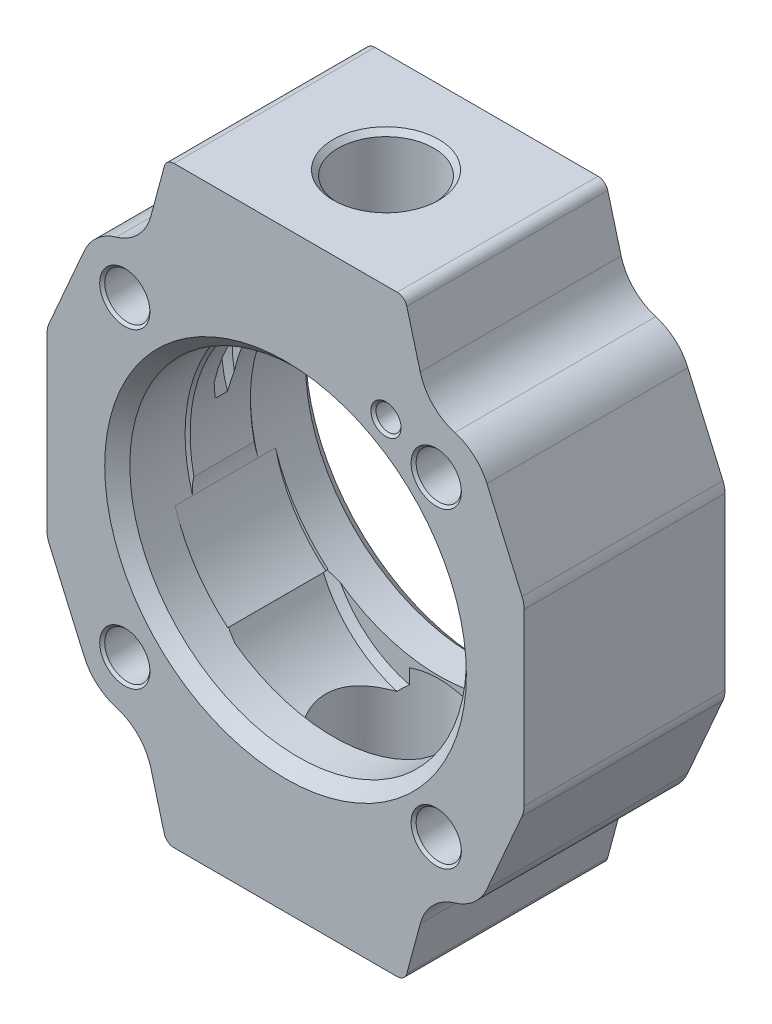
ISO-10303-21;
HEADER;
FILE_DESCRIPTION(('STEP AP214'),'2;1');
FILE_NAME('part.step','',(''),(''),'','','');
FILE_SCHEMA(('AUTOMOTIVE_DESIGN { 1 0 10303 214 1 1 1 1 }'));
ENDSEC;
DATA;
#1=APPLICATION_CONTEXT('core data for automotive mechanical design processes');
#2=APPLICATION_PROTOCOL_DEFINITION('international standard','automotive_design',2000,#1);
#3=PRODUCT_CONTEXT('',#1,'mechanical');
#4=PRODUCT('Part','Part','',(#3));
#5=PRODUCT_RELATED_PRODUCT_CATEGORY('part','',(#4));
#6=PRODUCT_DEFINITION_FORMATION('','',#4);
#7=PRODUCT_DEFINITION_CONTEXT('part definition',#1,'design');
#8=PRODUCT_DEFINITION('design','',#6,#7);
#9=PRODUCT_DEFINITION_SHAPE('','',#8);
#10=(LENGTH_UNIT() NAMED_UNIT(*) SI_UNIT(.MILLI.,.METRE.));
#11=(NAMED_UNIT(*) PLANE_ANGLE_UNIT() SI_UNIT($,.RADIAN.));
#12=(NAMED_UNIT(*) SI_UNIT($,.STERADIAN.) SOLID_ANGLE_UNIT());
#13=UNCERTAINTY_MEASURE_WITH_UNIT(LENGTH_MEASURE(1.E-05),#10,'distance_accuracy_value','');
#14=(GEOMETRIC_REPRESENTATION_CONTEXT(3) GLOBAL_UNCERTAINTY_ASSIGNED_CONTEXT((#13)) GLOBAL_UNIT_ASSIGNED_CONTEXT((#10,
#11,#12)) REPRESENTATION_CONTEXT('',''));
#15=CARTESIAN_POINT('',(0.,0.,0.));
#16=DIRECTION('',(0.,0.,1.));
#17=DIRECTION('',(1.,0.,0.));
#18=AXIS2_PLACEMENT_3D('',#15,#16,#17);
#19=CARTESIAN_POINT('',(0.,0.,-6.5));
#20=DIRECTION('',(0.,0.,1.));
#21=DIRECTION('',(1.,0.,0.));
#22=AXIS2_PLACEMENT_3D('',#19,#20,#21);
#23=CYLINDRICAL_SURFACE('',#22,33.);
#24=CARTESIAN_POINT('',(0.,0.,-2.));
#25=DIRECTION('',(0.,0.,-1.));
#26=DIRECTION('',(-1.,0.,0.));
#27=AXIS2_PLACEMENT_3D('',#24,#25,#26);
#28=CIRCLE('',#27,33.);
#29=CARTESIAN_POINT('',(-32.2034206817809,7.20692003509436,-2.));
#30=VERTEX_POINT('',#29);
#31=CARTESIAN_POINT('',(9.86901527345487,31.4897211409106,-2.));
#32=VERTEX_POINT('',#31);
#33=EDGE_CURVE('E1162',#30,#32,#28,.T.);
#34=ORIENTED_EDGE('',*,*,#33,.F.);
#35=CARTESIAN_POINT('',(-32.2034206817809,7.20692003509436,-2.));
#36=CARTESIAN_POINT('',(-32.2660571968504,6.92703737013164,-1.93528514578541));
#37=CARTESIAN_POINT('',(-32.3250165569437,6.64646016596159,-1.87001823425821));
#38=CARTESIAN_POINT('',(-32.4355293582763,6.08427794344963,-1.73851163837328));
#39=CARTESIAN_POINT('',(-32.4870876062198,5.80267371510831,-1.67227261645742));
#40=CARTESIAN_POINT('',(-32.5828281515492,5.23843416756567,-1.53886873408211));
#41=CARTESIAN_POINT('',(-32.6270104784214,4.9557988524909,-1.47170387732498));
#42=CARTESIAN_POINT('',(-32.7080154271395,4.38948819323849,-1.33648665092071));
#43=CARTESIAN_POINT('',(-32.7448332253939,4.10581229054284,-1.26843373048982));
#44=CARTESIAN_POINT('',(-32.7779479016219,3.82179687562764,-1.2));
#45=B_SPLINE_CURVE_WITH_KNOTS('',3,(#35,#36,#37,#38,#39,#40,#41,#42,#43,#44),.UNSPECIFIED.,.F.,
.F.,(4,2,2,2,4),(0.,0.882023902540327,1.7634723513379,2.64491727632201,3.52693764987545),.UNSPECIFIED.);
#46=CARTESIAN_POINT('',(-32.7779479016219,3.82179687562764,-1.19999999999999));
#47=VERTEX_POINT('',#46);
#48=EDGE_CURVE('E631',#30,#47,#45,.T.);
#49=ORIENTED_EDGE('',*,*,#48,.T.);
#50=DIRECTION('',(0.,0.,1.));
#51=VECTOR('',#50,1.);
#52=CARTESIAN_POINT('',(-32.7779479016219,3.82179687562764,0.));
#53=LINE('',#52,#51);
#54=CARTESIAN_POINT('',(-32.7779479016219,3.82179687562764,1.20000000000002));
#55=VERTEX_POINT('',#54);
#56=EDGE_CURVE('E1159',#55,#47,#53,.F.);
#57=ORIENTED_EDGE('',*,*,#56,.F.);
#58=CARTESIAN_POINT('',(-32.7779479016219,3.82179687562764,1.20000000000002));
#59=CARTESIAN_POINT('',(-32.7448332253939,4.10581229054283,1.26843373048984));
#60=CARTESIAN_POINT('',(-32.7080154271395,4.38948819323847,1.33648665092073));
#61=CARTESIAN_POINT('',(-32.6270104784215,4.95579885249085,1.471703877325));
#62=CARTESIAN_POINT('',(-32.5828281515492,5.23843416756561,1.53886873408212));
#63=CARTESIAN_POINT('',(-32.4870876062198,5.80267371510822,1.67227261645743));
#64=CARTESIAN_POINT('',(-32.4355293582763,6.08427794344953,1.73851163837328));
#65=CARTESIAN_POINT('',(-32.3250165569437,6.64646016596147,1.87001823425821));
#66=CARTESIAN_POINT('',(-32.2660571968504,6.92703737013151,1.93528514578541));
#67=CARTESIAN_POINT('',(-32.203420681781,7.20692003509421,2.));
#68=B_SPLINE_CURVE_WITH_KNOTS('',3,(#58,#59,#60,#61,#62,#63,#64,#65,#66,#67),.UNSPECIFIED.,.F.,
.F.,(4,2,2,2,4),(0.,0.882020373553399,1.76346529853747,2.64491374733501,3.5269376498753),.UNSPECIFIED.);
#69=CARTESIAN_POINT('',(-32.203420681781,7.20692003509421,2.));
#70=VERTEX_POINT('',#69);
#71=EDGE_CURVE('E604',#55,#70,#68,.T.);
#72=ORIENTED_EDGE('',*,*,#71,.T.);
#73=CARTESIAN_POINT('',(0.,0.,2.));
#74=DIRECTION('',(0.,0.,-1.));
#75=DIRECTION('',(-1.,0.,0.));
#76=AXIS2_PLACEMENT_3D('',#73,#74,#75);
#77=CIRCLE('',#76,33.);
#78=CARTESIAN_POINT('',(9.86901527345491,31.4897211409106,2.));
#79=VERTEX_POINT('',#78);
#80=EDGE_CURVE('E1154',#70,#79,#77,.T.);
#81=ORIENTED_EDGE('',*,*,#80,.T.);
#82=CARTESIAN_POINT('',(9.86901527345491,31.4897211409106,2.));
#83=CARTESIAN_POINT('',(10.0637565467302,31.4286884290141,1.93426315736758));
#84=CARTESIAN_POINT('',(10.2578499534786,31.3658747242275,1.8682613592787));
#85=CARTESIAN_POINT('',(10.6446294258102,31.2367318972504,1.73579389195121));
#86=CARTESIAN_POINT('',(10.837315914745,31.170403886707,1.66932837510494));
#87=CARTESIAN_POINT('',(11.2212921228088,31.0342407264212,1.53595823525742));
#88=CARTESIAN_POINT('',(11.4125818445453,30.9644055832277,1.46905361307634));
#89=CARTESIAN_POINT('',(11.7937739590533,30.8212323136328,1.33482549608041));
#90=CARTESIAN_POINT('',(11.9836758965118,30.7478930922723,1.26750187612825));
#91=CARTESIAN_POINT('',(12.1728282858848,30.6728259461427,1.2));
#92=B_SPLINE_CURVE_WITH_KNOTS('',3,(#82,#83,#84,#85,#86,#87,#88,#89,#90,#91),.UNSPECIFIED.,.F.,
.F.,(4,2,2,2,4),(0.,0.643213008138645,1.28622375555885,1.9292333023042,2.57244510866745),.UNSPECIFIED.);
#93=CARTESIAN_POINT('',(12.1728282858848,30.6728259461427,1.2));
#94=VERTEX_POINT('',#93);
#95=EDGE_CURVE('E561',#79,#94,#92,.T.);
#96=ORIENTED_EDGE('',*,*,#95,.T.);
#97=DIRECTION('',(0.,0.,1.));
#98=VECTOR('',#97,1.);
#99=CARTESIAN_POINT('',(12.1728282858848,30.6728259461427,0.));
#100=LINE('',#99,#98);
#101=CARTESIAN_POINT('',(12.1728282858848,30.6728259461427,-1.19999999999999));
#102=VERTEX_POINT('',#101);
#103=EDGE_CURVE('E1157',#102,#94,#100,.T.);
#104=ORIENTED_EDGE('',*,*,#103,.F.);
#105=CARTESIAN_POINT('',(12.1728282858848,30.6728259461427,-1.19999999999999));
#106=CARTESIAN_POINT('',(11.9836758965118,30.7478930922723,-1.26750187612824));
#107=CARTESIAN_POINT('',(11.7937739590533,30.8212323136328,-1.33482549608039));
#108=CARTESIAN_POINT('',(11.4125818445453,30.9644055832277,-1.46905361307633));
#109=CARTESIAN_POINT('',(11.2212921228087,31.0342407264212,-1.53595823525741));
#110=CARTESIAN_POINT('',(10.8373159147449,31.170403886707,-1.66932837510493));
#111=CARTESIAN_POINT('',(10.6446294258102,31.2367318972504,-1.73579389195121));
#112=CARTESIAN_POINT('',(10.2578499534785,31.3658747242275,-1.8682613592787));
#113=CARTESIAN_POINT('',(10.0637565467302,31.4286884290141,-1.93426315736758));
#114=CARTESIAN_POINT('',(9.86901527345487,31.4897211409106,-2.));
#115=B_SPLINE_CURVE_WITH_KNOTS('',3,(#105,#106,#107,#108,#109,#110,#111,#112,#113,#114),
.UNSPECIFIED.,.F.,.F.,(4,2,2,2,4),(0.,0.643211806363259,1.28622135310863,1.92923210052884,
2.5724451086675),.UNSPECIFIED.);
#116=EDGE_CURVE('E668',#102,#32,#115,.T.);
#117=ORIENTED_EDGE('',*,*,#116,.T.);
#118=EDGE_LOOP('',(#34,#49,#57,#72,#81,#96,#104,#117));
#119=FACE_BOUND('',#118,.T.);
#120=DIRECTION('',(0.,0.,1.));
#121=VECTOR('',#120,1.);
#122=CARTESIAN_POINT('',(-32.2486240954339,-7.00187431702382,-6.5));
#123=LINE('',#122,#121);
#124=CARTESIAN_POINT('',(-32.2486240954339,-7.00187431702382,-5.99999999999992));
#125=VERTEX_POINT('',#124);
#126=CARTESIAN_POINT('',(-32.2486240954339,-7.00187431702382,6.00000000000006));
#127=VERTEX_POINT('',#126);
#128=EDGE_CURVE('E922',#125,#127,#123,.T.);
#129=ORIENTED_EDGE('',*,*,#128,.F.);
#130=CARTESIAN_POINT('',(0.,0.,-5.99999999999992));
#131=DIRECTION('',(0.,0.,1.));
#132=DIRECTION('',(1.,0.,0.));
#133=AXIS2_PLACEMENT_3D('',#130,#131,#132);
#134=CIRCLE('',#133,33.);
#135=CARTESIAN_POINT('',(29.8990322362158,13.9659540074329,-5.99999999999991));
#136=VERTEX_POINT('',#135);
#137=EDGE_CURVE('E875',#125,#136,#134,.F.);
#138=ORIENTED_EDGE('',*,*,#137,.T.);
#139=DIRECTION('',(0.,0.,-1.));
#140=VECTOR('',#139,1.);
#141=CARTESIAN_POINT('',(29.8990322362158,13.9659540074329,0.));
#142=LINE('',#141,#140);
#143=CARTESIAN_POINT('',(29.8990322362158,13.9659540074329,6.00000000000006));
#144=VERTEX_POINT('',#143);
#145=EDGE_CURVE('E500',#136,#144,#142,.F.);
#146=ORIENTED_EDGE('',*,*,#145,.T.);
#147=CARTESIAN_POINT('',(0.,0.,6.00000000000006));
#148=DIRECTION('',(0.,0.,1.));
#149=DIRECTION('',(1.,0.,0.));
#150=AXIS2_PLACEMENT_3D('',#147,#148,#149);
#151=CIRCLE('',#150,33.);
#152=EDGE_CURVE('E65',#144,#127,#151,.T.);
#153=ORIENTED_EDGE('',*,*,#152,.T.);
#154=EDGE_LOOP('',(#129,#138,#146,#153));
#155=FACE_BOUND('',#154,.T.);
#156=ADVANCED_FACE('F49',(#119,#155),#23,.F.);
#157=DIRECTION('',(0.,0.,-1.));
#158=VECTOR('',#157,1.);
#159=CARTESIAN_POINT('',(29.4138391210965,-14.960817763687,0.));
#160=LINE('',#159,#158);
#161=CARTESIAN_POINT('',(29.4138391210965,-14.960817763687,6.00000000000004));
#162=VERTEX_POINT('',#161);
#163=CARTESIAN_POINT('',(29.4138391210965,-14.960817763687,-5.99999999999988));
#164=VERTEX_POINT('',#163);
#165=EDGE_CURVE('E497',#162,#164,#160,.T.);
#166=ORIENTED_EDGE('',*,*,#165,.T.);
#167=CARTESIAN_POINT('',(0.,0.,-5.99999999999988));
#168=DIRECTION('',(0.,0.,1.));
#169=DIRECTION('',(1.,0.,0.));
#170=AXIS2_PLACEMENT_3D('',#167,#168,#169);
#171=CIRCLE('',#170,33.);
#172=CARTESIAN_POINT('',(20.8428970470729,-25.5846368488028,-5.99999999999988));
#173=VERTEX_POINT('',#172);
#174=EDGE_CURVE('E735',#164,#173,#171,.F.);
#175=ORIENTED_EDGE('',*,*,#174,.T.);
#176=DIRECTION('',(0.,0.,1.));
#177=VECTOR('',#176,1.);
#178=CARTESIAN_POINT('',(20.8428970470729,-25.5846368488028,-6.5));
#179=LINE('',#178,#177);
#180=CARTESIAN_POINT('',(20.8428970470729,-25.5846368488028,6.00000000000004));
#181=VERTEX_POINT('',#180);
#182=EDGE_CURVE('E895',#173,#181,#179,.T.);
#183=ORIENTED_EDGE('',*,*,#182,.T.);
#184=CARTESIAN_POINT('',(0.,0.,6.00000000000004));
#185=DIRECTION('',(0.,0.,1.));
#186=DIRECTION('',(1.,0.,0.));
#187=AXIS2_PLACEMENT_3D('',#184,#185,#186);
#188=CIRCLE('',#187,33.);
#189=EDGE_CURVE('E733',#181,#162,#188,.T.);
#190=ORIENTED_EDGE('',*,*,#189,.T.);
#191=EDGE_LOOP('',(#166,#175,#183,#190));
#192=FACE_BOUND('',#191,.T.);
#193=ADVANCED_FACE('F619',(#192),#23,.F.);
#194=CARTESIAN_POINT('',(-6.28304188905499,18.5552818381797,-2.));
#195=DIRECTION('',(0.,0.,1.));
#196=DIRECTION('',(1.,0.,0.));
#197=AXIS2_PLACEMENT_3D('',#194,#195,#196);
#198=CYLINDRICAL_SURFACE('',#197,22.0783608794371);
#199=DIRECTION('',(0.,0.,1.));
#200=VECTOR('',#199,1.);
#201=CARTESIAN_POINT('',(-24.5668933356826,30.9308543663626,-2.));
#202=LINE('',#201,#200);
#203=CARTESIAN_POINT('',(-24.5668933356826,30.9308543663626,-1.19999999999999));
#204=VERTEX_POINT('',#203);
#205=CARTESIAN_POINT('',(-24.5668933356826,30.9308543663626,1.20000000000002));
#206=VERTEX_POINT('',#205);
#207=EDGE_CURVE('E925',#204,#206,#202,.T.);
#208=ORIENTED_EDGE('',*,*,#207,.F.);
#209=CARTESIAN_POINT('',(-6.28304188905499,18.5552818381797,-1.19999999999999));
#210=DIRECTION('',(0.,0.,-1.));
#211=DIRECTION('',(-1.,0.,0.));
#212=AXIS2_PLACEMENT_3D('',#209,#210,#211);
#213=CIRCLE('',#212,22.0783608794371);
#214=CARTESIAN_POINT('',(-9.42390577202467,40.4090914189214,-1.19999999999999));
#215=VERTEX_POINT('',#214);
#216=EDGE_CURVE('E1462',#204,#215,#213,.T.);
#217=ORIENTED_EDGE('',*,*,#216,.T.);
#218=CARTESIAN_POINT('',(-9.28708781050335,40.4283183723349,2.));
#219=CARTESIAN_POINT('',(-9.3433069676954,40.4205605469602,1.7390955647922));
#220=CARTESIAN_POINT('',(-9.38847986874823,40.4141706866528,1.47576528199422));
#221=CARTESIAN_POINT('',(-9.45654198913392,40.4044130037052,0.946042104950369));
#222=CARTESIAN_POINT('',(-9.47941930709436,40.4010467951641,0.679647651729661));
#223=CARTESIAN_POINT('',(-9.50243343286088,40.3976616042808,0.150585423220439));
#224=CARTESIAN_POINT('',(-9.50296506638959,40.3975845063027,-0.112064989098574));
#225=CARTESIAN_POINT('',(-9.4822890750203,40.400624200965,-0.636350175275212));
#226=CARTESIAN_POINT('',(-9.46109553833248,40.4037389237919,-0.8979854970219));
#227=CARTESIAN_POINT('',(-9.41181980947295,40.4108315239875,-1.29916646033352));
#228=CARTESIAN_POINT('',(-9.39134738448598,40.4137594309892,-1.43970670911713));
#229=CARTESIAN_POINT('',(-9.34401430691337,40.4204372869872,-1.72039182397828));
#230=CARTESIAN_POINT('',(-9.31712304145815,40.4241911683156,-1.86053143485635));
#231=CARTESIAN_POINT('',(-9.28708781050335,40.4283183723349,-2.));
#232=B_SPLINE_CURVE_WITH_KNOTS('',3,(#218,#219,#220,#221,#222,#223,#224,#225,#226,#227,#228,
#229,#230,#231),.UNSPECIFIED.,.F.,.F.,(4,2,2,2,2,2,4),(0.,0.800787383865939,1.60200199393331,
2.38905388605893,3.17559571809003,3.6016286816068,4.02973558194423),.UNSPECIFIED.);
#233=CARTESIAN_POINT('',(-9.42390577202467,40.4090914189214,1.20000000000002));
#234=VERTEX_POINT('',#233);
#235=EDGE_CURVE('E1431',#234,#215,#232,.T.);
#236=ORIENTED_EDGE('',*,*,#235,.F.);
#237=CARTESIAN_POINT('',(-6.28304188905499,18.5552818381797,1.20000000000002));
#238=DIRECTION('',(0.,0.,-1.));
#239=DIRECTION('',(-1.,0.,0.));
#240=AXIS2_PLACEMENT_3D('',#237,#238,#239);
#241=CIRCLE('',#240,22.0783608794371);
#242=EDGE_CURVE('E1490',#234,#206,#241,.F.);
#243=ORIENTED_EDGE('',*,*,#242,.T.);
#244=EDGE_LOOP('',(#208,#217,#236,#243));
#245=FACE_BOUND('',#244,.T.);
#246=ADVANCED_FACE('F522',(#245),#198,.F.);
#247=CARTESIAN_POINT('',(5.78248310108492,37.0452014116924,-2.4002));
#248=CARTESIAN_POINT('',(5.81080251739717,37.0267181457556,-2.2315784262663));
#249=CARTESIAN_POINT('',(5.83623101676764,37.010035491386,-2.06226779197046));
#250=CARTESIAN_POINT('',(5.88117559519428,36.9804437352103,-1.72252082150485));
#251=CARTESIAN_POINT('',(5.90069113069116,36.9675349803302,-1.55208438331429));
#252=CARTESIAN_POINT('',(5.93368212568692,36.9456613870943,-1.21028451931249));
#253=CARTESIAN_POINT('',(5.94715458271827,36.9366985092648,-1.03892067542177));
#254=CARTESIAN_POINT('',(5.96795492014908,36.9228413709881,-0.695673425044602));
#255=CARTESIAN_POINT('',(5.97528305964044,36.9179469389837,-0.523790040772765));
#256=CARTESIAN_POINT('',(5.9878176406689,36.9095787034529,-0.0134524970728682));
#257=CARTESIAN_POINT('',(5.98412269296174,36.9120535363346,0.325377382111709));
#258=CARTESIAN_POINT('',(5.95280287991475,36.932943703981,1.00118895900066));
#259=CARTESIAN_POINT('',(5.92519472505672,36.95134790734,1.3381717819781));
#260=CARTESIAN_POINT('',(5.87181232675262,36.9866085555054,1.79469892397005));
#261=CARTESIAN_POINT('',(5.8560732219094,36.9969825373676,1.91600925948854));
#262=CARTESIAN_POINT('',(5.82154958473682,37.0196615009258,2.1583934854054));
#263=CARTESIAN_POINT('',(5.80275596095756,37.0319722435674,2.27946554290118));
#264=CARTESIAN_POINT('',(5.78248310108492,37.0452014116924,2.4002));
#265=B_SPLINE_CURVE_WITH_KNOTS('',3,(#247,#248,#249,#250,#251,#252,#253,#254,#255,#256,#257,
#258,#259,#260,#261,#262,#263,#264),.UNSPECIFIED.,.F.,.F.,(4,2,2,2,2,2,2,2,4),(0.,
0.515911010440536,1.03186943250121,1.54808392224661,2.06427664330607,3.0795404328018,
4.0940953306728,4.462354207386,4.83172994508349),.UNSPECIFIED.);
#266=CARTESIAN_POINT('',(5.93352645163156,36.9457542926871,-1.19999999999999));
#267=VERTEX_POINT('',#266);
#268=CARTESIAN_POINT('',(5.93352645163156,36.9457542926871,1.2));
#269=VERTEX_POINT('',#268);
#270=EDGE_CURVE('E506',#267,#269,#265,.T.);
#271=ORIENTED_EDGE('',*,*,#270,.F.);
#272=CARTESIAN_POINT('',(-6.28304188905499,18.5552818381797,-1.19999999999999));
#273=DIRECTION('',(0.,0.,-1.));
#274=DIRECTION('',(-1.,0.,0.));
#275=AXIS2_PLACEMENT_3D('',#272,#273,#274);
#276=CIRCLE('',#275,22.0783608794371);
#277=EDGE_CURVE('E640',#267,#102,#276,.T.);
#278=ORIENTED_EDGE('',*,*,#277,.T.);
#279=ORIENTED_EDGE('',*,*,#103,.T.);
#280=CARTESIAN_POINT('',(-6.28304188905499,18.5552818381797,1.2));
#281=DIRECTION('',(0.,0.,-1.));
#282=DIRECTION('',(-1.,0.,0.));
#283=AXIS2_PLACEMENT_3D('',#280,#281,#282);
#284=CIRCLE('',#283,22.0783608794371);
#285=EDGE_CURVE('E1499',#94,#269,#284,.F.);
#286=ORIENTED_EDGE('',*,*,#285,.T.);
#287=EDGE_LOOP('',(#271,#278,#279,#286));
#288=FACE_BOUND('',#287,.T.);
#289=ADVANCED_FACE('F1469',(#288),#198,.F.);
#290=CARTESIAN_POINT('',(-9.09029462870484,11.4451011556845,-2.));
#291=DIRECTION('',(0.,0.,-1.));
#292=DIRECTION('',(-1.,0.,0.));
#293=AXIS2_PLACEMENT_3D('',#290,#291,#292);
#294=PLANE('',#293);
#295=CARTESIAN_POINT('',(-6.28304188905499,18.5552818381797,-2.));
#296=DIRECTION('',(0.,0.,-1.));
#297=DIRECTION('',(-1.,0.,0.));
#298=AXIS2_PLACEMENT_3D('',#295,#296,#297);
#299=CIRCLE('',#298,20.692720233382);
#300=CARTESIAN_POINT('',(-9.28708781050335,39.0287861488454,-2.));
#301=VERTEX_POINT('',#300);
#302=CARTESIAN_POINT('',(-23.5375494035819,29.9776564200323,-2.));
#303=VERTEX_POINT('',#302);
#304=EDGE_CURVE('E1456',#301,#303,#299,.F.);
#305=ORIENTED_EDGE('',*,*,#304,.T.);
#306=CARTESIAN_POINT('',(-9.09029462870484,11.4451011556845,-2.));
#307=DIRECTION('',(0.,0.,-1.));
#308=DIRECTION('',(-1.,0.,0.));
#309=AXIS2_PLACEMENT_3D('',#306,#307,#308);
#310=CIRCLE('',#309,23.4984845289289);
#311=EDGE_CURVE('E1457',#303,#30,#310,.F.);
#312=ORIENTED_EDGE('',*,*,#311,.T.);
#313=ORIENTED_EDGE('',*,*,#33,.T.);
#314=CARTESIAN_POINT('',(-6.28304188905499,18.5552818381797,-2.));
#315=DIRECTION('',(0.,0.,-1.));
#316=DIRECTION('',(-1.,0.,0.));
#317=AXIS2_PLACEMENT_3D('',#314,#315,#316);
#318=CIRCLE('',#317,20.692720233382);
#319=CARTESIAN_POINT('',(4.31999446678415,36.3250395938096,-2.));
#320=VERTEX_POINT('',#319);
#321=EDGE_CURVE('E609',#32,#320,#318,.F.);
#322=ORIENTED_EDGE('',*,*,#321,.T.);
#323=CARTESIAN_POINT('',(-29.0397394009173,48.0120939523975,-2.));
#324=CARTESIAN_POINT('',(-28.267546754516,47.6423177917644,-2.));
#325=CARTESIAN_POINT('',(-27.4953276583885,47.2725968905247,-2.));
#326=CARTESIAN_POINT('',(-25.950819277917,46.5333013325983,-2.));
#327=CARTESIAN_POINT('',(-25.1785299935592,46.1637266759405,-2.));
#328=CARTESIAN_POINT('',(-22.8613729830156,45.0552001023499,-2.));
#329=CARTESIAN_POINT('',(-21.3163744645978,44.316521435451,-2.));
#330=CARTESIAN_POINT('',(-19.0250079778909,43.2222564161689,-2.));
#331=CARTESIAN_POINT('',(-18.2788932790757,42.866139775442,-2.));
#332=CARTESIAN_POINT('',(-16.7864399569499,42.1543760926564,-2.));
#333=CARTESIAN_POINT('',(-16.0401013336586,41.798729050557,-2.));
#334=CARTESIAN_POINT('',(-14.5471627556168,41.0881679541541,-2.));
#335=CARTESIAN_POINT('',(-13.8005628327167,40.7332538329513,-2.));
#336=CARTESIAN_POINT('',(-12.3068392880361,40.0245307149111,-2.));
#337=CARTESIAN_POINT('',(-11.5597156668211,39.6707217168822,-2.));
#338=CARTESIAN_POINT('',(-10.2425002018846,39.0490021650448,-2.));
#339=CARTESIAN_POINT('',(-9.67259796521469,38.7806903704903,-2.));
#340=CARTESIAN_POINT('',(-8.81702646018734,38.3795894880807,-2.));
#341=CARTESIAN_POINT('',(-8.53168458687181,38.2461022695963,-2.));
#342=CARTESIAN_POINT('',(-7.96070945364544,37.979754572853,-2.));
#343=CARTESIAN_POINT('',(-7.67507619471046,37.8468940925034,-2.));
#344=CARTESIAN_POINT('',(-7.09818713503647,37.5796044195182,-2.));
#345=CARTESIAN_POINT('',(-6.80692403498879,37.4451909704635,-2.));
#346=CARTESIAN_POINT('',(-6.22382077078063,37.1776212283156,-2.));
#347=CARTESIAN_POINT('',(-5.93198060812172,37.0444649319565,-2.));
#348=CARTESIAN_POINT('',(-5.34763533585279,36.7801091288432,-2.));
#349=CARTESIAN_POINT('',(-5.05513075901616,36.6489084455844,-2.));
#350=CARTESIAN_POINT('',(-4.46883347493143,36.3894217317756,-2.));
#351=CARTESIAN_POINT('',(-4.17504080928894,36.2611356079,-2.));
#352=CARTESIAN_POINT('',(-3.74503325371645,36.0776847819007,-2.));
#353=CARTESIAN_POINT('',(-3.60965990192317,36.0205507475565,-2.));
#354=CARTESIAN_POINT('',(-3.338333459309,35.9076787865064,-2.));
#355=CARTESIAN_POINT('',(-3.20238037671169,35.8519408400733,-2.));
#356=CARTESIAN_POINT('',(-2.92946464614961,35.7422205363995,-2.));
#357=CARTESIAN_POINT('',(-2.79250057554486,35.6882416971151,-2.));
#358=CARTESIAN_POINT('',(-2.51759725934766,35.5828428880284,-2.));
#359=CARTESIAN_POINT('',(-2.37965805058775,35.5314228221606,-2.));
#360=CARTESIAN_POINT('',(-2.10601803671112,35.4334244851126,-2.));
#361=CARTESIAN_POINT('',(-1.97035039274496,35.3867559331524,-2.));
#362=CARTESIAN_POINT('',(-1.69747286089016,35.2982305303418,-2.));
#363=CARTESIAN_POINT('',(-1.56026259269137,35.2563748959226,-2.));
#364=CARTESIAN_POINT('',(-1.14637466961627,35.1412511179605,-2.));
#365=CARTESIAN_POINT('',(-0.866415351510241,35.0780283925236,-2.));
#366=CARTESIAN_POINT('',(-0.507352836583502,35.029792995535,-2.));
#367=CARTESIAN_POINT('',(-0.431381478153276,35.02141711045,-2.));
#368=CARTESIAN_POINT('',(-0.279101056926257,35.008634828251,-2.));
#369=CARTESIAN_POINT('',(-0.202792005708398,35.004228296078,-2.));
#370=CARTESIAN_POINT('',(-0.0500854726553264,34.9996046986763,-2.));
#371=CARTESIAN_POINT('',(0.0263119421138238,34.9993854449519,-2.));
#372=CARTESIAN_POINT('',(0.179003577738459,35.0031421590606,-2.));
#373=CARTESIAN_POINT('',(0.255297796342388,35.0071182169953,-2.));
#374=CARTESIAN_POINT('',(0.408354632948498,35.0191284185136,-2.));
#375=CARTESIAN_POINT('',(0.485113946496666,35.0272040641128,-2.));
#376=CARTESIAN_POINT('',(0.638153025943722,35.0470632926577,-2.));
#377=CARTESIAN_POINT('',(0.714432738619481,35.0588472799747,-2.));
#378=CARTESIAN_POINT('',(0.866499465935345,35.0856743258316,-2.));
#379=CARTESIAN_POINT('',(0.942285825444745,35.1007210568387,-2.));
#380=CARTESIAN_POINT('',(1.09324280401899,35.1335848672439,-2.));
#381=CARTESIAN_POINT('',(1.16841346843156,35.151401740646,-2.));
#382=CARTESIAN_POINT('',(1.38797156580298,35.2070335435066,-2.));
#383=CARTESIAN_POINT('',(1.53155710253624,35.2480073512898,-2.));
#384=CARTESIAN_POINT('',(1.81690190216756,35.3359267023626,-2.));
#385=CARTESIAN_POINT('',(1.95866041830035,35.382874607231,-2.));
#386=CARTESIAN_POINT('',(2.24091133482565,35.4809765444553,-2.));
#387=CARTESIAN_POINT('',(2.38140183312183,35.5321360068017,-2.));
#388=CARTESIAN_POINT('',(2.66125045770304,35.6373769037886,-2.));
#389=CARTESIAN_POINT('',(2.80060875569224,35.6914578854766,-2.));
#390=CARTESIAN_POINT('',(3.07890339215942,35.8019011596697,-2.));
#391=CARTESIAN_POINT('',(3.21783717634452,35.858269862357,-2.));
#392=CARTESIAN_POINT('',(3.49505601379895,35.9725834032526,-2.));
#393=CARTESIAN_POINT('',(3.63334105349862,36.0305282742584,-2.));
#394=CARTESIAN_POINT('',(4.04724151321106,36.2060339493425,-2.));
#395=CARTESIAN_POINT('',(4.32211132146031,36.3253502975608,-2.));
#396=CARTESIAN_POINT('',(4.87485224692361,36.5686486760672,-2.));
#397=CARTESIAN_POINT('',(5.15270402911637,36.6926743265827,-2.));
#398=CARTESIAN_POINT('',(5.70761617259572,36.9426192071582,-2.));
#399=CARTESIAN_POINT('',(5.98467637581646,37.0685387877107,-2.));
#400=CARTESIAN_POINT('',(6.53764718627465,37.3213818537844,-2.));
#401=CARTESIAN_POINT('',(6.81355898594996,37.4483027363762,-2.));
#402=CARTESIAN_POINT('',(7.36495298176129,37.7030308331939,-2.));
#403=CARTESIAN_POINT('',(7.64043520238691,37.8308379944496,-2.));
#404=CARTESIAN_POINT('',(8.36893008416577,38.1698573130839,-2.));
#405=CARTESIAN_POINT('',(8.82168515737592,38.3816226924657,-2.));
#406=CARTESIAN_POINT('',(9.7266745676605,38.8062637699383,-2.));
#407=CARTESIAN_POINT('',(10.1789089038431,39.0191394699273,-2.));
#408=CARTESIAN_POINT('',(11.535114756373,39.6588795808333,-2.));
#409=CARTESIAN_POINT('',(12.4385661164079,40.0868462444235,-2.));
#410=CARTESIAN_POINT('',(14.2455732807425,40.944646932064,-2.));
#411=CARTESIAN_POINT('',(15.1491284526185,41.3744822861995,-2.));
#412=CARTESIAN_POINT('',(16.9558092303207,42.2350349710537,-2.));
#413=CARTESIAN_POINT('',(17.8589348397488,42.6657522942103,-2.));
#414=CARTESIAN_POINT('',(19.6191119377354,43.5058797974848,-2.));
#415=CARTESIAN_POINT('',(20.4761765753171,43.915262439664,-2.));
#416=CARTESIAN_POINT('',(22.1901429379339,44.7343747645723,-2.));
#417=CARTESIAN_POINT('',(23.0470446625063,45.1441044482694,-2.));
#418=CARTESIAN_POINT('',(24.7599623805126,45.9634417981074,-2.));
#419=CARTESIAN_POINT('',(25.6159784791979,46.3730492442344,-2.));
#420=CARTESIAN_POINT('',(27.3279195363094,47.1924482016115,-2.));
#421=CARTESIAN_POINT('',(28.1838444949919,47.6022397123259,-2.));
#422=CARTESIAN_POINT('',(29.0397394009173,48.0120939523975,-2.));
#423=B_SPLINE_CURVE_WITH_KNOTS('',3,(#323,#324,#325,#326,#327,#328,#329,#330,#331,#332,#333,
#334,#335,#336,#337,#338,#339,#340,#341,#342,#343,#344,#345,#346,#347,#348,#349,#350,#351,#352,
#353,#354,#355,#356,#357,#358,#359,#360,#361,#362,#363,#364,#365,#366,#367,#368,#369,#370,#371,
#372,#373,#374,#375,#376,#377,#378,#379,#380,#381,#382,#383,#384,#385,#386,#387,#388,#389,#390,
#391,#392,#393,#394,#395,#396,#397,#398,#399,#400,#401,#402,#403,#404,#405,#406,#407,#408,#409,
#410,#411,#412,#413,#414,#415,#416,#417,#418,#419,#420,#421,#422),.UNSPECIFIED.,.F.,.F.,(4,2,2,
2,2,2,2,2,2,2,2,2,2,2,2,2,2,2,2,2,2,2,2,2,2,2,2,2,2,2,2,2,2,2,2,2,2,2,2,2,2,2,2,2,2,2,2,2,2,4),
(0.,2.56849039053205,5.13698128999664,10.2744898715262,12.7547227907,15.2349554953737,
17.7149508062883,20.1949434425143,22.0846547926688,23.0297200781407,23.9747822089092,
24.9371267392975,25.8994687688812,26.8612063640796,27.8229131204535,28.2637158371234,
28.7045123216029,29.1461420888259,29.5877552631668,30.0180572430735,30.4484677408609,
31.3059955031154,31.5351997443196,31.7643961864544,31.9934728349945,32.2225544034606,
32.4540027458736,32.6854763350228,32.9172118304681,33.1489301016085,33.5966649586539,
34.0445773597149,34.4930765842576,34.9415064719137,35.3912937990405,35.8410904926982,
36.7400075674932,37.6528281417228,38.5658197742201,39.4769303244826,40.3879868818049,
41.8874792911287,43.3869742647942,46.3860403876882,49.3877950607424,52.3895241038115,
55.2389775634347,58.0884389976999,60.9353454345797,63.7822436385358),.UNSPECIFIED.);
#424=CARTESIAN_POINT('',(-9.28708781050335,38.6,-2.));
#425=VERTEX_POINT('',#424);
#426=EDGE_CURVE('E515',#425,#320,#423,.T.);
#427=ORIENTED_EDGE('',*,*,#426,.F.);
#428=DIRECTION('',(0.,-1.,0.));
#429=VECTOR('',#428,1.);
#430=CARTESIAN_POINT('',(-9.28708781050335,0.,-2.));
#431=LINE('',#430,#429);
#432=EDGE_CURVE('E1429',#301,#425,#431,.T.);
#433=ORIENTED_EDGE('',*,*,#432,.F.);
#434=EDGE_LOOP('',(#305,#312,#313,#322,#427,#433));
#435=FACE_BOUND('',#434,.T.);
#436=ADVANCED_FACE('F1449',(#435),#294,.F.);
#437=CARTESIAN_POINT('',(-9.09029462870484,11.4451011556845,2.));
#438=DIRECTION('',(0.,0.,-1.));
#439=DIRECTION('',(-1.,0.,0.));
#440=AXIS2_PLACEMENT_3D('',#437,#438,#439);
#441=PLANE('',#440);
#442=CARTESIAN_POINT('',(-29.0397394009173,48.0120939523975,2.));
#443=CARTESIAN_POINT('',(-28.267546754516,47.6423177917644,2.));
#444=CARTESIAN_POINT('',(-27.4953276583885,47.2725968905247,2.));
#445=CARTESIAN_POINT('',(-25.950819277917,46.5333013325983,2.));
#446=CARTESIAN_POINT('',(-25.1785299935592,46.1637266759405,2.));
#447=CARTESIAN_POINT('',(-22.8613729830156,45.0552001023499,2.));
#448=CARTESIAN_POINT('',(-21.3163744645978,44.316521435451,2.));
#449=CARTESIAN_POINT('',(-19.0250079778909,43.2222564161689,2.));
#450=CARTESIAN_POINT('',(-18.2788932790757,42.866139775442,2.));
#451=CARTESIAN_POINT('',(-16.7864399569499,42.1543760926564,2.));
#452=CARTESIAN_POINT('',(-16.0401013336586,41.798729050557,2.));
#453=CARTESIAN_POINT('',(-14.5471627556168,41.0881679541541,2.));
#454=CARTESIAN_POINT('',(-13.8005628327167,40.7332538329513,2.));
#455=CARTESIAN_POINT('',(-12.3068392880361,40.0245307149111,2.));
#456=CARTESIAN_POINT('',(-11.5597156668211,39.6707217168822,2.));
#457=CARTESIAN_POINT('',(-10.2425002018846,39.0490021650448,2.));
#458=CARTESIAN_POINT('',(-9.67259796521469,38.7806903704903,2.));
#459=CARTESIAN_POINT('',(-8.81702646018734,38.3795894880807,2.));
#460=CARTESIAN_POINT('',(-8.53168458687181,38.2461022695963,2.));
#461=CARTESIAN_POINT('',(-7.96070945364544,37.979754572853,2.));
#462=CARTESIAN_POINT('',(-7.67507619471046,37.8468940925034,2.));
#463=CARTESIAN_POINT('',(-7.09818713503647,37.5796044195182,2.));
#464=CARTESIAN_POINT('',(-6.80692403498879,37.4451909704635,2.));
#465=CARTESIAN_POINT('',(-6.22382077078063,37.1776212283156,2.));
#466=CARTESIAN_POINT('',(-5.93198060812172,37.0444649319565,2.));
#467=CARTESIAN_POINT('',(-5.34763533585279,36.7801091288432,2.));
#468=CARTESIAN_POINT('',(-5.05513075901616,36.6489084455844,2.));
#469=CARTESIAN_POINT('',(-4.46883347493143,36.3894217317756,2.));
#470=CARTESIAN_POINT('',(-4.17504080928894,36.2611356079,2.));
#471=CARTESIAN_POINT('',(-3.74503325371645,36.0776847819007,2.));
#472=CARTESIAN_POINT('',(-3.60965990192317,36.0205507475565,2.));
#473=CARTESIAN_POINT('',(-3.338333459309,35.9076787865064,2.));
#474=CARTESIAN_POINT('',(-3.20238037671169,35.8519408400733,2.));
#475=CARTESIAN_POINT('',(-2.92946464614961,35.7422205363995,2.));
#476=CARTESIAN_POINT('',(-2.79250057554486,35.6882416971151,2.));
#477=CARTESIAN_POINT('',(-2.51759725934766,35.5828428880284,2.));
#478=CARTESIAN_POINT('',(-2.37965805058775,35.5314228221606,2.));
#479=CARTESIAN_POINT('',(-2.10601803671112,35.4334244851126,2.));
#480=CARTESIAN_POINT('',(-1.97035039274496,35.3867559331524,2.));
#481=CARTESIAN_POINT('',(-1.69747286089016,35.2982305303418,2.));
#482=CARTESIAN_POINT('',(-1.56026259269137,35.2563748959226,2.));
#483=CARTESIAN_POINT('',(-1.14637466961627,35.1412511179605,2.));
#484=CARTESIAN_POINT('',(-0.866415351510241,35.0780283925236,2.));
#485=CARTESIAN_POINT('',(-0.507352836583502,35.029792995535,2.));
#486=CARTESIAN_POINT('',(-0.431381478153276,35.02141711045,2.));
#487=CARTESIAN_POINT('',(-0.279101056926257,35.008634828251,2.));
#488=CARTESIAN_POINT('',(-0.202792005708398,35.004228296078,2.));
#489=CARTESIAN_POINT('',(-0.0500854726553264,34.9996046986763,2.));
#490=CARTESIAN_POINT('',(0.0263119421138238,34.9993854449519,2.));
#491=CARTESIAN_POINT('',(0.179003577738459,35.0031421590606,2.));
#492=CARTESIAN_POINT('',(0.255297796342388,35.0071182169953,2.));
#493=CARTESIAN_POINT('',(0.408354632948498,35.0191284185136,2.));
#494=CARTESIAN_POINT('',(0.485113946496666,35.0272040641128,2.));
#495=CARTESIAN_POINT('',(0.638153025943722,35.0470632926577,2.));
#496=CARTESIAN_POINT('',(0.714432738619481,35.0588472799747,2.));
#497=CARTESIAN_POINT('',(0.866499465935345,35.0856743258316,2.));
#498=CARTESIAN_POINT('',(0.942285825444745,35.1007210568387,2.));
#499=CARTESIAN_POINT('',(1.09324280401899,35.1335848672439,2.));
#500=CARTESIAN_POINT('',(1.16841346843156,35.151401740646,2.));
#501=CARTESIAN_POINT('',(1.38797156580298,35.2070335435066,2.));
#502=CARTESIAN_POINT('',(1.53155710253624,35.2480073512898,2.));
#503=CARTESIAN_POINT('',(1.81690190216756,35.3359267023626,2.));
#504=CARTESIAN_POINT('',(1.95866041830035,35.382874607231,2.));
#505=CARTESIAN_POINT('',(2.24091133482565,35.4809765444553,2.));
#506=CARTESIAN_POINT('',(2.38140183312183,35.5321360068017,2.));
#507=CARTESIAN_POINT('',(2.66125045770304,35.6373769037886,2.));
#508=CARTESIAN_POINT('',(2.80060875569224,35.6914578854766,2.));
#509=CARTESIAN_POINT('',(3.07890339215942,35.8019011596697,2.));
#510=CARTESIAN_POINT('',(3.21783717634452,35.858269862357,2.));
#511=CARTESIAN_POINT('',(3.49505601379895,35.9725834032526,2.));
#512=CARTESIAN_POINT('',(3.63334105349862,36.0305282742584,2.));
#513=CARTESIAN_POINT('',(4.04724151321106,36.2060339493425,2.));
#514=CARTESIAN_POINT('',(4.32211132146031,36.3253502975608,2.));
#515=CARTESIAN_POINT('',(4.87485224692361,36.5686486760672,2.));
#516=CARTESIAN_POINT('',(5.15270402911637,36.6926743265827,2.));
#517=CARTESIAN_POINT('',(5.70761617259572,36.9426192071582,2.));
#518=CARTESIAN_POINT('',(5.98467637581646,37.0685387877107,2.));
#519=CARTESIAN_POINT('',(6.53764718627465,37.3213818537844,2.));
#520=CARTESIAN_POINT('',(6.81355898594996,37.4483027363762,2.));
#521=CARTESIAN_POINT('',(7.36495298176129,37.7030308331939,2.));
#522=CARTESIAN_POINT('',(7.64043520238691,37.8308379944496,2.));
#523=CARTESIAN_POINT('',(8.36893008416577,38.1698573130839,2.));
#524=CARTESIAN_POINT('',(8.82168515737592,38.3816226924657,2.));
#525=CARTESIAN_POINT('',(9.7266745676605,38.8062637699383,2.));
#526=CARTESIAN_POINT('',(10.1789089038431,39.0191394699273,2.));
#527=CARTESIAN_POINT('',(11.535114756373,39.6588795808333,2.));
#528=CARTESIAN_POINT('',(12.4385661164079,40.0868462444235,2.));
#529=CARTESIAN_POINT('',(14.2455732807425,40.944646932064,2.));
#530=CARTESIAN_POINT('',(15.1491284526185,41.3744822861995,2.));
#531=CARTESIAN_POINT('',(16.9558092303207,42.2350349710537,2.));
#532=CARTESIAN_POINT('',(17.8589348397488,42.6657522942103,2.));
#533=CARTESIAN_POINT('',(19.6191119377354,43.5058797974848,2.));
#534=CARTESIAN_POINT('',(20.4761765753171,43.915262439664,2.));
#535=CARTESIAN_POINT('',(22.1901429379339,44.7343747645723,2.));
#536=CARTESIAN_POINT('',(23.0470446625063,45.1441044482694,2.));
#537=CARTESIAN_POINT('',(24.7599623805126,45.9634417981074,2.));
#538=CARTESIAN_POINT('',(25.6159784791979,46.3730492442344,2.));
#539=CARTESIAN_POINT('',(27.3279195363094,47.1924482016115,2.));
#540=CARTESIAN_POINT('',(28.1838444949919,47.6022397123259,2.));
#541=CARTESIAN_POINT('',(29.0397394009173,48.0120939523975,2.));
#542=B_SPLINE_CURVE_WITH_KNOTS('',3,(#442,#443,#444,#445,#446,#447,#448,#449,#450,#451,#452,
#453,#454,#455,#456,#457,#458,#459,#460,#461,#462,#463,#464,#465,#466,#467,#468,#469,#470,#471,
#472,#473,#474,#475,#476,#477,#478,#479,#480,#481,#482,#483,#484,#485,#486,#487,#488,#489,#490,
#491,#492,#493,#494,#495,#496,#497,#498,#499,#500,#501,#502,#503,#504,#505,#506,#507,#508,#509,
#510,#511,#512,#513,#514,#515,#516,#517,#518,#519,#520,#521,#522,#523,#524,#525,#526,#527,#528,
#529,#530,#531,#532,#533,#534,#535,#536,#537,#538,#539,#540,#541),.UNSPECIFIED.,.F.,.F.,(4,2,2,
2,2,2,2,2,2,2,2,2,2,2,2,2,2,2,2,2,2,2,2,2,2,2,2,2,2,2,2,2,2,2,2,2,2,2,2,2,2,2,2,2,2,2,2,2,2,4),
(0.,2.56849039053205,5.13698128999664,10.2744898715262,12.7547227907,15.2349554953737,
17.7149508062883,20.1949434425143,22.0846547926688,23.0297200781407,23.9747822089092,
24.9371267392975,25.8994687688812,26.8612063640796,27.8229131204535,28.2637158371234,
28.7045123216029,29.1461420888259,29.5877552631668,30.0180572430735,30.4484677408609,
31.3059955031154,31.5351997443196,31.7643961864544,31.9934728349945,32.2225544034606,
32.4540027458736,32.6854763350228,32.9172118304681,33.1489301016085,33.5966649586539,
34.0445773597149,34.4930765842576,34.9415064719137,35.3912937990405,35.8410904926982,
36.7400075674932,37.6528281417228,38.5658197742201,39.4769303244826,40.3879868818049,
41.8874792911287,43.3869742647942,46.3860403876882,49.3877950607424,52.3895241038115,
55.2389775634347,58.0884389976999,60.9353454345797,63.7822436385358),.UNSPECIFIED.);
#543=CARTESIAN_POINT('',(-9.28708781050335,38.6,2.));
#544=VERTEX_POINT('',#543);
#545=CARTESIAN_POINT('',(4.31999446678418,36.3250395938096,2.));
#546=VERTEX_POINT('',#545);
#547=EDGE_CURVE('E542',#544,#546,#542,.T.);
#548=ORIENTED_EDGE('',*,*,#547,.T.);
#549=CARTESIAN_POINT('',(-6.28304188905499,18.5552818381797,2.));
#550=DIRECTION('',(0.,0.,-1.));
#551=DIRECTION('',(-1.,0.,0.));
#552=AXIS2_PLACEMENT_3D('',#549,#550,#551);
#553=CIRCLE('',#552,20.692720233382);
#554=EDGE_CURVE('E1491',#546,#79,#553,.T.);
#555=ORIENTED_EDGE('',*,*,#554,.T.);
#556=ORIENTED_EDGE('',*,*,#80,.F.);
#557=CARTESIAN_POINT('',(-9.09029462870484,11.4451011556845,2.));
#558=DIRECTION('',(0.,0.,-1.));
#559=DIRECTION('',(-1.,0.,0.));
#560=AXIS2_PLACEMENT_3D('',#557,#558,#559);
#561=CIRCLE('',#560,23.498484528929);
#562=CARTESIAN_POINT('',(-23.5375494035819,29.9776564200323,2.));
#563=VERTEX_POINT('',#562);
#564=EDGE_CURVE('E1497',#70,#563,#561,.T.);
#565=ORIENTED_EDGE('',*,*,#564,.T.);
#566=CARTESIAN_POINT('',(-6.28304188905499,18.5552818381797,2.));
#567=DIRECTION('',(0.,0.,-1.));
#568=DIRECTION('',(-1.,0.,0.));
#569=AXIS2_PLACEMENT_3D('',#566,#567,#568);
#570=CIRCLE('',#569,20.6927202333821);
#571=CARTESIAN_POINT('',(-9.28708781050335,39.0287861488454,2.));
#572=VERTEX_POINT('',#571);
#573=EDGE_CURVE('E1493',#563,#572,#570,.T.);
#574=ORIENTED_EDGE('',*,*,#573,.T.);
#575=DIRECTION('',(0.,-1.,0.));
#576=VECTOR('',#575,1.);
#577=CARTESIAN_POINT('',(-9.28708781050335,0.,2.));
#578=LINE('',#577,#576);
#579=EDGE_CURVE('E1500',#572,#544,#578,.T.);
#580=ORIENTED_EDGE('',*,*,#579,.T.);
#581=EDGE_LOOP('',(#548,#555,#556,#565,#574,#580));
#582=FACE_BOUND('',#581,.T.);
#583=ADVANCED_FACE('F1505',(#582),#441,.T.);
#584=CARTESIAN_POINT('',(-0.664241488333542,-17.2220664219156,-10.5));
#585=DIRECTION('',(0.,0.,1.));
#586=DIRECTION('',(1.,0.,0.));
#587=AXIS2_PLACEMENT_3D('',#584,#585,#586);
#588=CYLINDRICAL_SURFACE('',#587,23.1029666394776);
#589=CARTESIAN_POINT('',(-0.664241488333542,-17.2220664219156,-9.50000000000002));
#590=DIRECTION('',(0.,0.,1.));
#591=DIRECTION('',(1.,0.,0.));
#592=AXIS2_PLACEMENT_3D('',#589,#590,#591);
#593=CIRCLE('',#592,23.1029666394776);
#594=CARTESIAN_POINT('',(20.4939015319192,-26.5,-9.50000000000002));
#595=VERTEX_POINT('',#594);
#596=CARTESIAN_POINT('',(7.33143914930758,-38.8973094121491,-9.50000000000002));
#597=VERTEX_POINT('',#596);
#598=EDGE_CURVE('E1166',#595,#597,#593,.F.);
#599=ORIENTED_EDGE('',*,*,#598,.T.);
#600=CARTESIAN_POINT('',(7.33143914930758,-38.8973094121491,-9.50000000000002));
#601=CARTESIAN_POINT('',(7.60441732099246,-38.7966369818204,-9.28932193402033));
#602=CARTESIAN_POINT('',(7.86775599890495,-38.6936118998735,-9.06733403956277));
#603=CARTESIAN_POINT('',(8.37399285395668,-38.4854624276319,-8.60200647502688));
#604=CARTESIAN_POINT('',(8.61688929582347,-38.3803378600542,-8.35866499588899));
#605=CARTESIAN_POINT('',(9.08256318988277,-38.1699221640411,-7.85026423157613));
#606=CARTESIAN_POINT('',(9.30519747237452,-38.0646345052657,-7.58507236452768));
#607=CARTESIAN_POINT('',(9.72729691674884,-37.8574306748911,-7.03560331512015));
#608=CARTESIAN_POINT('',(9.92676228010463,-37.7555144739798,-6.7513262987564));
#609=CARTESIAN_POINT('',(10.3015627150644,-37.5578280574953,-6.16435673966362));
#610=CARTESIAN_POINT('',(10.4768481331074,-37.4620706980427,-5.86162809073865));
#611=CARTESIAN_POINT('',(10.8012873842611,-37.2800654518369,-5.23976591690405));
#612=CARTESIAN_POINT('',(10.9504450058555,-37.1938161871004,-4.92063477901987));
#613=CARTESIAN_POINT('',(11.2206597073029,-37.0342034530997,-4.2686044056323));
#614=CARTESIAN_POINT('',(11.3417914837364,-36.9608058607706,-3.93574462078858));
#615=CARTESIAN_POINT('',(11.5547835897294,-36.8296715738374,-3.25778371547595));
#616=CARTESIAN_POINT('',(11.6466484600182,-36.7719324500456,-2.91268450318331));
#617=CARTESIAN_POINT('',(11.7927966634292,-36.6790981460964,-2.2441959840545));
#618=CARTESIAN_POINT('',(11.8496888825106,-36.642449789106,-1.92159274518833));
#619=CARTESIAN_POINT('',(11.936968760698,-36.5859322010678,-1.27135544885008));
#620=CARTESIAN_POINT('',(11.9673582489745,-36.5660618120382,-0.94372174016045));
#621=CARTESIAN_POINT('',(12.0010865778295,-36.5439954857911,-0.286584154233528));
#622=CARTESIAN_POINT('',(12.0044349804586,-36.5417933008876,0.0429190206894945));
#623=CARTESIAN_POINT('',(11.9840418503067,-36.5551507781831,0.700706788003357));
#624=CARTESIAN_POINT('',(11.9603024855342,-36.5707090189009,1.02899147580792));
#625=CARTESIAN_POINT('',(11.8910771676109,-36.6156854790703,1.63813280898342));
#626=CARTESIAN_POINT('',(11.8488768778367,-36.6430021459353,1.91952785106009));
#627=CARTESIAN_POINT('',(11.7449271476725,-36.7095858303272,2.47733598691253));
#628=CARTESIAN_POINT('',(11.6831713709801,-36.7488567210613,2.75374743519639));
#629=CARTESIAN_POINT('',(11.5408194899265,-36.8381464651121,3.29986706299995));
#630=CARTESIAN_POINT('',(11.4602240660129,-36.8881649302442,3.56957548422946));
#631=CARTESIAN_POINT('',(11.2809588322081,-36.9975634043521,4.10105685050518));
#632=CARTESIAN_POINT('',(11.1822820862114,-37.0569470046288,4.3628267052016));
#633=CARTESIAN_POINT('',(10.961281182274,-37.1873286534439,4.89259765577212));
#634=CARTESIAN_POINT('',(10.837897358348,-37.2588082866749,5.16003861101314));
#635=CARTESIAN_POINT('',(10.5727202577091,-37.4087204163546,5.6836440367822));
#636=CARTESIAN_POINT('',(10.4309198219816,-37.4871556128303,5.93980406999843));
#637=CARTESIAN_POINT('',(9.97927003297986,-37.7300969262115,6.68988174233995));
#638=CARTESIAN_POINT('',(9.64301219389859,-37.9023368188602,7.16577729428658));
#639=CARTESIAN_POINT('',(8.98769206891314,-38.2146531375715,7.96408971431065));
#640=CARTESIAN_POINT('',(8.68099244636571,-38.3535121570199,8.29729346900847));
#641=CARTESIAN_POINT('',(8.19427387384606,-38.5599383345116,8.76953962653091));
#642=CARTESIAN_POINT('',(8.02775069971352,-38.6283761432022,8.92223717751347));
#643=CARTESIAN_POINT('',(7.68602504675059,-38.7639777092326,9.21824935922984));
#644=CARTESIAN_POINT('',(7.51082130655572,-38.8311412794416,9.36156261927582));
#645=CARTESIAN_POINT('',(7.33143914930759,-38.8973094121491,9.50000000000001));
#646=B_SPLINE_CURVE_WITH_KNOTS('',3,(#600,#601,#602,#603,#604,#605,#606,#607,#608,#609,#610,
#611,#612,#613,#614,#615,#616,#617,#618,#619,#620,#621,#622,#623,#624,#625,#626,#627,#628,#629,
#630,#631,#632,#633,#634,#635,#636,#637,#638,#639,#640,#641,#642,#643,#644,#645),.UNSPECIFIED.,
.F.,.F.,(4,2,2,2,2,2,2,2,2,2,2,2,2,2,2,2,2,2,2,2,2,2,4),(0.,1.07729415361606,2.15467966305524,
3.23916685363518,4.32364461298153,5.41031721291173,6.49683211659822,7.58041691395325,
8.66383351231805,9.65124427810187,10.6385868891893,11.6255803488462,12.6124948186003,
13.4690844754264,14.3259519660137,15.1827885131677,16.039954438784,16.9482648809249,
17.8569294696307,19.6729982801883,21.0913308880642,21.7992290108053,22.5072303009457),.UNSPECIFIED.);
#647=CARTESIAN_POINT('',(7.33143914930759,-38.8973094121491,9.50000000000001));
#648=VERTEX_POINT('',#647);
#649=EDGE_CURVE('E1333',#597,#648,#646,.T.);
#650=ORIENTED_EDGE('',*,*,#649,.T.);
#651=CARTESIAN_POINT('',(-0.664241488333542,-17.2220664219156,9.50000000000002));
#652=DIRECTION('',(0.,0.,1.));
#653=DIRECTION('',(1.,0.,0.));
#654=AXIS2_PLACEMENT_3D('',#651,#652,#653);
#655=CIRCLE('',#654,23.1029666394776);
#656=CARTESIAN_POINT('',(20.4939015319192,-26.5,9.50000000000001));
#657=VERTEX_POINT('',#656);
#658=EDGE_CURVE('E1168',#648,#657,#655,.T.);
#659=ORIENTED_EDGE('',*,*,#658,.T.);
#660=DIRECTION('',(0.,0.,1.));
#661=VECTOR('',#660,1.);
#662=CARTESIAN_POINT('',(20.4939015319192,-26.5,-10.5));
#663=LINE('',#662,#661);
#664=CARTESIAN_POINT('',(20.4939015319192,-26.5,6.5));
#665=VERTEX_POINT('',#664);
#666=EDGE_CURVE('E910',#665,#657,#663,.T.);
#667=ORIENTED_EDGE('',*,*,#666,.F.);
#668=DIRECTION('',(0.,0.,1.));
#669=VECTOR('',#668,1.);
#670=CARTESIAN_POINT('',(20.4939015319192,-26.5,-6.5));
#671=LINE('',#670,#669);
#672=CARTESIAN_POINT('',(20.4939015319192,-26.5,-6.5));
#673=VERTEX_POINT('',#672);
#674=EDGE_CURVE('E894',#673,#665,#671,.T.);
#675=ORIENTED_EDGE('',*,*,#674,.F.);
#676=EDGE_CURVE('E898',#595,#673,#663,.T.);
#677=ORIENTED_EDGE('',*,*,#676,.F.);
#678=EDGE_LOOP('',(#599,#650,#659,#667,#675,#677));
#679=FACE_BOUND('',#678,.T.);
#680=ADVANCED_FACE('F913',(#679),#588,.F.);
#681=CARTESIAN_POINT('',(-0.664241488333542,-17.2220664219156,9.50000000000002));
#682=DIRECTION('',(0.,0.,-1.));
#683=DIRECTION('',(-1.,0.,0.));
#684=AXIS2_PLACEMENT_3D('',#681,#682,#683);
#685=CONICAL_SURFACE('',#684,23.1029666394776,1.0471975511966);
#686=CARTESIAN_POINT('',(-0.664241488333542,-17.2220664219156,10.5));
#687=DIRECTION('',(0.,0.,1.));
#688=DIRECTION('',(1.,0.,0.));
#689=AXIS2_PLACEMENT_3D('',#686,#687,#688);
#690=CIRCLE('',#689,21.3709158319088);
#691=CARTESIAN_POINT('',(-5.80947501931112,-37.964356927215,10.5));
#692=VERTEX_POINT('',#691);
#693=CARTESIAN_POINT('',(-19.5674426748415,-27.191270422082,10.5));
#694=VERTEX_POINT('',#693);
#695=EDGE_CURVE('E1172',#692,#694,#690,.F.);
#696=ORIENTED_EDGE('',*,*,#695,.F.);
#697=CARTESIAN_POINT('',(-5.62456753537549,-37.8308854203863,10.6002));
#698=CARTESIAN_POINT('',(-5.79687265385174,-37.9522743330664,10.5087696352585));
#699=CARTESIAN_POINT('',(-5.96427131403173,-38.0784222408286,10.4145667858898));
#700=CARTESIAN_POINT('',(-6.28889599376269,-38.3389339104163,10.2218062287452));
#701=CARTESIAN_POINT('',(-6.44615195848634,-38.4732709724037,10.1232629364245));
#702=CARTESIAN_POINT('',(-6.75118500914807,-38.7496107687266,9.92244226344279));
#703=CARTESIAN_POINT('',(-6.89896294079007,-38.8916128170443,9.82016521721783));
#704=CARTESIAN_POINT('',(-7.18581822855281,-39.1829232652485,9.61225458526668));
#705=CARTESIAN_POINT('',(-7.32486708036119,-39.3322530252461,9.50661154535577));
#706=CARTESIAN_POINT('',(-7.45947450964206,-39.4846157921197,9.39980000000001));
#707=B_SPLINE_CURVE_WITH_KNOTS('',3,(#697,#698,#699,#700,#701,#702,#703,#704,#705,#706),
.UNSPECIFIED.,.F.,.F.,(4,2,2,2,4),(0.,0.689035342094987,1.37593326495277,2.06276981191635,
2.7517435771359),.UNSPECIFIED.);
#708=CARTESIAN_POINT('',(-7.33143914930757,-39.3420922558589,9.50000000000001));
#709=VERTEX_POINT('',#708);
#710=EDGE_CURVE('E1356',#692,#709,#707,.T.);
#711=ORIENTED_EDGE('',*,*,#710,.T.);
#712=CARTESIAN_POINT('',(-21.962439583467,-26.1738162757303,9.50000000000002));
#713=VERTEX_POINT('',#712);
#714=EDGE_CURVE('E1169',#713,#709,#655,.T.);
#715=ORIENTED_EDGE('',*,*,#714,.F.);
#716=CARTESIAN_POINT('',(-21.9626074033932,-26.1740162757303,9.49986593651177));
#717=CARTESIAN_POINT('',(-21.8577937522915,-26.049104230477,9.58360554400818));
#718=CARTESIAN_POINT('',(-21.7529225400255,-25.9241235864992,9.66716985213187));
#719=CARTESIAN_POINT('',(-21.5430649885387,-25.6740250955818,9.83394787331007));
#720=CARTESIAN_POINT('',(-21.4380786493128,-25.5489072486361,9.91716158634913));
#721=CARTESIAN_POINT('',(-21.3330347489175,-25.4237208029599,10.0002));
#722=B_SPLINE_CURVE_WITH_KNOTS('',3,(#716,#717,#718,#719,#720,#721),.UNSPECIFIED.,.F.,.F.,(4,2,
4),(0.,0.549918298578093,1.09983662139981),.UNSPECIFIED.);
#723=CARTESIAN_POINT('',(-21.5333849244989,-25.6624888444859,9.84155720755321));
#724=VERTEX_POINT('',#723);
#725=EDGE_CURVE('E1245',#713,#724,#722,.T.);
#726=ORIENTED_EDGE('',*,*,#725,.T.);
#727=CARTESIAN_POINT('',(-19.5674426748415,-27.191270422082,10.5));
#728=CARTESIAN_POINT('',(-19.8210758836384,-27.0087509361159,10.4196294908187));
#729=CARTESIAN_POINT('',(-20.0719756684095,-26.822810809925,10.3384072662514));
#730=CARTESIAN_POINT('',(-20.5679776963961,-26.4443853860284,10.1744766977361));
#731=CARTESIAN_POINT('',(-20.8130841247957,-26.2519050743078,10.0917695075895));
#732=CARTESIAN_POINT('',(-21.2975456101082,-25.8604242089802,9.92496662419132));
#733=CARTESIAN_POINT('',(-21.5369007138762,-25.6614237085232,9.84087094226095));
#734=CARTESIAN_POINT('',(-22.009897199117,-25.2569068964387,9.67136872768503));
#735=CARTESIAN_POINT('',(-22.2435341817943,-25.0513858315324,9.5859612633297));
#736=CARTESIAN_POINT('',(-22.4741510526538,-24.8427561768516,9.50000000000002));
#737=B_SPLINE_CURVE_WITH_KNOTS('',3,(#727,#728,#729,#730,#731,#732,#733,#734,#735,#736),
.UNSPECIFIED.,.F.,.F.,(4,2,2,2,4),(0.,0.967914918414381,1.93510779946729,2.90229279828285,
3.87019981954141),.UNSPECIFIED.);
#738=EDGE_CURVE('E1187',#694,#724,#737,.T.);
#739=ORIENTED_EDGE('',*,*,#738,.F.);
#740=EDGE_LOOP('',(#696,#711,#715,#726,#739));
#741=FACE_BOUND('',#740,.T.);
#742=ADVANCED_FACE('F1369',(#741),#685,.F.);
#743=CARTESIAN_POINT('',(-0.664241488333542,-17.2220664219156,-10.5));
#744=DIRECTION('',(0.,0.,1.));
#745=DIRECTION('',(1.,0.,0.));
#746=AXIS2_PLACEMENT_3D('',#743,#744,#745);
#747=CONICAL_SURFACE('',#746,21.3709158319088,1.0471975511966);
#748=CARTESIAN_POINT('',(-7.33143914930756,-39.3420922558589,-9.50000000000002));
#749=VERTEX_POINT('',#748);
#750=CARTESIAN_POINT('',(-21.962439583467,-26.1738162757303,-9.50000000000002));
#751=VERTEX_POINT('',#750);
#752=EDGE_CURVE('E1165',#749,#751,#593,.F.);
#753=ORIENTED_EDGE('',*,*,#752,.F.);
#754=CARTESIAN_POINT('',(-7.45947450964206,-39.4846157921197,-9.39980000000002));
#755=CARTESIAN_POINT('',(-7.32486708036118,-39.3322530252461,-9.50661154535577));
#756=CARTESIAN_POINT('',(-7.1858182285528,-39.1829232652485,-9.61225458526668));
#757=CARTESIAN_POINT('',(-6.89896294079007,-38.8916128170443,-9.82016521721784));
#758=CARTESIAN_POINT('',(-6.75118500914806,-38.7496107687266,-9.92244226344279));
#759=CARTESIAN_POINT('',(-6.44615195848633,-38.4732709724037,-10.1232629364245));
#760=CARTESIAN_POINT('',(-6.28889599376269,-38.3389339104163,-10.2218062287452));
#761=CARTESIAN_POINT('',(-5.96427131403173,-38.0784222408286,-10.4145667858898));
#762=CARTESIAN_POINT('',(-5.79687265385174,-37.9522743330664,-10.5087696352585));
#763=CARTESIAN_POINT('',(-5.62456753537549,-37.8308854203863,-10.6002));
#764=B_SPLINE_CURVE_WITH_KNOTS('',3,(#754,#755,#756,#757,#758,#759,#760,#761,#762,#763),
.UNSPECIFIED.,.F.,.F.,(4,2,2,2,4),(0.,0.68897376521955,1.37581031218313,2.0627082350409,
2.75174357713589),.UNSPECIFIED.);
#765=CARTESIAN_POINT('',(-5.80947501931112,-37.964356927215,-10.5));
#766=VERTEX_POINT('',#765);
#767=EDGE_CURVE('E1302',#749,#766,#764,.T.);
#768=ORIENTED_EDGE('',*,*,#767,.T.);
#769=CARTESIAN_POINT('',(-0.664241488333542,-17.2220664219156,-10.5));
#770=DIRECTION('',(0.,0.,1.));
#771=DIRECTION('',(1.,0.,0.));
#772=AXIS2_PLACEMENT_3D('',#769,#770,#771);
#773=CIRCLE('',#772,21.3709158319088);
#774=CARTESIAN_POINT('',(-19.5674426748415,-27.191270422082,-10.5));
#775=VERTEX_POINT('',#774);
#776=EDGE_CURVE('E1177',#775,#766,#773,.T.);
#777=ORIENTED_EDGE('',*,*,#776,.F.);
#778=CARTESIAN_POINT('',(-22.4741510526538,-24.8427561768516,-9.50000000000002));
#779=CARTESIAN_POINT('',(-22.2435341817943,-25.0513858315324,-9.5859612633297));
#780=CARTESIAN_POINT('',(-22.009897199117,-25.2569068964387,-9.67136872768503));
#781=CARTESIAN_POINT('',(-21.5369007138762,-25.6614237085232,-9.84087094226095));
#782=CARTESIAN_POINT('',(-21.2975456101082,-25.8604242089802,-9.92496662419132));
#783=CARTESIAN_POINT('',(-20.8130841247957,-26.2519050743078,-10.0917695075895));
#784=CARTESIAN_POINT('',(-20.5679776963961,-26.4443853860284,-10.1744766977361));
#785=CARTESIAN_POINT('',(-20.0719756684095,-26.822810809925,-10.3384072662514));
#786=CARTESIAN_POINT('',(-19.8210758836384,-27.0087509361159,-10.4196294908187));
#787=CARTESIAN_POINT('',(-19.5674426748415,-27.191270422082,-10.5));
#788=B_SPLINE_CURVE_WITH_KNOTS('',3,(#778,#779,#780,#781,#782,#783,#784,#785,#786,#787),
.UNSPECIFIED.,.F.,.F.,(4,2,2,2,4),(0.,0.967907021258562,1.93509202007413,2.90228490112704,
3.87019981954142),.UNSPECIFIED.);
#789=CARTESIAN_POINT('',(-21.5333849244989,-25.6624888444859,-9.84155720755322));
#790=VERTEX_POINT('',#789);
#791=EDGE_CURVE('E1216',#790,#775,#788,.T.);
#792=ORIENTED_EDGE('',*,*,#791,.F.);
#793=CARTESIAN_POINT('',(-21.3330347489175,-25.4237208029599,-10.0002));
#794=CARTESIAN_POINT('',(-21.4380786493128,-25.5489072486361,-9.91716158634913));
#795=CARTESIAN_POINT('',(-21.5430649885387,-25.6740250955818,-9.83394787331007));
#796=CARTESIAN_POINT('',(-21.7529225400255,-25.9241235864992,-9.66716985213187));
#797=CARTESIAN_POINT('',(-21.8577937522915,-26.049104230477,-9.58360554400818));
#798=CARTESIAN_POINT('',(-21.9626074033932,-26.1740162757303,-9.49986593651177));
#799=B_SPLINE_CURVE_WITH_KNOTS('',3,(#793,#794,#795,#796,#797,#798),.UNSPECIFIED.,.F.,.F.,(4,2,
4),(0.,0.549918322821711,1.0998366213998),.UNSPECIFIED.);
#800=EDGE_CURVE('E1222',#790,#751,#799,.T.);
#801=ORIENTED_EDGE('',*,*,#800,.T.);
#802=EDGE_LOOP('',(#753,#768,#777,#792,#801));
#803=FACE_BOUND('',#802,.T.);
#804=ADVANCED_FACE('F1406',(#803),#747,.F.);
#805=CARTESIAN_POINT('',(0.,0.,20.));
#806=DIRECTION('',(0.,0.,-1.));
#807=DIRECTION('',(-1.,0.,0.));
#808=AXIS2_PLACEMENT_3D('',#805,#806,#807);
#809=CYLINDRICAL_SURFACE('',#808,33.5);
#810=DIRECTION('',(0.,0.,1.));
#811=VECTOR('',#810,1.);
#812=CARTESIAN_POINT('',(-31.996741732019,-9.92262659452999,-10.));
#813=LINE('',#812,#811);
#814=CARTESIAN_POINT('',(-31.996741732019,-9.92262659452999,-10.));
#815=VERTEX_POINT('',#814);
#816=CARTESIAN_POINT('',(-31.996741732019,-9.92262659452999,-6.5));
#817=VERTEX_POINT('',#816);
#818=EDGE_CURVE('E1255',#815,#817,#813,.T.);
#819=ORIENTED_EDGE('',*,*,#818,.F.);
#820=CARTESIAN_POINT('',(0.,0.,-10.));
#821=DIRECTION('',(0.,0.,1.));
#822=DIRECTION('',(1.,0.,0.));
#823=AXIS2_PLACEMENT_3D('',#820,#821,#822);
#824=CIRCLE('',#823,33.5);
#825=CARTESIAN_POINT('',(-21.5333849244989,-25.6624888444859,-10.));
#826=VERTEX_POINT('',#825);
#827=EDGE_CURVE('E1411',#815,#826,#824,.T.);
#828=ORIENTED_EDGE('',*,*,#827,.T.);
#829=DIRECTION('',(0.,0.,-1.));
#830=VECTOR('',#829,1.);
#831=CARTESIAN_POINT('',(-21.5333849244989,-25.6624888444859,20.));
#832=LINE('',#831,#830);
#833=EDGE_CURVE('E1253',#790,#826,#832,.T.);
#834=ORIENTED_EDGE('',*,*,#833,.F.);
#835=ORIENTED_EDGE('',*,*,#791,.T.);
#836=CARTESIAN_POINT('',(0.,0.,-10.5));
#837=DIRECTION('',(0.,0.,1.));
#838=DIRECTION('',(1.,0.,0.));
#839=AXIS2_PLACEMENT_3D('',#836,#837,#838);
#840=CIRCLE('',#839,33.5);
#841=CARTESIAN_POINT('',(17.4149366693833,-28.6176515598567,-10.5));
#842=VERTEX_POINT('',#841);
#843=EDGE_CURVE('E1140',#775,#842,#840,.T.);
#844=ORIENTED_EDGE('',*,*,#843,.T.);
#845=CARTESIAN_POINT('',(17.4149366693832,-28.6176515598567,-10.5));
#846=CARTESIAN_POINT('',(17.6818747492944,-28.4552100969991,-10.4196294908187));
#847=CARTESIAN_POINT('',(17.9463509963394,-28.289147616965,-10.3384072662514));
#848=CARTESIAN_POINT('',(18.4700273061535,-27.9500503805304,-10.1744766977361));
#849=CARTESIAN_POINT('',(18.7292311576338,-27.7770209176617,-10.0917695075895));
#850=CARTESIAN_POINT('',(19.242406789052,-27.4240181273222,-9.92496662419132));
#851=CARTESIAN_POINT('',(19.4963786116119,-27.2440448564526,-9.84087094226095));
#852=CARTESIAN_POINT('',(19.9991273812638,-26.8771617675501,-9.67136872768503));
#853=CARTESIAN_POINT('',(20.2479003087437,-26.6902468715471,-9.5859612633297));
#854=CARTESIAN_POINT('',(20.4939015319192,-26.5,-9.50000000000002));
#855=B_SPLINE_CURVE_WITH_KNOTS('',3,(#845,#846,#847,#848,#849,#850,#851,#852,#853,#854),
.UNSPECIFIED.,.F.,.F.,(4,2,2,2,4),(0.,0.967914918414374,1.93510779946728,2.90229279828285,
3.87019981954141),.UNSPECIFIED.);
#856=EDGE_CURVE('E905',#842,#595,#855,.T.);
#857=ORIENTED_EDGE('',*,*,#856,.T.);
#858=ORIENTED_EDGE('',*,*,#676,.T.);
#859=CARTESIAN_POINT('',(0.,0.,-6.5));
#860=DIRECTION('',(0.,0.,1.));
#861=DIRECTION('',(1.,0.,0.));
#862=AXIS2_PLACEMENT_3D('',#859,#860,#861);
#863=CIRCLE('',#862,33.5);
#864=CARTESIAN_POINT('',(30.6068495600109,-13.6187649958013,-6.5));
#865=VERTEX_POINT('',#864);
#866=EDGE_CURVE('E889',#673,#865,#863,.T.);
#867=ORIENTED_EDGE('',*,*,#866,.T.);
#868=CARTESIAN_POINT('',(31.046363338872,12.5846463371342,-6.5));
#869=VERTEX_POINT('',#868);
#870=EDGE_CURVE('E934',#865,#869,#863,.T.);
#871=ORIENTED_EDGE('',*,*,#870,.T.);
#872=EDGE_CURVE('E933',#869,#817,#863,.T.);
#873=ORIENTED_EDGE('',*,*,#872,.T.);
#874=EDGE_LOOP('',(#819,#828,#834,#835,#844,#857,#858,#867,#871,#873));
#875=FACE_BOUND('',#874,.T.);
#876=CARTESIAN_POINT('',(0.,0.,-17.5));
#877=DIRECTION('',(0.,0.,-1.));
#878=DIRECTION('',(-1.,0.,0.));
#879=AXIS2_PLACEMENT_3D('',#876,#877,#878);
#880=CIRCLE('',#879,33.5);
#881=CARTESIAN_POINT('',(-33.5,0.,-17.5));
#882=VERTEX_POINT('',#881);
#883=EDGE_CURVE('E1148',#882,#882,#880,.T.);
#884=ORIENTED_EDGE('',*,*,#883,.T.);
#885=EDGE_LOOP('',(#884));
#886=FACE_BOUND('',#885,.T.);
#887=ADVANCED_FACE('F900',(#875,#886),#809,.F.);
#888=CARTESIAN_POINT('',(-31.996741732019,-9.92262659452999,6.5));
#889=VERTEX_POINT('',#888);
#890=CARTESIAN_POINT('',(-31.996741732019,-9.92262659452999,10.));
#891=VERTEX_POINT('',#890);
#892=EDGE_CURVE('E1259',#889,#891,#813,.T.);
#893=ORIENTED_EDGE('',*,*,#892,.F.);
#894=CARTESIAN_POINT('',(0.,0.,6.5));
#895=DIRECTION('',(0.,0.,1.));
#896=DIRECTION('',(1.,0.,0.));
#897=AXIS2_PLACEMENT_3D('',#894,#895,#896);
#898=CIRCLE('',#897,33.5);
#899=CARTESIAN_POINT('',(31.046363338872,12.5846463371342,6.5));
#900=VERTEX_POINT('',#899);
#901=EDGE_CURVE('E916',#900,#889,#898,.T.);
#902=ORIENTED_EDGE('',*,*,#901,.F.);
#903=CARTESIAN_POINT('',(30.6068495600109,-13.6187649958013,6.5));
#904=VERTEX_POINT('',#903);
#905=EDGE_CURVE('E919',#904,#900,#898,.T.);
#906=ORIENTED_EDGE('',*,*,#905,.F.);
#907=EDGE_CURVE('E921',#665,#904,#898,.T.);
#908=ORIENTED_EDGE('',*,*,#907,.F.);
#909=ORIENTED_EDGE('',*,*,#666,.T.);
#910=CARTESIAN_POINT('',(20.4939015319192,-26.5,9.50000000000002));
#911=CARTESIAN_POINT('',(20.2479003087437,-26.6902468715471,9.5859612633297));
#912=CARTESIAN_POINT('',(19.9991273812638,-26.8771617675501,9.67136872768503));
#913=CARTESIAN_POINT('',(19.4963786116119,-27.2440448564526,9.84087094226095));
#914=CARTESIAN_POINT('',(19.242406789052,-27.4240181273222,9.92496662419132));
#915=CARTESIAN_POINT('',(18.7292311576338,-27.7770209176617,10.0917695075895));
#916=CARTESIAN_POINT('',(18.4700273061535,-27.9500503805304,10.1744766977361));
#917=CARTESIAN_POINT('',(17.9463509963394,-28.289147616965,10.3384072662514));
#918=CARTESIAN_POINT('',(17.6818747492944,-28.4552100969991,10.4196294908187));
#919=CARTESIAN_POINT('',(17.4149366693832,-28.6176515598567,10.5));
#920=B_SPLINE_CURVE_WITH_KNOTS('',3,(#910,#911,#912,#913,#914,#915,#916,#917,#918,#919),
.UNSPECIFIED.,.F.,.F.,(4,2,2,2,4),(0.,0.967907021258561,1.93509202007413,2.90228490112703,
3.87019981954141),.UNSPECIFIED.);
#921=CARTESIAN_POINT('',(17.4149366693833,-28.6176515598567,10.5));
#922=VERTEX_POINT('',#921);
#923=EDGE_CURVE('E1180',#657,#922,#920,.T.);
#924=ORIENTED_EDGE('',*,*,#923,.T.);
#925=CARTESIAN_POINT('',(0.,0.,10.5));
#926=DIRECTION('',(0.,0.,1.));
#927=DIRECTION('',(1.,0.,0.));
#928=AXIS2_PLACEMENT_3D('',#925,#926,#927);
#929=CIRCLE('',#928,33.5);
#930=EDGE_CURVE('E1137',#694,#922,#929,.T.);
#931=ORIENTED_EDGE('',*,*,#930,.F.);
#932=ORIENTED_EDGE('',*,*,#738,.T.);
#933=CARTESIAN_POINT('',(-21.5333849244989,-25.6624888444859,10.));
#934=VERTEX_POINT('',#933);
#935=EDGE_CURVE('E1252',#934,#724,#832,.T.);
#936=ORIENTED_EDGE('',*,*,#935,.F.);
#937=CARTESIAN_POINT('',(0.,0.,10.));
#938=DIRECTION('',(0.,0.,1.));
#939=DIRECTION('',(1.,0.,0.));
#940=AXIS2_PLACEMENT_3D('',#937,#938,#939);
#941=CIRCLE('',#940,33.5);
#942=EDGE_CURVE('E1230',#891,#934,#941,.T.);
#943=ORIENTED_EDGE('',*,*,#942,.F.);
#944=EDGE_LOOP('',(#893,#902,#906,#908,#909,#924,#931,#932,#936,#943));
#945=FACE_BOUND('',#944,.T.);
#946=CARTESIAN_POINT('',(0.,0.,17.5));
#947=DIRECTION('',(0.,0.,-1.));
#948=DIRECTION('',(-1.,0.,0.));
#949=AXIS2_PLACEMENT_3D('',#946,#947,#948);
#950=CIRCLE('',#949,33.5);
#951=CARTESIAN_POINT('',(-33.5,0.,17.5));
#952=VERTEX_POINT('',#951);
#953=EDGE_CURVE('E1145',#952,#952,#950,.F.);
#954=ORIENTED_EDGE('',*,*,#953,.T.);
#955=EDGE_LOOP('',(#954));
#956=FACE_BOUND('',#955,.T.);
#957=ADVANCED_FACE('F1197',(#945,#956),#809,.F.);
#958=CARTESIAN_POINT('',(36.472996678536,-50.1541630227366,20.));
#959=DIRECTION('',(0.,0.,-1.));
#960=DIRECTION('',(-1.,0.,0.));
#961=AXIS2_PLACEMENT_3D('',#958,#959,#960);
#962=PLANE('',#961);
#963=CARTESIAN_POINT('',(20.,36.,20.));
#964=DIRECTION('',(0.,0.,-1.));
#965=DIRECTION('',(-1.,0.,0.));
#966=AXIS2_PLACEMENT_3D('',#963,#964,#965);
#967=CIRCLE('',#966,3.);
#968=CARTESIAN_POINT('',(17.,36.,20.));
#969=VERTEX_POINT('',#968);
#970=EDGE_CURVE('E11',#969,#969,#967,.T.);
#971=ORIENTED_EDGE('',*,*,#970,.T.);
#972=EDGE_LOOP('',(#971));
#973=FACE_BOUND('',#972,.T.);
#974=CARTESIAN_POINT('',(-32.,31.,20.));
#975=DIRECTION('',(0.,0.,-1.));
#976=DIRECTION('',(-1.,0.,0.));
#977=AXIS2_PLACEMENT_3D('',#974,#975,#976);
#978=CIRCLE('',#977,4.99999999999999);
#979=CARTESIAN_POINT('',(-37.,31.,20.));
#980=VERTEX_POINT('',#979);
#981=EDGE_CURVE('E718',#980,#980,#978,.T.);
#982=ORIENTED_EDGE('',*,*,#981,.T.);
#983=EDGE_LOOP('',(#982));
#984=FACE_BOUND('',#983,.T.);
#985=CARTESIAN_POINT('',(30.,31.,20.));
#986=DIRECTION('',(0.,0.,-1.));
#987=DIRECTION('',(-1.,0.,0.));
#988=AXIS2_PLACEMENT_3D('',#985,#986,#987);
#989=CIRCLE('',#988,4.99999999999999);
#990=CARTESIAN_POINT('',(25.,31.,20.));
#991=VERTEX_POINT('',#990);
#992=EDGE_CURVE('E715',#991,#991,#989,.T.);
#993=ORIENTED_EDGE('',*,*,#992,.T.);
#994=EDGE_LOOP('',(#993));
#995=FACE_BOUND('',#994,.T.);
#996=CARTESIAN_POINT('',(-32.,-31.,20.));
#997=DIRECTION('',(0.,0.,-1.));
#998=DIRECTION('',(-1.,0.,0.));
#999=AXIS2_PLACEMENT_3D('',#996,#997,#998);
#1000=CIRCLE('',#999,4.99999999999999);
#1001=CARTESIAN_POINT('',(-37.,-31.,20.));
#1002=VERTEX_POINT('',#1001);
#1003=EDGE_CURVE('E712',#1002,#1002,#1000,.T.);
#1004=ORIENTED_EDGE('',*,*,#1003,.T.);
#1005=EDGE_LOOP('',(#1004));
#1006=FACE_BOUND('',#1005,.T.);
#1007=CARTESIAN_POINT('',(30.,-31.,20.));
#1008=DIRECTION('',(0.,0.,-1.));
#1009=DIRECTION('',(-1.,0.,0.));
#1010=AXIS2_PLACEMENT_3D('',#1007,#1008,#1009);
#1011=CIRCLE('',#1010,5.00000000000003);
#1012=CARTESIAN_POINT('',(25.,-31.,20.));
#1013=VERTEX_POINT('',#1012);
#1014=EDGE_CURVE('E709',#1013,#1013,#1011,.T.);
#1015=ORIENTED_EDGE('',*,*,#1014,.T.);
#1016=EDGE_LOOP('',(#1015));
#1017=FACE_BOUND('',#1016,.T.);
#1018=CARTESIAN_POINT('',(0.,0.,20.));
#1019=DIRECTION('',(0.,0.,-1.));
#1020=DIRECTION('',(-1.,0.,0.));
#1021=AXIS2_PLACEMENT_3D('',#1018,#1019,#1020);
#1022=CIRCLE('',#1021,36.);
#1023=CARTESIAN_POINT('',(-36.,0.,20.));
#1024=VERTEX_POINT('',#1023);
#1025=EDGE_CURVE('E1151',#1024,#1024,#1022,.T.);
#1026=ORIENTED_EDGE('',*,*,#1025,.T.);
#1027=EDGE_LOOP('',(#1026));
#1028=FACE_BOUND('',#1027,.T.);
#1029=DIRECTION('',(0.,-1.,0.));
#1030=VECTOR('',#1029,1.);
#1031=CARTESIAN_POINT('',(-47.5,18.,20.));
#1032=LINE('',#1031,#1030);
#1033=CARTESIAN_POINT('',(-47.5,16.9554709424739,20.));
#1034=VERTEX_POINT('',#1033);
#1035=CARTESIAN_POINT('',(-47.5,-16.9554709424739,20.));
#1036=VERTEX_POINT('',#1035);
#1037=EDGE_CURVE('E971',#1034,#1036,#1032,.T.);
#1038=ORIENTED_EDGE('',*,*,#1037,.T.);
#1039=CARTESIAN_POINT('',(-42.5,-16.9554709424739,20.));
#1040=DIRECTION('',(0.,0.,-1.));
#1041=DIRECTION('',(-1.,0.,0.));
#1042=AXIS2_PLACEMENT_3D('',#1039,#1040,#1041);
#1043=CIRCLE('',#1042,5.);
#1044=CARTESIAN_POINT('',(-47.0818331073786,-18.9571715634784,20.));
#1045=VERTEX_POINT('',#1044);
#1046=EDGE_CURVE('E1123',#1036,#1045,#1043,.F.);
#1047=ORIENTED_EDGE('',*,*,#1046,.T.);
#1048=DIRECTION('',(0.400340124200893,-0.916366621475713,0.));
#1049=VECTOR('',#1048,1.);
#1050=CARTESIAN_POINT('',(-40.0995878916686,-34.9393229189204,20.));
#1051=LINE('',#1050,#1049);
#1052=CARTESIAN_POINT('',(-40.0995878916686,-34.9393229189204,20.));
#1053=VERTEX_POINT('',#1052);
#1054=EDGE_CURVE('E974',#1045,#1053,#1051,.T.);
#1055=ORIENTED_EDGE('',*,*,#1054,.T.);
#1056=CARTESIAN_POINT('',(-30.9359216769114,-30.9359216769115,20.));
#1057=DIRECTION('',(0.,0.,1.));
#1058=DIRECTION('',(1.,0.,0.));
#1059=AXIS2_PLACEMENT_3D('',#1056,#1057,#1058);
#1060=CIRCLE('',#1059,9.99999999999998);
#1061=CARTESIAN_POINT('',(-33.7044591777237,-40.545042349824,20.));
#1062=VERTEX_POINT('',#1061);
#1063=EDGE_CURVE('E976',#1053,#1062,#1060,.T.);
#1064=ORIENTED_EDGE('',*,*,#1063,.T.);
#1065=CARTESIAN_POINT('',(-36.472996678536,-50.1541630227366,20.));
#1066=DIRECTION('',(0.,0.,-1.));
#1067=DIRECTION('',(1.,0.,0.));
#1068=AXIS2_PLACEMENT_3D('',#1065,#1066,#1067);
#1069=CIRCLE('',#1068,10.);
#1070=CARTESIAN_POINT('',(-26.8137384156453,-47.5659725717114,20.));
#1071=VERTEX_POINT('',#1070);
#1072=EDGE_CURVE('E978',#1062,#1071,#1069,.T.);
#1073=ORIENTED_EDGE('',*,*,#1072,.T.);
#1074=DIRECTION('',(0.258819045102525,-0.965925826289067,0.));
#1075=VECTOR('',#1074,1.);
#1076=CARTESIAN_POINT('',(-24.1471976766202,-57.517638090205,20.));
#1077=LINE('',#1076,#1075);
#1078=CARTESIAN_POINT('',(-24.1471976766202,-57.517638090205,20.));
#1079=VERTEX_POINT('',#1078);
#1080=EDGE_CURVE('E980',#1071,#1079,#1077,.T.);
#1081=ORIENTED_EDGE('',*,*,#1080,.T.);
#1082=CARTESIAN_POINT('',(-22.2153460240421,-57.,20.));
#1083=DIRECTION('',(0.,0.,1.));
#1084=DIRECTION('',(-1.,0.,0.));
#1085=AXIS2_PLACEMENT_3D('',#1082,#1083,#1084);
#1086=CIRCLE('',#1085,2.);
#1087=CARTESIAN_POINT('',(-22.2153460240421,-59.,20.));
#1088=VERTEX_POINT('',#1087);
#1089=EDGE_CURVE('E982',#1079,#1088,#1086,.T.);
#1090=ORIENTED_EDGE('',*,*,#1089,.T.);
#1091=DIRECTION('',(1.,0.,0.));
#1092=VECTOR('',#1091,1.);
#1093=CARTESIAN_POINT('',(-22.2153460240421,-59.,20.));
#1094=LINE('',#1093,#1092);
#1095=CARTESIAN_POINT('',(22.2153460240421,-59.,20.));
#1096=VERTEX_POINT('',#1095);
#1097=EDGE_CURVE('E984',#1088,#1096,#1094,.T.);
#1098=ORIENTED_EDGE('',*,*,#1097,.T.);
#1099=CARTESIAN_POINT('',(22.2153460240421,-57.,20.));
#1100=DIRECTION('',(0.,0.,1.));
#1101=DIRECTION('',(1.,0.,0.));
#1102=AXIS2_PLACEMENT_3D('',#1099,#1100,#1101);
#1103=CIRCLE('',#1102,2.);
#1104=CARTESIAN_POINT('',(24.1471976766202,-57.517638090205,20.));
#1105=VERTEX_POINT('',#1104);
#1106=EDGE_CURVE('E986',#1096,#1105,#1103,.T.);
#1107=ORIENTED_EDGE('',*,*,#1106,.T.);
#1108=DIRECTION('',(0.258819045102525,0.965925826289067,0.));
#1109=VECTOR('',#1108,1.);
#1110=CARTESIAN_POINT('',(24.1471976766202,-57.517638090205,20.));
#1111=LINE('',#1110,#1109);
#1112=CARTESIAN_POINT('',(26.8137384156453,-47.5659725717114,20.));
#1113=VERTEX_POINT('',#1112);
#1114=EDGE_CURVE('E988',#1105,#1113,#1111,.T.);
#1115=ORIENTED_EDGE('',*,*,#1114,.T.);
#1116=CARTESIAN_POINT('',(36.472996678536,-50.1541630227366,20.));
#1117=DIRECTION('',(0.,0.,-1.));
#1118=DIRECTION('',(-1.,0.,0.));
#1119=AXIS2_PLACEMENT_3D('',#1116,#1117,#1118);
#1120=CIRCLE('',#1119,10.);
#1121=CARTESIAN_POINT('',(33.7044591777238,-40.5450423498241,20.));
#1122=VERTEX_POINT('',#1121);
#1123=EDGE_CURVE('E936',#1113,#1122,#1120,.T.);
#1124=ORIENTED_EDGE('',*,*,#1123,.T.);
#1125=CARTESIAN_POINT('',(30.9359216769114,-30.9359216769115,20.));
#1126=DIRECTION('',(0.,0.,1.));
#1127=DIRECTION('',(-1.,0.,0.));
#1128=AXIS2_PLACEMENT_3D('',#1125,#1126,#1127);
#1129=CIRCLE('',#1128,10.);
#1130=CARTESIAN_POINT('',(40.0995878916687,-34.9393229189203,20.));
#1131=VERTEX_POINT('',#1130);
#1132=EDGE_CURVE('E939',#1122,#1131,#1129,.T.);
#1133=ORIENTED_EDGE('',*,*,#1132,.T.);
#1134=DIRECTION('',(0.400340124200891,0.916366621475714,0.));
#1135=VECTOR('',#1134,1.);
#1136=CARTESIAN_POINT('',(40.0995878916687,-34.9393229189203,20.));
#1137=LINE('',#1136,#1135);
#1138=CARTESIAN_POINT('',(47.0818331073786,-18.9571715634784,20.));
#1139=VERTEX_POINT('',#1138);
#1140=EDGE_CURVE('E942',#1131,#1139,#1137,.T.);
#1141=ORIENTED_EDGE('',*,*,#1140,.T.);
#1142=CARTESIAN_POINT('',(42.5,-16.9554709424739,20.));
#1143=DIRECTION('',(0.,0.,-1.));
#1144=DIRECTION('',(-1.,0.,0.));
#1145=AXIS2_PLACEMENT_3D('',#1142,#1143,#1144);
#1146=CIRCLE('',#1145,5.);
#1147=CARTESIAN_POINT('',(47.5,-16.9554709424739,20.));
#1148=VERTEX_POINT('',#1147);
#1149=EDGE_CURVE('E1119',#1139,#1148,#1146,.F.);
#1150=ORIENTED_EDGE('',*,*,#1149,.T.);
#1151=DIRECTION('',(0.,1.,0.));
#1152=VECTOR('',#1151,1.);
#1153=CARTESIAN_POINT('',(47.5,18.,20.));
#1154=LINE('',#1153,#1152);
#1155=CARTESIAN_POINT('',(47.5,16.9554709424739,20.));
#1156=VERTEX_POINT('',#1155);
#1157=EDGE_CURVE('E945',#1148,#1156,#1154,.T.);
#1158=ORIENTED_EDGE('',*,*,#1157,.T.);
#1159=CARTESIAN_POINT('',(42.5,16.9554709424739,20.));
#1160=DIRECTION('',(0.,0.,-1.));
#1161=DIRECTION('',(-1.,0.,0.));
#1162=AXIS2_PLACEMENT_3D('',#1159,#1160,#1161);
#1163=CIRCLE('',#1162,5.);
#1164=CARTESIAN_POINT('',(47.0818331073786,18.9571715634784,20.));
#1165=VERTEX_POINT('',#1164);
#1166=EDGE_CURVE('E1117',#1156,#1165,#1163,.F.);
#1167=ORIENTED_EDGE('',*,*,#1166,.T.);
#1168=DIRECTION('',(-0.400340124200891,0.916366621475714,0.));
#1169=VECTOR('',#1168,1.);
#1170=CARTESIAN_POINT('',(40.0995878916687,34.9393229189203,20.));
#1171=LINE('',#1170,#1169);
#1172=CARTESIAN_POINT('',(40.0995878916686,34.9393229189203,20.));
#1173=VERTEX_POINT('',#1172);
#1174=EDGE_CURVE('E948',#1165,#1173,#1171,.T.);
#1175=ORIENTED_EDGE('',*,*,#1174,.T.);
#1176=CARTESIAN_POINT('',(30.9359216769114,30.9359216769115,20.));
#1177=DIRECTION('',(0.,0.,1.));
#1178=DIRECTION('',(1.,0.,0.));
#1179=AXIS2_PLACEMENT_3D('',#1176,#1177,#1178);
#1180=CIRCLE('',#1179,10.);
#1181=CARTESIAN_POINT('',(33.7044591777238,40.545042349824,20.));
#1182=VERTEX_POINT('',#1181);
#1183=EDGE_CURVE('E950',#1173,#1182,#1180,.T.);
#1184=ORIENTED_EDGE('',*,*,#1183,.T.);
#1185=CARTESIAN_POINT('',(36.472996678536,50.1541630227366,20.));
#1186=DIRECTION('',(0.,0.,-1.));
#1187=DIRECTION('',(1.,0.,0.));
#1188=AXIS2_PLACEMENT_3D('',#1185,#1186,#1187);
#1189=CIRCLE('',#1188,10.);
#1190=CARTESIAN_POINT('',(26.8137384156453,47.5659725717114,20.));
#1191=VERTEX_POINT('',#1190);
#1192=EDGE_CURVE('E952',#1182,#1191,#1189,.T.);
#1193=ORIENTED_EDGE('',*,*,#1192,.T.);
#1194=DIRECTION('',(-0.258819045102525,0.965925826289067,0.));
#1195=VECTOR('',#1194,1.);
#1196=CARTESIAN_POINT('',(24.1471976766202,57.517638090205,20.));
#1197=LINE('',#1196,#1195);
#1198=CARTESIAN_POINT('',(24.1471976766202,57.517638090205,20.));
#1199=VERTEX_POINT('',#1198);
#1200=EDGE_CURVE('E954',#1191,#1199,#1197,.T.);
#1201=ORIENTED_EDGE('',*,*,#1200,.T.);
#1202=CARTESIAN_POINT('',(22.2153460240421,57.,20.));
#1203=DIRECTION('',(0.,0.,1.));
#1204=DIRECTION('',(1.,0.,0.));
#1205=AXIS2_PLACEMENT_3D('',#1202,#1203,#1204);
#1206=CIRCLE('',#1205,2.);
#1207=CARTESIAN_POINT('',(22.2153460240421,59.,20.));
#1208=VERTEX_POINT('',#1207);
#1209=EDGE_CURVE('E956',#1199,#1208,#1206,.T.);
#1210=ORIENTED_EDGE('',*,*,#1209,.T.);
#1211=DIRECTION('',(-1.,0.,0.));
#1212=VECTOR('',#1211,1.);
#1213=CARTESIAN_POINT('',(-22.2153460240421,59.,20.));
#1214=LINE('',#1213,#1212);
#1215=CARTESIAN_POINT('',(-22.2153460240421,59.,20.));
#1216=VERTEX_POINT('',#1215);
#1217=EDGE_CURVE('E958',#1208,#1216,#1214,.T.);
#1218=ORIENTED_EDGE('',*,*,#1217,.T.);
#1219=CARTESIAN_POINT('',(-22.2153460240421,57.,20.));
#1220=DIRECTION('',(0.,0.,1.));
#1221=DIRECTION('',(-1.,0.,0.));
#1222=AXIS2_PLACEMENT_3D('',#1219,#1220,#1221);
#1223=CIRCLE('',#1222,2.);
#1224=CARTESIAN_POINT('',(-24.1471976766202,57.517638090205,20.));
#1225=VERTEX_POINT('',#1224);
#1226=EDGE_CURVE('E960',#1216,#1225,#1223,.T.);
#1227=ORIENTED_EDGE('',*,*,#1226,.T.);
#1228=DIRECTION('',(-0.258819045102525,-0.965925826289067,0.));
#1229=VECTOR('',#1228,1.);
#1230=CARTESIAN_POINT('',(-24.1471976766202,57.517638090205,20.));
#1231=LINE('',#1230,#1229);
#1232=CARTESIAN_POINT('',(-26.8137384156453,47.5659725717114,20.));
#1233=VERTEX_POINT('',#1232);
#1234=EDGE_CURVE('E962',#1225,#1233,#1231,.T.);
#1235=ORIENTED_EDGE('',*,*,#1234,.T.);
#1236=CARTESIAN_POINT('',(-36.472996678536,50.1541630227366,20.));
#1237=DIRECTION('',(0.,0.,-1.));
#1238=DIRECTION('',(-1.,0.,0.));
#1239=AXIS2_PLACEMENT_3D('',#1236,#1237,#1238);
#1240=CIRCLE('',#1239,10.);
#1241=CARTESIAN_POINT('',(-33.7044591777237,40.5450423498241,20.));
#1242=VERTEX_POINT('',#1241);
#1243=EDGE_CURVE('E964',#1233,#1242,#1240,.T.);
#1244=ORIENTED_EDGE('',*,*,#1243,.T.);
#1245=CARTESIAN_POINT('',(-30.9359216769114,30.9359216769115,20.));
#1246=DIRECTION('',(0.,0.,1.));
#1247=DIRECTION('',(-1.,0.,0.));
#1248=AXIS2_PLACEMENT_3D('',#1245,#1246,#1247);
#1249=CIRCLE('',#1248,9.99999999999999);
#1250=CARTESIAN_POINT('',(-40.0995878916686,34.9393229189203,20.));
#1251=VERTEX_POINT('',#1250);
#1252=EDGE_CURVE('E966',#1242,#1251,#1249,.T.);
#1253=ORIENTED_EDGE('',*,*,#1252,.T.);
#1254=DIRECTION('',(-0.400340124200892,-0.916366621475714,0.));
#1255=VECTOR('',#1254,1.);
#1256=CARTESIAN_POINT('',(-40.0995878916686,34.9393229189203,20.));
#1257=LINE('',#1256,#1255);
#1258=CARTESIAN_POINT('',(-47.0818331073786,18.9571715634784,20.));
#1259=VERTEX_POINT('',#1258);
#1260=EDGE_CURVE('E968',#1251,#1259,#1257,.T.);
#1261=ORIENTED_EDGE('',*,*,#1260,.T.);
#1262=CARTESIAN_POINT('',(-42.5,16.9554709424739,20.));
#1263=DIRECTION('',(0.,0.,-1.));
#1264=DIRECTION('',(-1.,0.,0.));
#1265=AXIS2_PLACEMENT_3D('',#1262,#1263,#1264);
#1266=CIRCLE('',#1265,5.);
#1267=EDGE_CURVE('E1121',#1259,#1034,#1266,.F.);
#1268=ORIENTED_EDGE('',*,*,#1267,.T.);
#1269=EDGE_LOOP('',(#1038,#1047,#1055,#1064,#1073,#1081,#1090,#1098,#1107,#1115,#1124,#1133,
#1141,#1150,#1158,#1167,#1175,#1184,#1193,#1201,#1210,#1218,#1227,#1235,#1244,#1253,#1261,#1268));
#1270=FACE_BOUND('',#1269,.T.);
#1271=ADVANCED_FACE('F1202',(#973,#984,#995,#1006,#1017,#1028,#1270),#962,.F.);
#1272=CARTESIAN_POINT('',(36.472996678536,-50.1541630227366,-20.));
#1273=DIRECTION('',(0.,0.,-1.));
#1274=DIRECTION('',(-1.,0.,0.));
#1275=AXIS2_PLACEMENT_3D('',#1272,#1273,#1274);
#1276=PLANE('',#1275);
#1277=CARTESIAN_POINT('',(20.,-36.,-20.));
#1278=DIRECTION('',(0.,0.,-1.));
#1279=DIRECTION('',(-1.,0.,0.));
#1280=AXIS2_PLACEMENT_3D('',#1277,#1278,#1279);
#1281=CIRCLE('',#1280,3.00000000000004);
#1282=CARTESIAN_POINT('',(17.,-36.,-20.));
#1283=VERTEX_POINT('',#1282);
#1284=EDGE_CURVE('E837',#1283,#1283,#1281,.F.);
#1285=ORIENTED_EDGE('',*,*,#1284,.T.);
#1286=EDGE_LOOP('',(#1285));
#1287=FACE_BOUND('',#1286,.T.);
#1288=CARTESIAN_POINT('',(-32.,-31.,-20.));
#1289=DIRECTION('',(0.,0.,-1.));
#1290=DIRECTION('',(-1.,0.,0.));
#1291=AXIS2_PLACEMENT_3D('',#1288,#1289,#1290);
#1292=CIRCLE('',#1291,5.00000000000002);
#1293=CARTESIAN_POINT('',(-37.,-31.,-20.));
#1294=VERTEX_POINT('',#1293);
#1295=EDGE_CURVE('E682',#1294,#1294,#1292,.F.);
#1296=ORIENTED_EDGE('',*,*,#1295,.T.);
#1297=EDGE_LOOP('',(#1296));
#1298=FACE_BOUND('',#1297,.T.);
#1299=CARTESIAN_POINT('',(30.,-31.,-20.));
#1300=DIRECTION('',(0.,0.,-1.));
#1301=DIRECTION('',(-1.,0.,0.));
#1302=AXIS2_PLACEMENT_3D('',#1299,#1300,#1301);
#1303=CIRCLE('',#1302,5.00000000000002);
#1304=CARTESIAN_POINT('',(25.,-31.,-20.));
#1305=VERTEX_POINT('',#1304);
#1306=EDGE_CURVE('E679',#1305,#1305,#1303,.F.);
#1307=ORIENTED_EDGE('',*,*,#1306,.T.);
#1308=EDGE_LOOP('',(#1307));
#1309=FACE_BOUND('',#1308,.T.);
#1310=CARTESIAN_POINT('',(30.,31.,-20.));
#1311=DIRECTION('',(0.,0.,-1.));
#1312=DIRECTION('',(-1.,0.,0.));
#1313=AXIS2_PLACEMENT_3D('',#1310,#1311,#1312);
#1314=CIRCLE('',#1313,5.00000000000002);
#1315=CARTESIAN_POINT('',(25.,31.,-20.));
#1316=VERTEX_POINT('',#1315);
#1317=EDGE_CURVE('E676',#1316,#1316,#1314,.F.);
#1318=ORIENTED_EDGE('',*,*,#1317,.T.);
#1319=EDGE_LOOP('',(#1318));
#1320=FACE_BOUND('',#1319,.T.);
#1321=CARTESIAN_POINT('',(-32.,31.,-20.));
#1322=DIRECTION('',(0.,0.,-1.));
#1323=DIRECTION('',(-1.,0.,0.));
#1324=AXIS2_PLACEMENT_3D('',#1321,#1322,#1323);
#1325=CIRCLE('',#1324,5.00000000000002);
#1326=CARTESIAN_POINT('',(-37.,31.,-20.));
#1327=VERTEX_POINT('',#1326);
#1328=EDGE_CURVE('E673',#1327,#1327,#1325,.F.);
#1329=ORIENTED_EDGE('',*,*,#1328,.T.);
#1330=EDGE_LOOP('',(#1329));
#1331=FACE_BOUND('',#1330,.T.);
#1332=CARTESIAN_POINT('',(0.,0.,-20.));
#1333=DIRECTION('',(0.,0.,-1.));
#1334=DIRECTION('',(-1.,0.,0.));
#1335=AXIS2_PLACEMENT_3D('',#1332,#1333,#1334);
#1336=CIRCLE('',#1335,36.);
#1337=CARTESIAN_POINT('',(-36.,0.,-20.));
#1338=VERTEX_POINT('',#1337);
#1339=EDGE_CURVE('E1142',#1338,#1338,#1336,.F.);
#1340=ORIENTED_EDGE('',*,*,#1339,.T.);
#1341=EDGE_LOOP('',(#1340));
#1342=FACE_BOUND('',#1341,.T.);
#1343=DIRECTION('',(0.400340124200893,-0.916366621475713,0.));
#1344=VECTOR('',#1343,1.);
#1345=CARTESIAN_POINT('',(-40.0995878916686,-34.9393229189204,-20.));
#1346=LINE('',#1345,#1344);
#1347=CARTESIAN_POINT('',(-47.0818331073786,-18.9571715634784,-20.));
#1348=VERTEX_POINT('',#1347);
#1349=CARTESIAN_POINT('',(-40.0995878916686,-34.9393229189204,-20.));
#1350=VERTEX_POINT('',#1349);
#1351=EDGE_CURVE('E1027',#1348,#1350,#1346,.T.);
#1352=ORIENTED_EDGE('',*,*,#1351,.F.);
#1353=CARTESIAN_POINT('',(-42.5,-16.9554709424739,-20.));
#1354=DIRECTION('',(0.,0.,-1.));
#1355=DIRECTION('',(-1.,0.,0.));
#1356=AXIS2_PLACEMENT_3D('',#1353,#1354,#1355);
#1357=CIRCLE('',#1356,5.);
#1358=CARTESIAN_POINT('',(-47.5,-16.9554709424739,-20.));
#1359=VERTEX_POINT('',#1358);
#1360=EDGE_CURVE('E1110',#1348,#1359,#1357,.T.);
#1361=ORIENTED_EDGE('',*,*,#1360,.T.);
#1362=DIRECTION('',(0.,-1.,0.));
#1363=VECTOR('',#1362,1.);
#1364=CARTESIAN_POINT('',(-47.5,18.,-20.));
#1365=LINE('',#1364,#1363);
#1366=CARTESIAN_POINT('',(-47.5,16.9554709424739,-20.));
#1367=VERTEX_POINT('',#1366);
#1368=EDGE_CURVE('E1024',#1367,#1359,#1365,.T.);
#1369=ORIENTED_EDGE('',*,*,#1368,.F.);
#1370=CARTESIAN_POINT('',(-42.5,16.9554709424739,-20.));
#1371=DIRECTION('',(0.,0.,-1.));
#1372=DIRECTION('',(-1.,0.,0.));
#1373=AXIS2_PLACEMENT_3D('',#1370,#1371,#1372);
#1374=CIRCLE('',#1373,5.);
#1375=CARTESIAN_POINT('',(-47.0818331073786,18.9571715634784,-20.));
#1376=VERTEX_POINT('',#1375);
#1377=EDGE_CURVE('E1108',#1367,#1376,#1374,.T.);
#1378=ORIENTED_EDGE('',*,*,#1377,.T.);
#1379=DIRECTION('',(-0.400340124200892,-0.916366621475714,0.));
#1380=VECTOR('',#1379,1.);
#1381=CARTESIAN_POINT('',(-40.0995878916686,34.9393229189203,-20.));
#1382=LINE('',#1381,#1380);
#1383=CARTESIAN_POINT('',(-40.0995878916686,34.9393229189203,-20.));
#1384=VERTEX_POINT('',#1383);
#1385=EDGE_CURVE('E1021',#1384,#1376,#1382,.T.);
#1386=ORIENTED_EDGE('',*,*,#1385,.F.);
#1387=CARTESIAN_POINT('',(-30.9359216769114,30.9359216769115,-20.));
#1388=DIRECTION('',(0.,0.,1.));
#1389=DIRECTION('',(-1.,0.,0.));
#1390=AXIS2_PLACEMENT_3D('',#1387,#1388,#1389);
#1391=CIRCLE('',#1390,9.99999999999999);
#1392=CARTESIAN_POINT('',(-33.7044591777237,40.5450423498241,-20.));
#1393=VERTEX_POINT('',#1392);
#1394=EDGE_CURVE('E1019',#1393,#1384,#1391,.T.);
#1395=ORIENTED_EDGE('',*,*,#1394,.F.);
#1396=CARTESIAN_POINT('',(-36.472996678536,50.1541630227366,-20.));
#1397=DIRECTION('',(0.,0.,-1.));
#1398=DIRECTION('',(-1.,0.,0.));
#1399=AXIS2_PLACEMENT_3D('',#1396,#1397,#1398);
#1400=CIRCLE('',#1399,10.);
#1401=CARTESIAN_POINT('',(-26.8137384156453,47.5659725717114,-20.));
#1402=VERTEX_POINT('',#1401);
#1403=EDGE_CURVE('E1017',#1402,#1393,#1400,.T.);
#1404=ORIENTED_EDGE('',*,*,#1403,.F.);
#1405=DIRECTION('',(-0.258819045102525,-0.965925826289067,0.));
#1406=VECTOR('',#1405,1.);
#1407=CARTESIAN_POINT('',(-24.1471976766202,57.517638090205,-20.));
#1408=LINE('',#1407,#1406);
#1409=CARTESIAN_POINT('',(-24.1471976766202,57.517638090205,-20.));
#1410=VERTEX_POINT('',#1409);
#1411=EDGE_CURVE('E1015',#1410,#1402,#1408,.T.);
#1412=ORIENTED_EDGE('',*,*,#1411,.F.);
#1413=CARTESIAN_POINT('',(-22.2153460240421,57.,-20.));
#1414=DIRECTION('',(0.,0.,1.));
#1415=DIRECTION('',(-1.,0.,0.));
#1416=AXIS2_PLACEMENT_3D('',#1413,#1414,#1415);
#1417=CIRCLE('',#1416,2.);
#1418=CARTESIAN_POINT('',(-22.2153460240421,59.,-20.));
#1419=VERTEX_POINT('',#1418);
#1420=EDGE_CURVE('E1013',#1419,#1410,#1417,.T.);
#1421=ORIENTED_EDGE('',*,*,#1420,.F.);
#1422=DIRECTION('',(-1.,0.,0.));
#1423=VECTOR('',#1422,1.);
#1424=CARTESIAN_POINT('',(-22.2153460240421,59.,-20.));
#1425=LINE('',#1424,#1423);
#1426=CARTESIAN_POINT('',(22.2153460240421,59.,-20.));
#1427=VERTEX_POINT('',#1426);
#1428=EDGE_CURVE('E1011',#1427,#1419,#1425,.T.);
#1429=ORIENTED_EDGE('',*,*,#1428,.F.);
#1430=CARTESIAN_POINT('',(22.2153460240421,57.,-20.));
#1431=DIRECTION('',(0.,0.,1.));
#1432=DIRECTION('',(1.,0.,0.));
#1433=AXIS2_PLACEMENT_3D('',#1430,#1431,#1432);
#1434=CIRCLE('',#1433,2.);
#1435=CARTESIAN_POINT('',(24.1471976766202,57.517638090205,-20.));
#1436=VERTEX_POINT('',#1435);
#1437=EDGE_CURVE('E1009',#1436,#1427,#1434,.T.);
#1438=ORIENTED_EDGE('',*,*,#1437,.F.);
#1439=DIRECTION('',(-0.258819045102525,0.965925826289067,0.));
#1440=VECTOR('',#1439,1.);
#1441=CARTESIAN_POINT('',(24.1471976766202,57.517638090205,-20.));
#1442=LINE('',#1441,#1440);
#1443=CARTESIAN_POINT('',(26.8137384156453,47.5659725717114,-20.));
#1444=VERTEX_POINT('',#1443);
#1445=EDGE_CURVE('E1007',#1444,#1436,#1442,.T.);
#1446=ORIENTED_EDGE('',*,*,#1445,.F.);
#1447=CARTESIAN_POINT('',(36.472996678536,50.1541630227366,-20.));
#1448=DIRECTION('',(0.,0.,-1.));
#1449=DIRECTION('',(1.,0.,0.));
#1450=AXIS2_PLACEMENT_3D('',#1447,#1448,#1449);
#1451=CIRCLE('',#1450,10.);
#1452=CARTESIAN_POINT('',(33.7044591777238,40.545042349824,-20.));
#1453=VERTEX_POINT('',#1452);
#1454=EDGE_CURVE('E1005',#1453,#1444,#1451,.T.);
#1455=ORIENTED_EDGE('',*,*,#1454,.F.);
#1456=CARTESIAN_POINT('',(30.9359216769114,30.9359216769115,-20.));
#1457=DIRECTION('',(0.,0.,1.));
#1458=DIRECTION('',(1.,0.,0.));
#1459=AXIS2_PLACEMENT_3D('',#1456,#1457,#1458);
#1460=CIRCLE('',#1459,10.);
#1461=CARTESIAN_POINT('',(40.0995878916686,34.9393229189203,-20.));
#1462=VERTEX_POINT('',#1461);
#1463=EDGE_CURVE('E1003',#1462,#1453,#1460,.T.);
#1464=ORIENTED_EDGE('',*,*,#1463,.F.);
#1465=DIRECTION('',(-0.400340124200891,0.916366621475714,0.));
#1466=VECTOR('',#1465,1.);
#1467=CARTESIAN_POINT('',(40.0995878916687,34.9393229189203,-20.));
#1468=LINE('',#1467,#1466);
#1469=CARTESIAN_POINT('',(47.0818331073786,18.9571715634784,-20.));
#1470=VERTEX_POINT('',#1469);
#1471=EDGE_CURVE('E1001',#1470,#1462,#1468,.T.);
#1472=ORIENTED_EDGE('',*,*,#1471,.F.);
#1473=CARTESIAN_POINT('',(42.5,16.9554709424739,-20.));
#1474=DIRECTION('',(0.,0.,-1.));
#1475=DIRECTION('',(-1.,0.,0.));
#1476=AXIS2_PLACEMENT_3D('',#1473,#1474,#1475);
#1477=CIRCLE('',#1476,5.);
#1478=CARTESIAN_POINT('',(47.5,16.9554709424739,-20.));
#1479=VERTEX_POINT('',#1478);
#1480=EDGE_CURVE('E1104',#1470,#1479,#1477,.T.);
#1481=ORIENTED_EDGE('',*,*,#1480,.T.);
#1482=DIRECTION('',(0.,1.,0.));
#1483=VECTOR('',#1482,1.);
#1484=CARTESIAN_POINT('',(47.5,18.,-20.));
#1485=LINE('',#1484,#1483);
#1486=CARTESIAN_POINT('',(47.5,-16.9554709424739,-20.));
#1487=VERTEX_POINT('',#1486);
#1488=EDGE_CURVE('E998',#1487,#1479,#1485,.T.);
#1489=ORIENTED_EDGE('',*,*,#1488,.F.);
#1490=CARTESIAN_POINT('',(42.5,-16.9554709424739,-20.));
#1491=DIRECTION('',(0.,0.,-1.));
#1492=DIRECTION('',(-1.,0.,0.));
#1493=AXIS2_PLACEMENT_3D('',#1490,#1491,#1492);
#1494=CIRCLE('',#1493,5.);
#1495=CARTESIAN_POINT('',(47.0818331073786,-18.9571715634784,-20.));
#1496=VERTEX_POINT('',#1495);
#1497=EDGE_CURVE('E1106',#1487,#1496,#1494,.T.);
#1498=ORIENTED_EDGE('',*,*,#1497,.T.);
#1499=DIRECTION('',(0.400340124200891,0.916366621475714,0.));
#1500=VECTOR('',#1499,1.);
#1501=CARTESIAN_POINT('',(40.0995878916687,-34.9393229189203,-20.));
#1502=LINE('',#1501,#1500);
#1503=CARTESIAN_POINT('',(40.0995878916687,-34.9393229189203,-20.));
#1504=VERTEX_POINT('',#1503);
#1505=EDGE_CURVE('E995',#1504,#1496,#1502,.T.);
#1506=ORIENTED_EDGE('',*,*,#1505,.F.);
#1507=CARTESIAN_POINT('',(30.9359216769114,-30.9359216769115,-20.));
#1508=DIRECTION('',(0.,0.,1.));
#1509=DIRECTION('',(-1.,0.,0.));
#1510=AXIS2_PLACEMENT_3D('',#1507,#1508,#1509);
#1511=CIRCLE('',#1510,10.);
#1512=CARTESIAN_POINT('',(33.7044591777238,-40.5450423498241,-20.));
#1513=VERTEX_POINT('',#1512);
#1514=EDGE_CURVE('E993',#1513,#1504,#1511,.T.);
#1515=ORIENTED_EDGE('',*,*,#1514,.F.);
#1516=CARTESIAN_POINT('',(36.472996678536,-50.1541630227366,-20.));
#1517=DIRECTION('',(0.,0.,-1.));
#1518=DIRECTION('',(-1.,0.,0.));
#1519=AXIS2_PLACEMENT_3D('',#1516,#1517,#1518);
#1520=CIRCLE('',#1519,10.);
#1521=CARTESIAN_POINT('',(26.8137384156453,-47.5659725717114,-20.));
#1522=VERTEX_POINT('',#1521);
#1523=EDGE_CURVE('E909',#1522,#1513,#1520,.T.);
#1524=ORIENTED_EDGE('',*,*,#1523,.F.);
#1525=DIRECTION('',(0.258819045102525,0.965925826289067,0.));
#1526=VECTOR('',#1525,1.);
#1527=CARTESIAN_POINT('',(24.1471976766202,-57.517638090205,-20.));
#1528=LINE('',#1527,#1526);
#1529=CARTESIAN_POINT('',(24.1471976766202,-57.517638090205,-20.));
#1530=VERTEX_POINT('',#1529);
#1531=EDGE_CURVE('E940',#1530,#1522,#1528,.T.);
#1532=ORIENTED_EDGE('',*,*,#1531,.F.);
#1533=CARTESIAN_POINT('',(22.2153460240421,-57.,-20.));
#1534=DIRECTION('',(0.,0.,1.));
#1535=DIRECTION('',(1.,0.,0.));
#1536=AXIS2_PLACEMENT_3D('',#1533,#1534,#1535);
#1537=CIRCLE('',#1536,2.);
#1538=CARTESIAN_POINT('',(22.2153460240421,-59.,-20.));
#1539=VERTEX_POINT('',#1538);
#1540=EDGE_CURVE('E1039',#1539,#1530,#1537,.T.);
#1541=ORIENTED_EDGE('',*,*,#1540,.F.);
#1542=DIRECTION('',(1.,0.,0.));
#1543=VECTOR('',#1542,1.);
#1544=CARTESIAN_POINT('',(-22.2153460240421,-59.,-20.));
#1545=LINE('',#1544,#1543);
#1546=CARTESIAN_POINT('',(-22.2153460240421,-59.,-20.));
#1547=VERTEX_POINT('',#1546);
#1548=EDGE_CURVE('E1037',#1547,#1539,#1545,.T.);
#1549=ORIENTED_EDGE('',*,*,#1548,.F.);
#1550=CARTESIAN_POINT('',(-22.2153460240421,-57.,-20.));
#1551=DIRECTION('',(0.,0.,1.));
#1552=DIRECTION('',(-1.,0.,0.));
#1553=AXIS2_PLACEMENT_3D('',#1550,#1551,#1552);
#1554=CIRCLE('',#1553,2.);
#1555=CARTESIAN_POINT('',(-24.1471976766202,-57.517638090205,-20.));
#1556=VERTEX_POINT('',#1555);
#1557=EDGE_CURVE('E1035',#1556,#1547,#1554,.T.);
#1558=ORIENTED_EDGE('',*,*,#1557,.F.);
#1559=DIRECTION('',(0.258819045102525,-0.965925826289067,0.));
#1560=VECTOR('',#1559,1.);
#1561=CARTESIAN_POINT('',(-24.1471976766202,-57.517638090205,-20.));
#1562=LINE('',#1561,#1560);
#1563=CARTESIAN_POINT('',(-26.8137384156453,-47.5659725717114,-20.));
#1564=VERTEX_POINT('',#1563);
#1565=EDGE_CURVE('E1033',#1564,#1556,#1562,.T.);
#1566=ORIENTED_EDGE('',*,*,#1565,.F.);
#1567=CARTESIAN_POINT('',(-36.472996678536,-50.1541630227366,-20.));
#1568=DIRECTION('',(0.,0.,-1.));
#1569=DIRECTION('',(1.,0.,0.));
#1570=AXIS2_PLACEMENT_3D('',#1567,#1568,#1569);
#1571=CIRCLE('',#1570,10.);
#1572=CARTESIAN_POINT('',(-33.7044591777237,-40.545042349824,-20.));
#1573=VERTEX_POINT('',#1572);
#1574=EDGE_CURVE('E1031',#1573,#1564,#1571,.T.);
#1575=ORIENTED_EDGE('',*,*,#1574,.F.);
#1576=CARTESIAN_POINT('',(-30.9359216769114,-30.9359216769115,-20.));
#1577=DIRECTION('',(0.,0.,1.));
#1578=DIRECTION('',(1.,0.,0.));
#1579=AXIS2_PLACEMENT_3D('',#1576,#1577,#1578);
#1580=CIRCLE('',#1579,9.99999999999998);
#1581=EDGE_CURVE('E1029',#1350,#1573,#1580,.T.);
#1582=ORIENTED_EDGE('',*,*,#1581,.F.);
#1583=EDGE_LOOP('',(#1352,#1361,#1369,#1378,#1386,#1395,#1404,#1412,#1421,#1429,#1438,#1446,
#1455,#1464,#1472,#1481,#1489,#1498,#1506,#1515,#1524,#1532,#1541,#1549,#1558,#1566,#1575,#1582));
#1584=FACE_BOUND('',#1583,.T.);
#1585=ADVANCED_FACE('F1848',(#1287,#1298,#1309,#1320,#1331,#1342,#1584),#1276,.T.);
#1586=CARTESIAN_POINT('',(36.472996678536,-50.1541630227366,20.));
#1587=DIRECTION('',(0.,0.,-1.));
#1588=DIRECTION('',(-1.,0.,0.));
#1589=AXIS2_PLACEMENT_3D('',#1586,#1587,#1588);
#1590=CYLINDRICAL_SURFACE('',#1589,10.);
#1591=ORIENTED_EDGE('',*,*,#1523,.T.);
#1592=DIRECTION('',(0.,0.,-1.));
#1593=VECTOR('',#1592,1.);
#1594=CARTESIAN_POINT('',(33.7044591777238,-40.5450423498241,20.));
#1595=LINE('',#1594,#1593);
#1596=EDGE_CURVE('E1098',#1122,#1513,#1595,.T.);
#1597=ORIENTED_EDGE('',*,*,#1596,.F.);
#1598=ORIENTED_EDGE('',*,*,#1123,.F.);
#1599=DIRECTION('',(0.,0.,-1.));
#1600=VECTOR('',#1599,1.);
#1601=CARTESIAN_POINT('',(26.8137384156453,-47.5659725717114,20.));
#1602=LINE('',#1601,#1600);
#1603=EDGE_CURVE('E990',#1113,#1522,#1602,.T.);
#1604=ORIENTED_EDGE('',*,*,#1603,.T.);
#1605=EDGE_LOOP('',(#1591,#1597,#1598,#1604));
#1606=FACE_BOUND('',#1605,.T.);
#1607=ADVANCED_FACE('F1855',(#1606),#1590,.F.);
#1608=CARTESIAN_POINT('',(30.9359216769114,-30.9359216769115,20.));
#1609=DIRECTION('',(0.,0.,-1.));
#1610=DIRECTION('',(-1.,0.,0.));
#1611=AXIS2_PLACEMENT_3D('',#1608,#1609,#1610);
#1612=CYLINDRICAL_SURFACE('',#1611,10.);
#1613=ORIENTED_EDGE('',*,*,#1514,.T.);
#1614=DIRECTION('',(0.,0.,-1.));
#1615=VECTOR('',#1614,1.);
#1616=CARTESIAN_POINT('',(40.0995878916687,-34.9393229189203,20.));
#1617=LINE('',#1616,#1615);
#1618=EDGE_CURVE('E1095',#1131,#1504,#1617,.T.);
#1619=ORIENTED_EDGE('',*,*,#1618,.F.);
#1620=ORIENTED_EDGE('',*,*,#1132,.F.);
#1621=ORIENTED_EDGE('',*,*,#1596,.T.);
#1622=EDGE_LOOP('',(#1613,#1619,#1620,#1621));
#1623=FACE_BOUND('',#1622,.T.);
#1624=ADVANCED_FACE('F1956',(#1623),#1612,.T.);
#1625=CARTESIAN_POINT('',(40.0995878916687,-34.9393229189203,20.));
#1626=DIRECTION('',(-0.916366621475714,0.400340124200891,0.));
#1627=DIRECTION('',(-0.400340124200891,-0.916366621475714,0.));
#1628=AXIS2_PLACEMENT_3D('',#1625,#1626,#1627);
#1629=PLANE('',#1628);
#1630=ORIENTED_EDGE('',*,*,#1505,.T.);
#1631=DIRECTION('',(0.,0.,-1.));
#1632=VECTOR('',#1631,1.);
#1633=CARTESIAN_POINT('',(47.0818331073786,-18.9571715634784,20.));
#1634=LINE('',#1633,#1632);
#1635=EDGE_CURVE('E1132',#1496,#1139,#1634,.F.);
#1636=ORIENTED_EDGE('',*,*,#1635,.T.);
#1637=ORIENTED_EDGE('',*,*,#1140,.F.);
#1638=ORIENTED_EDGE('',*,*,#1618,.T.);
#1639=EDGE_LOOP('',(#1630,#1636,#1637,#1638));
#1640=FACE_BOUND('',#1639,.T.);
#1641=ADVANCED_FACE('F1959',(#1640),#1629,.F.);
#1642=CARTESIAN_POINT('',(47.5,18.,20.));
#1643=DIRECTION('',(-1.,0.,0.));
#1644=DIRECTION('',(0.,0.,1.));
#1645=AXIS2_PLACEMENT_3D('',#1642,#1643,#1644);
#1646=PLANE('',#1645);
#1647=ORIENTED_EDGE('',*,*,#1157,.F.);
#1648=DIRECTION('',(0.,0.,-1.));
#1649=VECTOR('',#1648,1.);
#1650=CARTESIAN_POINT('',(47.5,-16.9554709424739,20.));
#1651=LINE('',#1650,#1649);
#1652=EDGE_CURVE('E1129',#1148,#1487,#1651,.T.);
#1653=ORIENTED_EDGE('',*,*,#1652,.T.);
#1654=ORIENTED_EDGE('',*,*,#1488,.T.);
#1655=DIRECTION('',(0.,0.,-1.));
#1656=VECTOR('',#1655,1.);
#1657=CARTESIAN_POINT('',(47.5,16.9554709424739,20.));
#1658=LINE('',#1657,#1656);
#1659=EDGE_CURVE('E1127',#1479,#1156,#1658,.F.);
#1660=ORIENTED_EDGE('',*,*,#1659,.T.);
#1661=EDGE_LOOP('',(#1647,#1653,#1654,#1660));
#1662=FACE_BOUND('',#1661,.T.);
#1663=ADVANCED_FACE('F1967',(#1662),#1646,.F.);
#1664=CARTESIAN_POINT('',(40.0995878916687,34.9393229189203,20.));
#1665=DIRECTION('',(-0.916366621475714,-0.400340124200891,0.));
#1666=DIRECTION('',(0.400340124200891,-0.916366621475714,0.));
#1667=AXIS2_PLACEMENT_3D('',#1664,#1665,#1666);
#1668=PLANE('',#1667);
#1669=ORIENTED_EDGE('',*,*,#1174,.F.);
#1670=DIRECTION('',(0.,0.,-1.));
#1671=VECTOR('',#1670,1.);
#1672=CARTESIAN_POINT('',(47.0818331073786,18.9571715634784,20.));
#1673=LINE('',#1672,#1671);
#1674=EDGE_CURVE('E1134',#1165,#1470,#1673,.T.);
#1675=ORIENTED_EDGE('',*,*,#1674,.T.);
#1676=ORIENTED_EDGE('',*,*,#1471,.T.);
#1677=DIRECTION('',(0.,0.,-1.));
#1678=VECTOR('',#1677,1.);
#1679=CARTESIAN_POINT('',(40.0995878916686,34.9393229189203,20.));
#1680=LINE('',#1679,#1678);
#1681=EDGE_CURVE('E1092',#1173,#1462,#1680,.T.);
#1682=ORIENTED_EDGE('',*,*,#1681,.F.);
#1683=EDGE_LOOP('',(#1669,#1675,#1676,#1682));
#1684=FACE_BOUND('',#1683,.T.);
#1685=ADVANCED_FACE('F1976',(#1684),#1668,.F.);
#1686=CARTESIAN_POINT('',(30.9359216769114,30.9359216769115,20.));
#1687=DIRECTION('',(0.,0.,-1.));
#1688=DIRECTION('',(-1.,0.,0.));
#1689=AXIS2_PLACEMENT_3D('',#1686,#1687,#1688);
#1690=CYLINDRICAL_SURFACE('',#1689,10.);
#1691=ORIENTED_EDGE('',*,*,#1463,.T.);
#1692=DIRECTION('',(0.,0.,-1.));
#1693=VECTOR('',#1692,1.);
#1694=CARTESIAN_POINT('',(33.7044591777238,40.545042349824,20.));
#1695=LINE('',#1694,#1693);
#1696=EDGE_CURVE('E1089',#1182,#1453,#1695,.T.);
#1697=ORIENTED_EDGE('',*,*,#1696,.F.);
#1698=ORIENTED_EDGE('',*,*,#1183,.F.);
#1699=ORIENTED_EDGE('',*,*,#1681,.T.);
#1700=EDGE_LOOP('',(#1691,#1697,#1698,#1699));
#1701=FACE_BOUND('',#1700,.T.);
#1702=ADVANCED_FACE('F1982',(#1701),#1690,.T.);
#1703=CARTESIAN_POINT('',(36.472996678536,50.1541630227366,20.));
#1704=DIRECTION('',(0.,0.,-1.));
#1705=DIRECTION('',(-1.,0.,0.));
#1706=AXIS2_PLACEMENT_3D('',#1703,#1704,#1705);
#1707=CYLINDRICAL_SURFACE('',#1706,10.);
#1708=ORIENTED_EDGE('',*,*,#1454,.T.);
#1709=DIRECTION('',(0.,0.,-1.));
#1710=VECTOR('',#1709,1.);
#1711=CARTESIAN_POINT('',(26.8137384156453,47.5659725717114,20.));
#1712=LINE('',#1711,#1710);
#1713=EDGE_CURVE('E1086',#1191,#1444,#1712,.T.);
#1714=ORIENTED_EDGE('',*,*,#1713,.F.);
#1715=ORIENTED_EDGE('',*,*,#1192,.F.);
#1716=ORIENTED_EDGE('',*,*,#1696,.T.);
#1717=EDGE_LOOP('',(#1708,#1714,#1715,#1716));
#1718=FACE_BOUND('',#1717,.T.);
#1719=ADVANCED_FACE('F1988',(#1718),#1707,.F.);
#1720=CARTESIAN_POINT('',(24.1471976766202,57.517638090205,20.));
#1721=DIRECTION('',(-0.965925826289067,-0.258819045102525,0.));
#1722=DIRECTION('',(0.258819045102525,-0.965925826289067,0.));
#1723=AXIS2_PLACEMENT_3D('',#1720,#1721,#1722);
#1724=PLANE('',#1723);
#1725=ORIENTED_EDGE('',*,*,#1445,.T.);
#1726=DIRECTION('',(0.,0.,-1.));
#1727=VECTOR('',#1726,1.);
#1728=CARTESIAN_POINT('',(24.1471976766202,57.517638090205,20.));
#1729=LINE('',#1728,#1727);
#1730=EDGE_CURVE('E1083',#1199,#1436,#1729,.T.);
#1731=ORIENTED_EDGE('',*,*,#1730,.F.);
#1732=ORIENTED_EDGE('',*,*,#1200,.F.);
#1733=ORIENTED_EDGE('',*,*,#1713,.T.);
#1734=EDGE_LOOP('',(#1725,#1731,#1732,#1733));
#1735=FACE_BOUND('',#1734,.T.);
#1736=ADVANCED_FACE('F1992',(#1735),#1724,.F.);
#1737=CARTESIAN_POINT('',(22.2153460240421,57.,20.));
#1738=DIRECTION('',(0.,0.,-1.));
#1739=DIRECTION('',(-1.,0.,0.));
#1740=AXIS2_PLACEMENT_3D('',#1737,#1738,#1739);
#1741=CYLINDRICAL_SURFACE('',#1740,2.);
#1742=ORIENTED_EDGE('',*,*,#1437,.T.);
#1743=DIRECTION('',(0.,0.,-1.));
#1744=VECTOR('',#1743,1.);
#1745=CARTESIAN_POINT('',(22.2153460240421,59.,20.));
#1746=LINE('',#1745,#1744);
#1747=EDGE_CURVE('E1080',#1208,#1427,#1746,.T.);
#1748=ORIENTED_EDGE('',*,*,#1747,.F.);
#1749=ORIENTED_EDGE('',*,*,#1209,.F.);
#1750=ORIENTED_EDGE('',*,*,#1730,.T.);
#1751=EDGE_LOOP('',(#1742,#1748,#1749,#1750));
#1752=FACE_BOUND('',#1751,.T.);
#1753=ADVANCED_FACE('F1660',(#1752),#1741,.T.);
#1754=CARTESIAN_POINT('',(-22.2153460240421,59.,20.));
#1755=DIRECTION('',(0.,-1.,0.));
#1756=DIRECTION('',(1.,0.,0.));
#1757=AXIS2_PLACEMENT_3D('',#1754,#1755,#1756);
#1758=PLANE('',#1757);
#1759=CARTESIAN_POINT('',(0.,59.,0.));
#1760=DIRECTION('',(0.,-1.,0.));
#1761=DIRECTION('',(1.,0.,0.));
#1762=AXIS2_PLACEMENT_3D('',#1759,#1760,#1761);
#1763=CIRCLE('',#1762,10.5);
#1764=CARTESIAN_POINT('',(10.5,59.,0.));
#1765=VERTEX_POINT('',#1764);
#1766=EDGE_CURVE('E727',#1765,#1765,#1763,.T.);
#1767=ORIENTED_EDGE('',*,*,#1766,.T.);
#1768=EDGE_LOOP('',(#1767));
#1769=FACE_BOUND('',#1768,.T.);
#1770=ORIENTED_EDGE('',*,*,#1428,.T.);
#1771=DIRECTION('',(0.,0.,-1.));
#1772=VECTOR('',#1771,1.);
#1773=CARTESIAN_POINT('',(-22.2153460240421,59.,20.));
#1774=LINE('',#1773,#1772);
#1775=EDGE_CURVE('E1077',#1216,#1419,#1774,.T.);
#1776=ORIENTED_EDGE('',*,*,#1775,.F.);
#1777=ORIENTED_EDGE('',*,*,#1217,.F.);
#1778=ORIENTED_EDGE('',*,*,#1747,.T.);
#1779=EDGE_LOOP('',(#1770,#1776,#1777,#1778));
#1780=FACE_BOUND('',#1779,.T.);
#1781=ADVANCED_FACE('F1655',(#1769,#1780),#1758,.F.);
#1782=CARTESIAN_POINT('',(-22.2153460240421,57.,20.));
#1783=DIRECTION('',(0.,0.,-1.));
#1784=DIRECTION('',(-1.,0.,0.));
#1785=AXIS2_PLACEMENT_3D('',#1782,#1783,#1784);
#1786=CYLINDRICAL_SURFACE('',#1785,2.);
#1787=ORIENTED_EDGE('',*,*,#1420,.T.);
#1788=DIRECTION('',(0.,0.,-1.));
#1789=VECTOR('',#1788,1.);
#1790=CARTESIAN_POINT('',(-24.1471976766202,57.517638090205,20.));
#1791=LINE('',#1790,#1789);
#1792=EDGE_CURVE('E1074',#1225,#1410,#1791,.T.);
#1793=ORIENTED_EDGE('',*,*,#1792,.F.);
#1794=ORIENTED_EDGE('',*,*,#1226,.F.);
#1795=ORIENTED_EDGE('',*,*,#1775,.T.);
#1796=EDGE_LOOP('',(#1787,#1793,#1794,#1795));
#1797=FACE_BOUND('',#1796,.T.);
#1798=ADVANCED_FACE('F1659',(#1797),#1786,.T.);
#1799=CARTESIAN_POINT('',(-24.1471976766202,57.517638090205,20.));
#1800=DIRECTION('',(0.965925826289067,-0.258819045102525,0.));
#1801=DIRECTION('',(0.258819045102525,0.965925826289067,0.));
#1802=AXIS2_PLACEMENT_3D('',#1799,#1800,#1801);
#1803=PLANE('',#1802);
#1804=ORIENTED_EDGE('',*,*,#1411,.T.);
#1805=DIRECTION('',(0.,0.,-1.));
#1806=VECTOR('',#1805,1.);
#1807=CARTESIAN_POINT('',(-26.8137384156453,47.5659725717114,20.));
#1808=LINE('',#1807,#1806);
#1809=EDGE_CURVE('E1071',#1233,#1402,#1808,.T.);
#1810=ORIENTED_EDGE('',*,*,#1809,.F.);
#1811=ORIENTED_EDGE('',*,*,#1234,.F.);
#1812=ORIENTED_EDGE('',*,*,#1792,.T.);
#1813=EDGE_LOOP('',(#1804,#1810,#1811,#1812));
#1814=FACE_BOUND('',#1813,.T.);
#1815=ADVANCED_FACE('F2009',(#1814),#1803,.F.);
#1816=CARTESIAN_POINT('',(-36.472996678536,50.1541630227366,20.));
#1817=DIRECTION('',(0.,0.,-1.));
#1818=DIRECTION('',(-1.,0.,0.));
#1819=AXIS2_PLACEMENT_3D('',#1816,#1817,#1818);
#1820=CYLINDRICAL_SURFACE('',#1819,10.);
#1821=ORIENTED_EDGE('',*,*,#1403,.T.);
#1822=DIRECTION('',(0.,0.,-1.));
#1823=VECTOR('',#1822,1.);
#1824=CARTESIAN_POINT('',(-33.7044591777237,40.5450423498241,20.));
#1825=LINE('',#1824,#1823);
#1826=EDGE_CURVE('E1068',#1242,#1393,#1825,.T.);
#1827=ORIENTED_EDGE('',*,*,#1826,.F.);
#1828=ORIENTED_EDGE('',*,*,#1243,.F.);
#1829=ORIENTED_EDGE('',*,*,#1809,.T.);
#1830=EDGE_LOOP('',(#1821,#1827,#1828,#1829));
#1831=FACE_BOUND('',#1830,.T.);
#1832=ADVANCED_FACE('F2015',(#1831),#1820,.F.);
#1833=CARTESIAN_POINT('',(-30.9359216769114,30.9359216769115,20.));
#1834=DIRECTION('',(0.,0.,-1.));
#1835=DIRECTION('',(-1.,0.,0.));
#1836=AXIS2_PLACEMENT_3D('',#1833,#1834,#1835);
#1837=CYLINDRICAL_SURFACE('',#1836,9.99999999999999);
#1838=ORIENTED_EDGE('',*,*,#1394,.T.);
#1839=DIRECTION('',(0.,0.,-1.));
#1840=VECTOR('',#1839,1.);
#1841=CARTESIAN_POINT('',(-40.0995878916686,34.9393229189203,20.));
#1842=LINE('',#1841,#1840);
#1843=EDGE_CURVE('E1065',#1251,#1384,#1842,.T.);
#1844=ORIENTED_EDGE('',*,*,#1843,.F.);
#1845=ORIENTED_EDGE('',*,*,#1252,.F.);
#1846=ORIENTED_EDGE('',*,*,#1826,.T.);
#1847=EDGE_LOOP('',(#1838,#1844,#1845,#1846));
#1848=FACE_BOUND('',#1847,.T.);
#1849=ADVANCED_FACE('F2019',(#1848),#1837,.T.);
#1850=CARTESIAN_POINT('',(-40.0995878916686,34.9393229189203,20.));
#1851=DIRECTION('',(0.916366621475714,-0.400340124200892,0.));
#1852=DIRECTION('',(0.400340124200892,0.916366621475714,0.));
#1853=AXIS2_PLACEMENT_3D('',#1850,#1851,#1852);
#1854=PLANE('',#1853);
#1855=ORIENTED_EDGE('',*,*,#1385,.T.);
#1856=DIRECTION('',(0.,0.,-1.));
#1857=VECTOR('',#1856,1.);
#1858=CARTESIAN_POINT('',(-47.0818331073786,18.9571715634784,20.));
#1859=LINE('',#1858,#1857);
#1860=EDGE_CURVE('E1125',#1376,#1259,#1859,.F.);
#1861=ORIENTED_EDGE('',*,*,#1860,.T.);
#1862=ORIENTED_EDGE('',*,*,#1260,.F.);
#1863=ORIENTED_EDGE('',*,*,#1843,.T.);
#1864=EDGE_LOOP('',(#1855,#1861,#1862,#1863));
#1865=FACE_BOUND('',#1864,.T.);
#1866=ADVANCED_FACE('F2023',(#1865),#1854,.F.);
#1867=CARTESIAN_POINT('',(-47.5,18.,20.));
#1868=DIRECTION('',(1.,0.,0.));
#1869=DIRECTION('',(0.,0.,-1.));
#1870=AXIS2_PLACEMENT_3D('',#1867,#1868,#1869);
#1871=PLANE('',#1870);
#1872=ORIENTED_EDGE('',*,*,#1368,.T.);
#1873=DIRECTION('',(0.,0.,-1.));
#1874=VECTOR('',#1873,1.);
#1875=CARTESIAN_POINT('',(-47.5,-16.9554709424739,20.));
#1876=LINE('',#1875,#1874);
#1877=EDGE_CURVE('E1115',#1359,#1036,#1876,.F.);
#1878=ORIENTED_EDGE('',*,*,#1877,.T.);
#1879=ORIENTED_EDGE('',*,*,#1037,.F.);
#1880=DIRECTION('',(0.,0.,-1.));
#1881=VECTOR('',#1880,1.);
#1882=CARTESIAN_POINT('',(-47.5,16.9554709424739,20.));
#1883=LINE('',#1882,#1881);
#1884=EDGE_CURVE('E1112',#1034,#1367,#1883,.T.);
#1885=ORIENTED_EDGE('',*,*,#1884,.T.);
#1886=EDGE_LOOP('',(#1872,#1878,#1879,#1885));
#1887=FACE_BOUND('',#1886,.T.);
#1888=ADVANCED_FACE('F2027',(#1887),#1871,.F.);
#1889=CARTESIAN_POINT('',(-40.0995878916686,-34.9393229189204,20.));
#1890=DIRECTION('',(0.916366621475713,0.400340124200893,0.));
#1891=DIRECTION('',(-0.400340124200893,0.916366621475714,0.));
#1892=AXIS2_PLACEMENT_3D('',#1889,#1890,#1891);
#1893=PLANE('',#1892);
#1894=ORIENTED_EDGE('',*,*,#1054,.F.);
#1895=DIRECTION('',(0.,0.,-1.));
#1896=VECTOR('',#1895,1.);
#1897=CARTESIAN_POINT('',(-47.0818331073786,-18.9571715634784,20.));
#1898=LINE('',#1897,#1896);
#1899=EDGE_CURVE('E1101',#1045,#1348,#1898,.T.);
#1900=ORIENTED_EDGE('',*,*,#1899,.T.);
#1901=ORIENTED_EDGE('',*,*,#1351,.T.);
#1902=DIRECTION('',(0.,0.,-1.));
#1903=VECTOR('',#1902,1.);
#1904=CARTESIAN_POINT('',(-40.0995878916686,-34.9393229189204,20.));
#1905=LINE('',#1904,#1903);
#1906=EDGE_CURVE('E1062',#1053,#1350,#1905,.T.);
#1907=ORIENTED_EDGE('',*,*,#1906,.F.);
#1908=EDGE_LOOP('',(#1894,#1900,#1901,#1907));
#1909=FACE_BOUND('',#1908,.T.);
#1910=ADVANCED_FACE('F1912',(#1909),#1893,.F.);
#1911=CARTESIAN_POINT('',(-30.9359216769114,-30.9359216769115,20.));
#1912=DIRECTION('',(0.,0.,-1.));
#1913=DIRECTION('',(-1.,0.,0.));
#1914=AXIS2_PLACEMENT_3D('',#1911,#1912,#1913);
#1915=CYLINDRICAL_SURFACE('',#1914,9.99999999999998);
#1916=ORIENTED_EDGE('',*,*,#1581,.T.);
#1917=DIRECTION('',(0.,0.,-1.));
#1918=VECTOR('',#1917,1.);
#1919=CARTESIAN_POINT('',(-33.7044591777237,-40.545042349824,20.));
#1920=LINE('',#1919,#1918);
#1921=EDGE_CURVE('E1059',#1062,#1573,#1920,.T.);
#1922=ORIENTED_EDGE('',*,*,#1921,.F.);
#1923=ORIENTED_EDGE('',*,*,#1063,.F.);
#1924=ORIENTED_EDGE('',*,*,#1906,.T.);
#1925=EDGE_LOOP('',(#1916,#1922,#1923,#1924));
#1926=FACE_BOUND('',#1925,.T.);
#1927=ADVANCED_FACE('F1921',(#1926),#1915,.T.);
#1928=CARTESIAN_POINT('',(-36.472996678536,-50.1541630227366,20.));
#1929=DIRECTION('',(0.,0.,-1.));
#1930=DIRECTION('',(-1.,0.,0.));
#1931=AXIS2_PLACEMENT_3D('',#1928,#1929,#1930);
#1932=CYLINDRICAL_SURFACE('',#1931,10.);
#1933=ORIENTED_EDGE('',*,*,#1574,.T.);
#1934=DIRECTION('',(0.,0.,-1.));
#1935=VECTOR('',#1934,1.);
#1936=CARTESIAN_POINT('',(-26.8137384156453,-47.5659725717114,20.));
#1937=LINE('',#1936,#1935);
#1938=EDGE_CURVE('E1056',#1071,#1564,#1937,.T.);
#1939=ORIENTED_EDGE('',*,*,#1938,.F.);
#1940=ORIENTED_EDGE('',*,*,#1072,.F.);
#1941=ORIENTED_EDGE('',*,*,#1921,.T.);
#1942=EDGE_LOOP('',(#1933,#1939,#1940,#1941));
#1943=FACE_BOUND('',#1942,.T.);
#1944=ADVANCED_FACE('F1925',(#1943),#1932,.F.);
#1945=CARTESIAN_POINT('',(-24.1471976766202,-57.517638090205,20.));
#1946=DIRECTION('',(0.965925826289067,0.258819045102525,0.));
#1947=DIRECTION('',(-0.258819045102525,0.965925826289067,0.));
#1948=AXIS2_PLACEMENT_3D('',#1945,#1946,#1947);
#1949=PLANE('',#1948);
#1950=ORIENTED_EDGE('',*,*,#1565,.T.);
#1951=DIRECTION('',(0.,0.,-1.));
#1952=VECTOR('',#1951,1.);
#1953=CARTESIAN_POINT('',(-24.1471976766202,-57.517638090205,20.));
#1954=LINE('',#1953,#1952);
#1955=EDGE_CURVE('E1053',#1079,#1556,#1954,.T.);
#1956=ORIENTED_EDGE('',*,*,#1955,.F.);
#1957=ORIENTED_EDGE('',*,*,#1080,.F.);
#1958=ORIENTED_EDGE('',*,*,#1938,.T.);
#1959=EDGE_LOOP('',(#1950,#1956,#1957,#1958));
#1960=FACE_BOUND('',#1959,.T.);
#1961=ADVANCED_FACE('F1932',(#1960),#1949,.F.);
#1962=CARTESIAN_POINT('',(-22.2153460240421,-57.,20.));
#1963=DIRECTION('',(0.,0.,-1.));
#1964=DIRECTION('',(-1.,0.,0.));
#1965=AXIS2_PLACEMENT_3D('',#1962,#1963,#1964);
#1966=CYLINDRICAL_SURFACE('',#1965,2.);
#1967=ORIENTED_EDGE('',*,*,#1557,.T.);
#1968=DIRECTION('',(0.,0.,-1.));
#1969=VECTOR('',#1968,1.);
#1970=CARTESIAN_POINT('',(-22.2153460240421,-59.,20.));
#1971=LINE('',#1970,#1969);
#1972=EDGE_CURVE('E1050',#1088,#1547,#1971,.T.);
#1973=ORIENTED_EDGE('',*,*,#1972,.F.);
#1974=ORIENTED_EDGE('',*,*,#1089,.F.);
#1975=ORIENTED_EDGE('',*,*,#1955,.T.);
#1976=EDGE_LOOP('',(#1967,#1973,#1974,#1975));
#1977=FACE_BOUND('',#1976,.T.);
#1978=ADVANCED_FACE('F1673',(#1977),#1966,.T.);
#1979=CARTESIAN_POINT('',(-22.2153460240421,-59.,20.));
#1980=DIRECTION('',(0.,1.,0.));
#1981=DIRECTION('',(-1.,0.,0.));
#1982=AXIS2_PLACEMENT_3D('',#1979,#1980,#1981);
#1983=PLANE('',#1982);
#1984=CARTESIAN_POINT('',(0.,-59.,0.));
#1985=DIRECTION('',(0.,1.,0.));
#1986=DIRECTION('',(-1.,0.,0.));
#1987=AXIS2_PLACEMENT_3D('',#1984,#1985,#1986);
#1988=CIRCLE('',#1987,13.);
#1989=CARTESIAN_POINT('',(-13.,-59.,0.));
#1990=VERTEX_POINT('',#1989);
#1991=EDGE_CURVE('E721',#1990,#1990,#1988,.T.);
#1992=ORIENTED_EDGE('',*,*,#1991,.T.);
#1993=EDGE_LOOP('',(#1992));
#1994=FACE_BOUND('',#1993,.T.);
#1995=ORIENTED_EDGE('',*,*,#1548,.T.);
#1996=DIRECTION('',(0.,0.,-1.));
#1997=VECTOR('',#1996,1.);
#1998=CARTESIAN_POINT('',(22.2153460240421,-59.,20.));
#1999=LINE('',#1998,#1997);
#2000=EDGE_CURVE('E1047',#1096,#1539,#1999,.T.);
#2001=ORIENTED_EDGE('',*,*,#2000,.F.);
#2002=ORIENTED_EDGE('',*,*,#1097,.F.);
#2003=ORIENTED_EDGE('',*,*,#1972,.T.);
#2004=EDGE_LOOP('',(#1995,#2001,#2002,#2003));
#2005=FACE_BOUND('',#2004,.T.);
#2006=ADVANCED_FACE('F1668',(#1994,#2005),#1983,.F.);
#2007=CARTESIAN_POINT('',(22.2153460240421,-57.,20.));
#2008=DIRECTION('',(0.,0.,-1.));
#2009=DIRECTION('',(-1.,0.,0.));
#2010=AXIS2_PLACEMENT_3D('',#2007,#2008,#2009);
#2011=CYLINDRICAL_SURFACE('',#2010,2.);
#2012=ORIENTED_EDGE('',*,*,#1540,.T.);
#2013=DIRECTION('',(0.,0.,-1.));
#2014=VECTOR('',#2013,1.);
#2015=CARTESIAN_POINT('',(24.1471976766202,-57.517638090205,20.));
#2016=LINE('',#2015,#2014);
#2017=EDGE_CURVE('E1044',#1105,#1530,#2016,.T.);
#2018=ORIENTED_EDGE('',*,*,#2017,.F.);
#2019=ORIENTED_EDGE('',*,*,#1106,.F.);
#2020=ORIENTED_EDGE('',*,*,#2000,.T.);
#2021=EDGE_LOOP('',(#2012,#2018,#2019,#2020));
#2022=FACE_BOUND('',#2021,.T.);
#2023=ADVANCED_FACE('F1672',(#2022),#2011,.T.);
#2024=CARTESIAN_POINT('',(24.1471976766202,-57.517638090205,20.));
#2025=DIRECTION('',(-0.965925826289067,0.258819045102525,0.));
#2026=DIRECTION('',(-0.258819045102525,-0.965925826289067,0.));
#2027=AXIS2_PLACEMENT_3D('',#2024,#2025,#2026);
#2028=PLANE('',#2027);
#2029=ORIENTED_EDGE('',*,*,#1531,.T.);
#2030=ORIENTED_EDGE('',*,*,#1603,.F.);
#2031=ORIENTED_EDGE('',*,*,#1114,.F.);
#2032=ORIENTED_EDGE('',*,*,#2017,.T.);
#2033=EDGE_LOOP('',(#2029,#2030,#2031,#2032));
#2034=FACE_BOUND('',#2033,.T.);
#2035=ADVANCED_FACE('F1947',(#2034),#2028,.F.);
#2036=CARTESIAN_POINT('',(-42.5,-16.9554709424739,20.));
#2037=DIRECTION('',(0.,0.,-1.));
#2038=DIRECTION('',(-1.,0.,0.));
#2039=AXIS2_PLACEMENT_3D('',#2036,#2037,#2038);
#2040=CYLINDRICAL_SURFACE('',#2039,5.);
#2041=ORIENTED_EDGE('',*,*,#1046,.F.);
#2042=ORIENTED_EDGE('',*,*,#1877,.F.);
#2043=ORIENTED_EDGE('',*,*,#1360,.F.);
#2044=ORIENTED_EDGE('',*,*,#1899,.F.);
#2045=EDGE_LOOP('',(#2041,#2042,#2043,#2044));
#2046=FACE_BOUND('',#2045,.T.);
#2047=ADVANCED_FACE('F1909',(#2046),#2040,.T.);
#2048=CARTESIAN_POINT('',(-42.5,16.9554709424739,20.));
#2049=DIRECTION('',(0.,0.,-1.));
#2050=DIRECTION('',(-1.,0.,0.));
#2051=AXIS2_PLACEMENT_3D('',#2048,#2049,#2050);
#2052=CYLINDRICAL_SURFACE('',#2051,5.);
#2053=ORIENTED_EDGE('',*,*,#1267,.F.);
#2054=ORIENTED_EDGE('',*,*,#1860,.F.);
#2055=ORIENTED_EDGE('',*,*,#1377,.F.);
#2056=ORIENTED_EDGE('',*,*,#1884,.F.);
#2057=EDGE_LOOP('',(#2053,#2054,#2055,#2056));
#2058=FACE_BOUND('',#2057,.T.);
#2059=ADVANCED_FACE('F2026',(#2058),#2052,.T.);
#2060=CARTESIAN_POINT('',(42.5,-16.9554709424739,20.));
#2061=DIRECTION('',(0.,0.,-1.));
#2062=DIRECTION('',(-1.,0.,0.));
#2063=AXIS2_PLACEMENT_3D('',#2060,#2061,#2062);
#2064=CYLINDRICAL_SURFACE('',#2063,5.);
#2065=ORIENTED_EDGE('',*,*,#1149,.F.);
#2066=ORIENTED_EDGE('',*,*,#1635,.F.);
#2067=ORIENTED_EDGE('',*,*,#1497,.F.);
#2068=ORIENTED_EDGE('',*,*,#1652,.F.);
#2069=EDGE_LOOP('',(#2065,#2066,#2067,#2068));
#2070=FACE_BOUND('',#2069,.T.);
#2071=ADVANCED_FACE('F1962',(#2070),#2064,.T.);
#2072=CARTESIAN_POINT('',(42.5,16.9554709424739,20.));
#2073=DIRECTION('',(0.,0.,-1.));
#2074=DIRECTION('',(-1.,0.,0.));
#2075=AXIS2_PLACEMENT_3D('',#2072,#2073,#2074);
#2076=CYLINDRICAL_SURFACE('',#2075,5.);
#2077=ORIENTED_EDGE('',*,*,#1166,.F.);
#2078=ORIENTED_EDGE('',*,*,#1659,.F.);
#2079=ORIENTED_EDGE('',*,*,#1480,.F.);
#2080=ORIENTED_EDGE('',*,*,#1674,.F.);
#2081=EDGE_LOOP('',(#2077,#2078,#2079,#2080));
#2082=FACE_BOUND('',#2081,.T.);
#2083=ADVANCED_FACE('F1971',(#2082),#2076,.T.);
#2084=ORIENTED_EDGE('',*,*,#714,.T.);
#2085=CARTESIAN_POINT('',(-7.33143914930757,-39.3420922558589,9.50000000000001));
#2086=CARTESIAN_POINT('',(-7.60324082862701,-39.2601896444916,9.29024297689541));
#2087=CARTESIAN_POINT('',(-7.86551094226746,-39.1756531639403,9.06922952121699));
#2088=CARTESIAN_POINT('',(-8.36971860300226,-39.0037878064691,8.60610135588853));
#2089=CARTESIAN_POINT('',(-8.61165639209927,-38.916458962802,8.36398689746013));
#2090=CARTESIAN_POINT('',(-9.0749476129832,-38.7410994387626,7.85896107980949));
#2091=CARTESIAN_POINT('',(-9.29620636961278,-38.6530673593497,7.59596337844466));
#2092=CARTESIAN_POINT('',(-9.71569593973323,-38.4792951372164,7.05147908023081));
#2093=CARTESIAN_POINT('',(-9.91392657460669,-38.3935550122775,6.76999233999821));
#2094=CARTESIAN_POINT('',(-10.2863167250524,-38.2269329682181,6.18956671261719));
#2095=CARTESIAN_POINT('',(-10.4604430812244,-38.1460578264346,5.89060457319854));
#2096=CARTESIAN_POINT('',(-10.7829144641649,-37.9920319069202,5.27719557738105));
#2097=CARTESIAN_POINT('',(-10.9312621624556,-37.9188803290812,4.96275032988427));
#2098=CARTESIAN_POINT('',(-11.2005077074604,-37.7831187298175,4.32082456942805));
#2099=CARTESIAN_POINT('',(-11.3214571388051,-37.7204889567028,3.99336994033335));
#2100=CARTESIAN_POINT('',(-11.5348370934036,-37.6081349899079,3.3271364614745));
#2101=CARTESIAN_POINT('',(-11.6272704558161,-37.5584095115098,2.98835874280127));
#2102=CARTESIAN_POINT('',(-11.7774778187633,-37.4766929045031,2.32372597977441));
#2103=CARTESIAN_POINT('',(-11.8370619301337,-37.4437851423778,1.998392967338));
#2104=CARTESIAN_POINT('',(-11.9292290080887,-37.3925876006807,1.34277674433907));
#2105=CARTESIAN_POINT('',(-11.9618132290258,-37.3742971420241,1.01249376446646));
#2106=CARTESIAN_POINT('',(-11.999482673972,-37.3531330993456,0.349966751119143));
#2107=CARTESIAN_POINT('',(-12.0045761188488,-37.3502549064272,0.0177233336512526));
#2108=CARTESIAN_POINT('',(-11.9872041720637,-37.36003277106,-0.645798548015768));
#2109=CARTESIAN_POINT('',(-11.9647405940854,-37.3726878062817,-0.9770770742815));
#2110=CARTESIAN_POINT('',(-11.8964114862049,-37.4108441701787,-1.60102833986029));
#2111=CARTESIAN_POINT('',(-11.8532572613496,-37.4348535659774,-1.8940952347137));
#2112=CARTESIAN_POINT('',(-11.7456593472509,-37.4940425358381,-2.47524509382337));
#2113=CARTESIAN_POINT('',(-11.6812085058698,-37.5292258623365,-2.76332634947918));
#2114=CARTESIAN_POINT('',(-11.5317033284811,-37.60962462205,-3.33263331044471));
#2115=CARTESIAN_POINT('',(-11.4466494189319,-37.6548398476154,-3.61385915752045));
#2116=CARTESIAN_POINT('',(-11.2566950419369,-37.7539554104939,-4.1680525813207));
#2117=CARTESIAN_POINT('',(-11.1517870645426,-37.8078590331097,-4.44101698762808));
#2118=CARTESIAN_POINT('',(-10.9176694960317,-37.9255014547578,-4.98974492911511));
#2119=CARTESIAN_POINT('',(-10.7875579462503,-37.9895806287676,-5.2650503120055));
#2120=CARTESIAN_POINT('',(-10.5074529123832,-38.1237978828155,-5.80393846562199));
#2121=CARTESIAN_POINT('',(-10.357451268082,-38.1939384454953,-6.06751636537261));
#2122=CARTESIAN_POINT('',(-10.0386023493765,-38.3383877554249,-6.58163368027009));
#2123=CARTESIAN_POINT('',(-9.86976400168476,-38.4126945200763,-6.8321791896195));
#2124=CARTESIAN_POINT('',(-9.51407423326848,-38.5636898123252,-7.31938663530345));
#2125=CARTESIAN_POINT('',(-9.32721996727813,-38.6403787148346,-7.55604636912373));
#2126=CARTESIAN_POINT('',(-8.8624843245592,-38.823443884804,-8.10114121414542));
#2127=CARTESIAN_POINT('',(-8.57685935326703,-38.9301034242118,-8.4029647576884));
#2128=CARTESIAN_POINT('',(-8.1260926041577,-39.087407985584,-8.83230588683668));
#2129=CARTESIAN_POINT('',(-7.97225503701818,-39.1393525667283,-8.97141274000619));
#2130=CARTESIAN_POINT('',(-7.65726593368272,-39.2418782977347,-9.24171643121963));
#2131=CARTESIAN_POINT('',(-7.49611230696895,-39.2924590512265,-9.37291098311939));
#2132=CARTESIAN_POINT('',(-7.33143914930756,-39.3420922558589,-9.50000000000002));
#2133=B_SPLINE_CURVE_WITH_KNOTS('',3,(#2085,#2086,#2087,#2088,#2089,#2090,#2091,#2092,#2093,
#2094,#2095,#2096,#2097,#2098,#2099,#2100,#2101,#2102,#2103,#2104,#2105,#2106,#2107,#2108,#2109,
#2110,#2111,#2112,#2113,#2114,#2115,#2116,#2117,#2118,#2119,#2120,#2121,#2122,#2123,#2124,#2125,
#2126,#2127,#2128,#2129,#2130,#2131,#2132),.UNSPECIFIED.,.F.,.F.,(4,2,2,2,2,2,2,2,2,2,2,2,2,2,2,
2,2,2,2,2,2,2,2,4),(0.,1.05851553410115,2.11701846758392,3.18015178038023,4.24329333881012,
5.30788319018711,6.37236264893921,7.43482096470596,8.49717346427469,9.49290028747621,
10.4885808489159,11.4839636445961,12.4792809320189,13.3698620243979,14.2607425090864,
15.1516045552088,16.0428042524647,16.9753694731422,17.9083184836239,18.8408272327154,
19.7734834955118,21.0580541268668,21.6992554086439,22.3406410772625),.UNSPECIFIED.);
#2134=EDGE_CURVE('E1350',#709,#749,#2133,.T.);
#2135=ORIENTED_EDGE('',*,*,#2134,.T.);
#2136=ORIENTED_EDGE('',*,*,#752,.T.);
#2137=DIRECTION('',(0.,0.,1.));
#2138=VECTOR('',#2137,1.);
#2139=CARTESIAN_POINT('',(-21.962439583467,-26.1738162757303,-10.));
#2140=LINE('',#2139,#2138);
#2141=EDGE_CURVE('E1260',#751,#713,#2140,.T.);
#2142=ORIENTED_EDGE('',*,*,#2141,.T.);
#2143=EDGE_LOOP('',(#2084,#2135,#2136,#2142));
#2144=FACE_BOUND('',#2143,.T.);
#2145=ADVANCED_FACE('F1204',(#2144),#588,.F.);
#2146=CARTESIAN_POINT('',(-0.664241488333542,-17.2220664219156,-10.5));
#2147=DIRECTION('',(0.,0.,1.));
#2148=DIRECTION('',(1.,0.,0.));
#2149=AXIS2_PLACEMENT_3D('',#2146,#2147,#2148);
#2150=PLANE('',#2149);
#2151=DIRECTION('',(0.,1.,0.));
#2152=VECTOR('',#2151,1.);
#2153=CARTESIAN_POINT('',(5.80947501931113,0.,-10.5));
#2154=LINE('',#2153,#2152);
#2155=CARTESIAN_POINT('',(5.80947501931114,-37.5888785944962,-10.5));
#2156=VERTEX_POINT('',#2155);
#2157=CARTESIAN_POINT('',(5.80947501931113,-35.,-10.5));
#2158=VERTEX_POINT('',#2157);
#2159=EDGE_CURVE('E1337',#2156,#2158,#2154,.T.);
#2160=ORIENTED_EDGE('',*,*,#2159,.F.);
#2161=EDGE_CURVE('E1176',#2156,#842,#773,.T.);
#2162=ORIENTED_EDGE('',*,*,#2161,.T.);
#2163=ORIENTED_EDGE('',*,*,#843,.F.);
#2164=ORIENTED_EDGE('',*,*,#776,.T.);
#2165=DIRECTION('',(0.,1.,0.));
#2166=VECTOR('',#2165,1.);
#2167=CARTESIAN_POINT('',(-5.80947501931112,0.,-10.5));
#2168=LINE('',#2167,#2166);
#2169=CARTESIAN_POINT('',(-5.80947501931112,-35.,-10.5));
#2170=VERTEX_POINT('',#2169);
#2171=EDGE_CURVE('E1335',#2170,#766,#2168,.F.);
#2172=ORIENTED_EDGE('',*,*,#2171,.F.);
#2173=CARTESIAN_POINT('',(37.2385885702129,-52.7937329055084,-10.5));
#2174=CARTESIAN_POINT('',(36.544369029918,-52.3483029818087,-10.5));
#2175=CARTESIAN_POINT('',(35.8497443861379,-51.9035030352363,-10.5));
#2176=CARTESIAN_POINT('',(34.4595104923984,-51.0154381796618,-10.5));
#2177=CARTESIAN_POINT('',(33.7639012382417,-50.5721732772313,-10.5));
#2178=CARTESIAN_POINT('',(32.3711849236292,-49.6872383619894,-10.5));
#2179=CARTESIAN_POINT('',(31.6740772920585,-49.2455692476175,-10.5));
#2180=CARTESIAN_POINT('',(30.2784822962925,-48.3644175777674,-10.5));
#2181=CARTESIAN_POINT('',(29.5799949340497,-47.9249350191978,-10.5));
#2182=CARTESIAN_POINT('',(28.1688206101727,-47.0407724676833,-10.5));
#2183=CARTESIAN_POINT('',(27.4561035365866,-46.5961405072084,-10.5));
#2184=CARTESIAN_POINT('',(26.0285582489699,-45.7102792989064,-10.5));
#2185=CARTESIAN_POINT('',(25.3137300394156,-45.2690500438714,-10.5));
#2186=CARTESIAN_POINT('',(23.8817469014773,-44.3910425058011,-10.5));
#2187=CARTESIAN_POINT('',(23.1645930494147,-43.9542624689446,-10.5));
#2188=CARTESIAN_POINT('',(21.7269971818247,-43.0861496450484,-10.5));
#2189=CARTESIAN_POINT('',(21.006555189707,-42.65481681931,-10.5));
#2190=CARTESIAN_POINT('',(19.6959084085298,-41.8788562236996,-10.5));
#2191=CARTESIAN_POINT('',(19.1064143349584,-41.5330292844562,-10.5));
#2192=CARTESIAN_POINT('',(17.9239628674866,-40.8473147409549,-10.5));
#2193=CARTESIAN_POINT('',(17.3310054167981,-40.5074272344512,-10.5));
#2194=CARTESIAN_POINT('',(16.1400537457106,-39.834864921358,-10.5));
#2195=CARTESIAN_POINT('',(15.5420542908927,-39.5021993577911,-10.5));
#2196=CARTESIAN_POINT('',(14.3406185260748,-38.8468744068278,-10.5));
#2197=CARTESIAN_POINT('',(13.7371824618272,-38.5242145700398,-10.5));
#2198=CARTESIAN_POINT('',(12.526494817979,-37.8938410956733,-10.5));
#2199=CARTESIAN_POINT('',(11.9192795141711,-37.5860583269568,-10.5));
#2200=CARTESIAN_POINT('',(11.001773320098,-37.1378494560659,-10.5));
#2201=CARTESIAN_POINT('',(10.6947800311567,-36.9906707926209,-10.5));
#2202=CARTESIAN_POINT('',(10.0783008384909,-36.7016389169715,-10.5));
#2203=CARTESIAN_POINT('',(9.76881501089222,-36.5597855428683,-10.5));
#2204=CARTESIAN_POINT('',(9.14762753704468,-36.2826228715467,-10.5));
#2205=CARTESIAN_POINT('',(8.83593124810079,-36.147301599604,-10.5));
#2206=CARTESIAN_POINT('',(8.20940025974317,-35.8840701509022,-10.5));
#2207=CARTESIAN_POINT('',(7.89456544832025,-35.7561602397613,-10.5));
#2208=CARTESIAN_POINT('',(7.26160332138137,-35.5092123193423,-10.5));
#2209=CARTESIAN_POINT('',(6.94347773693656,-35.390169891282,-10.5));
#2210=CARTESIAN_POINT('',(6.30352422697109,-35.1625480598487,-10.5));
#2211=CARTESIAN_POINT('',(5.98169675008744,-35.0539674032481,-10.5));
#2212=CARTESIAN_POINT('',(5.4153937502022,-34.8748816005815,-10.5));
#2213=CARTESIAN_POINT('',(5.17178000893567,-34.8016605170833,-10.5));
#2214=CARTESIAN_POINT('',(4.68234947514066,-34.6630501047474,-10.5));
#2215=CARTESIAN_POINT('',(4.43653268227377,-34.5976607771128,-10.5));
#2216=CARTESIAN_POINT('',(3.69577480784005,-34.4146638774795,-10.5));
#2217=CARTESIAN_POINT('',(3.19742221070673,-34.3101936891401,-10.5));
#2218=CARTESIAN_POINT('',(2.44684102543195,-34.1857516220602,-10.5));
#2219=CARTESIAN_POINT('',(2.19720122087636,-34.1497334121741,-10.5));
#2220=CARTESIAN_POINT('',(1.69653983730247,-34.0888872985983,-10.5));
#2221=CARTESIAN_POINT('',(1.44551827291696,-34.0640592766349,-10.5));
#2222=CARTESIAN_POINT('',(0.942609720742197,-34.026176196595,-10.5));
#2223=CARTESIAN_POINT('',(0.690722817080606,-34.0131200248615,-10.5));
#2224=CARTESIAN_POINT('',(0.186609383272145,-33.9990922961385,-10.5));
#2225=CARTESIAN_POINT('',(-0.0656171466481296,-33.9981207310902,-10.5));
#2226=CARTESIAN_POINT('',(-0.570527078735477,-34.0083012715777,-10.5));
#2227=CARTESIAN_POINT('',(-0.823209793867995,-34.0194871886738,-10.5));
#2228=CARTESIAN_POINT('',(-1.32776206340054,-34.0537605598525,-10.5));
#2229=CARTESIAN_POINT('',(-1.57963161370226,-34.0768480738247,-10.5));
#2230=CARTESIAN_POINT('',(-2.08209564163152,-34.1343876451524,-10.5));
#2231=CARTESIAN_POINT('',(-2.33268993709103,-34.1688412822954,-10.5));
#2232=CARTESIAN_POINT('',(-2.83217892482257,-34.2483686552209,-10.5));
#2233=CARTESIAN_POINT('',(-3.08107360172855,-34.2934424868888,-10.5));
#2234=CARTESIAN_POINT('',(-3.57916047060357,-34.3937963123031,-10.5));
#2235=CARTESIAN_POINT('',(-3.82833447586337,-34.4491660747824,-10.5));
#2236=CARTESIAN_POINT('',(-4.32450783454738,-34.5688799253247,-10.5));
#2237=CARTESIAN_POINT('',(-4.57150716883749,-34.6332240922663,-10.5));
#2238=CARTESIAN_POINT('',(-5.06324545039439,-34.7699279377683,-10.5));
#2239=CARTESIAN_POINT('',(-5.30798459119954,-34.8422869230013,-10.5));
#2240=CARTESIAN_POINT('',(-5.79522498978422,-34.9941164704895,-10.5));
#2241=CARTESIAN_POINT('',(-6.0377263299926,-35.0735867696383,-10.5));
#2242=CARTESIAN_POINT('',(-6.72583673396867,-35.3090237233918,-10.5));
#2243=CARTESIAN_POINT('',(-7.16885253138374,-35.4725872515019,-10.5));
#2244=CARTESIAN_POINT('',(-8.04831084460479,-35.8166137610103,-10.5));
#2245=CARTESIAN_POINT('',(-8.48475176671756,-35.997080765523,-10.5));
#2246=CARTESIAN_POINT('',(-9.35224832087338,-36.3714741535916,-10.5));
#2247=CARTESIAN_POINT('',(-9.78329888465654,-36.5654122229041,-10.5));
#2248=CARTESIAN_POINT('',(-10.6404411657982,-36.9638155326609,-10.5));
#2249=CARTESIAN_POINT('',(-11.0665332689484,-37.1682799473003,-10.5));
#2250=CARTESIAN_POINT('',(-11.9158119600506,-37.5862450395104,-10.5));
#2251=CARTESIAN_POINT('',(-12.3389862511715,-37.7997706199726,-10.5));
#2252=CARTESIAN_POINT('',(-13.1818170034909,-38.2336524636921,-10.5));
#2253=CARTESIAN_POINT('',(-13.6014734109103,-38.4540088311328,-10.5));
#2254=CARTESIAN_POINT('',(-14.4376169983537,-38.9001779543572,-10.5));
#2255=CARTESIAN_POINT('',(-14.8541055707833,-39.1259881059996,-10.5));
#2256=CARTESIAN_POINT('',(-15.6845646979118,-39.5821786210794,-10.5));
#2257=CARTESIAN_POINT('',(-16.098535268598,-39.8125589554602,-10.5));
#2258=CARTESIAN_POINT('',(-16.9261912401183,-40.2781593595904,-10.5));
#2259=CARTESIAN_POINT('',(-17.3398670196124,-40.5133965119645,-10.5));
#2260=CARTESIAN_POINT('',(-18.1653749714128,-40.9870859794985,-10.5));
#2261=CARTESIAN_POINT('',(-18.5772071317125,-41.2255383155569,-10.5));
#2262=CARTESIAN_POINT('',(-19.8104132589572,-41.9449885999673,-10.5));
#2263=CARTESIAN_POINT('',(-20.6294235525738,-42.4300383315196,-10.5));
#2264=CARTESIAN_POINT('',(-22.2613738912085,-43.407190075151,-10.5));
#2265=CARTESIAN_POINT('',(-23.0743217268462,-43.899279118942,-10.5));
#2266=CARTESIAN_POINT('',(-24.6965846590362,-44.8893492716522,-10.5));
#2267=CARTESIAN_POINT('',(-25.5058998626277,-45.3873302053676,-10.5));
#2268=CARTESIAN_POINT('',(-27.2331822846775,-46.4568478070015,-10.5));
#2269=CARTESIAN_POINT('',(-28.1507346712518,-47.0290537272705,-10.5));
#2270=CARTESIAN_POINT('',(-29.9834108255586,-48.1781671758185,-10.5));
#2271=CARTESIAN_POINT('',(-30.8985334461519,-48.7550765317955,-10.5));
#2272=CARTESIAN_POINT('',(-32.7189711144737,-49.9075446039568,-10.5));
#2273=CARTESIAN_POINT('',(-33.6243043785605,-50.4830745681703,-10.5));
#2274=CARTESIAN_POINT('',(-35.432843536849,-51.6366357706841,-10.5));
#2275=CARTESIAN_POINT('',(-36.3360501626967,-52.2146658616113,-10.5));
#2276=CARTESIAN_POINT('',(-37.2385885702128,-52.7937329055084,-10.5));
#2277=B_SPLINE_CURVE_WITH_KNOTS('',3,(#2173,#2174,#2175,#2176,#2177,#2178,#2179,#2180,#2181,
#2182,#2183,#2184,#2185,#2186,#2187,#2188,#2189,#2190,#2191,#2192,#2193,#2194,#2195,#2196,#2197,
#2198,#2199,#2200,#2201,#2202,#2203,#2204,#2205,#2206,#2207,#2208,#2209,#2210,#2211,#2212,#2213,
#2214,#2215,#2216,#2217,#2218,#2219,#2220,#2221,#2222,#2223,#2224,#2225,#2226,#2227,#2228,#2229,
#2230,#2231,#2232,#2233,#2234,#2235,#2236,#2237,#2238,#2239,#2240,#2241,#2242,#2243,#2244,#2245,
#2246,#2247,#2248,#2249,#2250,#2251,#2252,#2253,#2254,#2255,#2256,#2257,#2258,#2259,#2260,#2261,
#2262,#2263,#2264,#2265,#2266,#2267,#2268,#2269,#2270,#2271,#2272,#2273,#2274,#2275,#2276),
.UNSPECIFIED.,.F.,.F.,(4,2,2,2,2,2,2,2,2,2,2,2,2,2,2,2,2,2,2,2,2,2,2,2,2,2,2,2,2,2,2,2,2,2,2,2,
2,2,2,2,2,2,2,2,2,2,2,2,2,2,2,4),(0.,2.4744981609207,4.9490069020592,7.4247409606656,
9.90047151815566,12.4205767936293,14.9406767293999,17.4597415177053,19.9787883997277,
22.0291020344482,24.0794493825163,26.1322822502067,28.1850227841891,30.2270650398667,
31.2483759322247,32.2696557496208,33.2889861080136,34.3083529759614,35.3272084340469,
36.3459416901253,37.1089527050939,37.8719638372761,39.3976586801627,40.1541309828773,
40.91059528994,41.6669880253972,42.4233802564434,43.1818815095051,43.940386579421,
44.6989971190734,45.4576145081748,46.2231858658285,46.9887639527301,47.7542758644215,
48.519759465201,49.9360051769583,51.3525888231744,52.7704170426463,54.1881342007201,
55.6100381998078,57.0319638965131,58.4532235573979,59.8744741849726,61.3021045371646,
62.7297441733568,65.5852761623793,68.4360927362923,71.2868247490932,74.5308636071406,
77.7762296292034,80.9945728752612,84.211569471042),.UNSPECIFIED.);
#2278=EDGE_CURVE('E1271',#2158,#2170,#2277,.T.);
#2279=ORIENTED_EDGE('',*,*,#2278,.F.);
#2280=EDGE_LOOP('',(#2160,#2162,#2163,#2164,#2172,#2279));
#2281=FACE_BOUND('',#2280,.T.);
#2282=ADVANCED_FACE('F1284',(#2281),#2150,.T.);
#2283=CARTESIAN_POINT('',(-0.664241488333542,-17.2220664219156,10.5));
#2284=DIRECTION('',(0.,0.,1.));
#2285=DIRECTION('',(1.,0.,0.));
#2286=AXIS2_PLACEMENT_3D('',#2283,#2284,#2285);
#2287=PLANE('',#2286);
#2288=CARTESIAN_POINT('',(5.80947501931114,-37.5888785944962,10.5));
#2289=VERTEX_POINT('',#2288);
#2290=EDGE_CURVE('E1173',#922,#2289,#690,.F.);
#2291=ORIENTED_EDGE('',*,*,#2290,.T.);
#2292=DIRECTION('',(0.,1.,0.));
#2293=VECTOR('',#2292,1.);
#2294=CARTESIAN_POINT('',(5.80947501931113,0.,10.5));
#2295=LINE('',#2294,#2293);
#2296=CARTESIAN_POINT('',(5.80947501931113,-35.,10.5));
#2297=VERTEX_POINT('',#2296);
#2298=EDGE_CURVE('E1324',#2289,#2297,#2295,.T.);
#2299=ORIENTED_EDGE('',*,*,#2298,.T.);
#2300=CARTESIAN_POINT('',(37.2385885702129,-52.7937329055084,10.5));
#2301=CARTESIAN_POINT('',(36.544369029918,-52.3483029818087,10.5));
#2302=CARTESIAN_POINT('',(35.8497443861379,-51.9035030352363,10.5));
#2303=CARTESIAN_POINT('',(34.4595104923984,-51.0154381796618,10.5));
#2304=CARTESIAN_POINT('',(33.7639012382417,-50.5721732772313,10.5));
#2305=CARTESIAN_POINT('',(32.3711849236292,-49.6872383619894,10.5));
#2306=CARTESIAN_POINT('',(31.6740772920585,-49.2455692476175,10.5));
#2307=CARTESIAN_POINT('',(30.2784822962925,-48.3644175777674,10.5));
#2308=CARTESIAN_POINT('',(29.5799949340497,-47.9249350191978,10.5));
#2309=CARTESIAN_POINT('',(28.1688206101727,-47.0407724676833,10.5));
#2310=CARTESIAN_POINT('',(27.4561035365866,-46.5961405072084,10.5));
#2311=CARTESIAN_POINT('',(26.0285582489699,-45.7102792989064,10.5));
#2312=CARTESIAN_POINT('',(25.3137300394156,-45.2690500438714,10.5));
#2313=CARTESIAN_POINT('',(23.8817469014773,-44.3910425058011,10.5));
#2314=CARTESIAN_POINT('',(23.1645930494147,-43.9542624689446,10.5));
#2315=CARTESIAN_POINT('',(21.7269971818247,-43.0861496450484,10.5));
#2316=CARTESIAN_POINT('',(21.006555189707,-42.65481681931,10.5));
#2317=CARTESIAN_POINT('',(19.6959084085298,-41.8788562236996,10.5));
#2318=CARTESIAN_POINT('',(19.1064143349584,-41.5330292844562,10.5));
#2319=CARTESIAN_POINT('',(17.9239628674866,-40.8473147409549,10.5));
#2320=CARTESIAN_POINT('',(17.3310054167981,-40.5074272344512,10.5));
#2321=CARTESIAN_POINT('',(16.1400537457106,-39.834864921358,10.5));
#2322=CARTESIAN_POINT('',(15.5420542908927,-39.5021993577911,10.5));
#2323=CARTESIAN_POINT('',(14.3406185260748,-38.8468744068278,10.5));
#2324=CARTESIAN_POINT('',(13.7371824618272,-38.5242145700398,10.5));
#2325=CARTESIAN_POINT('',(12.526494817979,-37.8938410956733,10.5));
#2326=CARTESIAN_POINT('',(11.9192795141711,-37.5860583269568,10.5));
#2327=CARTESIAN_POINT('',(11.001773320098,-37.1378494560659,10.5));
#2328=CARTESIAN_POINT('',(10.6947800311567,-36.9906707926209,10.5));
#2329=CARTESIAN_POINT('',(10.0783008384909,-36.7016389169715,10.5));
#2330=CARTESIAN_POINT('',(9.76881501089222,-36.5597855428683,10.5));
#2331=CARTESIAN_POINT('',(9.14762753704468,-36.2826228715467,10.5));
#2332=CARTESIAN_POINT('',(8.83593124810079,-36.147301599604,10.5));
#2333=CARTESIAN_POINT('',(8.20940025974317,-35.8840701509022,10.5));
#2334=CARTESIAN_POINT('',(7.89456544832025,-35.7561602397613,10.5));
#2335=CARTESIAN_POINT('',(7.26160332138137,-35.5092123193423,10.5));
#2336=CARTESIAN_POINT('',(6.94347773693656,-35.390169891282,10.5));
#2337=CARTESIAN_POINT('',(6.30352422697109,-35.1625480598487,10.5));
#2338=CARTESIAN_POINT('',(5.98169675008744,-35.0539674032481,10.5));
#2339=CARTESIAN_POINT('',(5.4153937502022,-34.8748816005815,10.5));
#2340=CARTESIAN_POINT('',(5.17178000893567,-34.8016605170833,10.5));
#2341=CARTESIAN_POINT('',(4.68234947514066,-34.6630501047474,10.5));
#2342=CARTESIAN_POINT('',(4.43653268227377,-34.5976607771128,10.5));
#2343=CARTESIAN_POINT('',(3.69577480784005,-34.4146638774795,10.5));
#2344=CARTESIAN_POINT('',(3.19742221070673,-34.3101936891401,10.5));
#2345=CARTESIAN_POINT('',(2.44684102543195,-34.1857516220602,10.5));
#2346=CARTESIAN_POINT('',(2.19720122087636,-34.1497334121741,10.5));
#2347=CARTESIAN_POINT('',(1.69653983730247,-34.0888872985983,10.5));
#2348=CARTESIAN_POINT('',(1.44551827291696,-34.0640592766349,10.5));
#2349=CARTESIAN_POINT('',(0.942609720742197,-34.026176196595,10.5));
#2350=CARTESIAN_POINT('',(0.690722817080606,-34.0131200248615,10.5));
#2351=CARTESIAN_POINT('',(0.186609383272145,-33.9990922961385,10.5));
#2352=CARTESIAN_POINT('',(-0.0656171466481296,-33.9981207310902,10.5));
#2353=CARTESIAN_POINT('',(-0.570527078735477,-34.0083012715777,10.5));
#2354=CARTESIAN_POINT('',(-0.823209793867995,-34.0194871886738,10.5));
#2355=CARTESIAN_POINT('',(-1.32776206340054,-34.0537605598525,10.5));
#2356=CARTESIAN_POINT('',(-1.57963161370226,-34.0768480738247,10.5));
#2357=CARTESIAN_POINT('',(-2.08209564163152,-34.1343876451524,10.5));
#2358=CARTESIAN_POINT('',(-2.33268993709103,-34.1688412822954,10.5));
#2359=CARTESIAN_POINT('',(-2.83217892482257,-34.2483686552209,10.5));
#2360=CARTESIAN_POINT('',(-3.08107360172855,-34.2934424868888,10.5));
#2361=CARTESIAN_POINT('',(-3.57916047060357,-34.3937963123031,10.5));
#2362=CARTESIAN_POINT('',(-3.82833447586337,-34.4491660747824,10.5));
#2363=CARTESIAN_POINT('',(-4.32450783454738,-34.5688799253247,10.5));
#2364=CARTESIAN_POINT('',(-4.57150716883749,-34.6332240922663,10.5));
#2365=CARTESIAN_POINT('',(-5.06324545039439,-34.7699279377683,10.5));
#2366=CARTESIAN_POINT('',(-5.30798459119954,-34.8422869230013,10.5));
#2367=CARTESIAN_POINT('',(-5.79522498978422,-34.9941164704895,10.5));
#2368=CARTESIAN_POINT('',(-6.0377263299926,-35.0735867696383,10.5));
#2369=CARTESIAN_POINT('',(-6.72583673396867,-35.3090237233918,10.5));
#2370=CARTESIAN_POINT('',(-7.16885253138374,-35.4725872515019,10.5));
#2371=CARTESIAN_POINT('',(-8.04831084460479,-35.8166137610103,10.5));
#2372=CARTESIAN_POINT('',(-8.48475176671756,-35.997080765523,10.5));
#2373=CARTESIAN_POINT('',(-9.35224832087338,-36.3714741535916,10.5));
#2374=CARTESIAN_POINT('',(-9.78329888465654,-36.5654122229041,10.5));
#2375=CARTESIAN_POINT('',(-10.6404411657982,-36.9638155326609,10.5));
#2376=CARTESIAN_POINT('',(-11.0665332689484,-37.1682799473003,10.5));
#2377=CARTESIAN_POINT('',(-11.9158119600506,-37.5862450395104,10.5));
#2378=CARTESIAN_POINT('',(-12.3389862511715,-37.7997706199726,10.5));
#2379=CARTESIAN_POINT('',(-13.1818170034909,-38.2336524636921,10.5));
#2380=CARTESIAN_POINT('',(-13.6014734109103,-38.4540088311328,10.5));
#2381=CARTESIAN_POINT('',(-14.4376169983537,-38.9001779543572,10.5));
#2382=CARTESIAN_POINT('',(-14.8541055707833,-39.1259881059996,10.5));
#2383=CARTESIAN_POINT('',(-15.6845646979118,-39.5821786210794,10.5));
#2384=CARTESIAN_POINT('',(-16.098535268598,-39.8125589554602,10.5));
#2385=CARTESIAN_POINT('',(-16.9261912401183,-40.2781593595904,10.5));
#2386=CARTESIAN_POINT('',(-17.3398670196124,-40.5133965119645,10.5));
#2387=CARTESIAN_POINT('',(-18.1653749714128,-40.9870859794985,10.5));
#2388=CARTESIAN_POINT('',(-18.5772071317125,-41.2255383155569,10.5));
#2389=CARTESIAN_POINT('',(-19.8104132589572,-41.9449885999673,10.5));
#2390=CARTESIAN_POINT('',(-20.6294235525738,-42.4300383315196,10.5));
#2391=CARTESIAN_POINT('',(-22.2613738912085,-43.407190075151,10.5));
#2392=CARTESIAN_POINT('',(-23.0743217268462,-43.899279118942,10.5));
#2393=CARTESIAN_POINT('',(-24.6965846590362,-44.8893492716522,10.5));
#2394=CARTESIAN_POINT('',(-25.5058998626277,-45.3873302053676,10.5));
#2395=CARTESIAN_POINT('',(-27.2331822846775,-46.4568478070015,10.5));
#2396=CARTESIAN_POINT('',(-28.1507346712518,-47.0290537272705,10.5));
#2397=CARTESIAN_POINT('',(-29.9834108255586,-48.1781671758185,10.5));
#2398=CARTESIAN_POINT('',(-30.8985334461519,-48.7550765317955,10.5));
#2399=CARTESIAN_POINT('',(-32.7189711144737,-49.9075446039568,10.5));
#2400=CARTESIAN_POINT('',(-33.6243043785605,-50.4830745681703,10.5));
#2401=CARTESIAN_POINT('',(-35.432843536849,-51.6366357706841,10.5));
#2402=CARTESIAN_POINT('',(-36.3360501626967,-52.2146658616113,10.5));
#2403=CARTESIAN_POINT('',(-37.2385885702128,-52.7937329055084,10.5));
#2404=B_SPLINE_CURVE_WITH_KNOTS('',3,(#2300,#2301,#2302,#2303,#2304,#2305,#2306,#2307,#2308,
#2309,#2310,#2311,#2312,#2313,#2314,#2315,#2316,#2317,#2318,#2319,#2320,#2321,#2322,#2323,#2324,
#2325,#2326,#2327,#2328,#2329,#2330,#2331,#2332,#2333,#2334,#2335,#2336,#2337,#2338,#2339,#2340,
#2341,#2342,#2343,#2344,#2345,#2346,#2347,#2348,#2349,#2350,#2351,#2352,#2353,#2354,#2355,#2356,
#2357,#2358,#2359,#2360,#2361,#2362,#2363,#2364,#2365,#2366,#2367,#2368,#2369,#2370,#2371,#2372,
#2373,#2374,#2375,#2376,#2377,#2378,#2379,#2380,#2381,#2382,#2383,#2384,#2385,#2386,#2387,#2388,
#2389,#2390,#2391,#2392,#2393,#2394,#2395,#2396,#2397,#2398,#2399,#2400,#2401,#2402,#2403),
.UNSPECIFIED.,.F.,.F.,(4,2,2,2,2,2,2,2,2,2,2,2,2,2,2,2,2,2,2,2,2,2,2,2,2,2,2,2,2,2,2,2,2,2,2,2,
2,2,2,2,2,2,2,2,2,2,2,2,2,2,2,4),(0.,2.4744981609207,4.9490069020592,7.4247409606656,
9.90047151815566,12.4205767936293,14.9406767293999,17.4597415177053,19.9787883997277,
22.0291020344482,24.0794493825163,26.1322822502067,28.1850227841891,30.2270650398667,
31.2483759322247,32.2696557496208,33.2889861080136,34.3083529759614,35.3272084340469,
36.3459416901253,37.1089527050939,37.8719638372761,39.3976586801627,40.1541309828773,
40.91059528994,41.6669880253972,42.4233802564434,43.1818815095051,43.940386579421,
44.6989971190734,45.4576145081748,46.2231858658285,46.9887639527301,47.7542758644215,
48.519759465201,49.9360051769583,51.3525888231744,52.7704170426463,54.1881342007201,
55.6100381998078,57.0319638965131,58.4532235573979,59.8744741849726,61.3021045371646,
62.7297441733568,65.5852761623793,68.4360927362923,71.2868247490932,74.5308636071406,
77.7762296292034,80.9945728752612,84.211569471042),.UNSPECIFIED.);
#2405=CARTESIAN_POINT('',(-5.80947501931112,-35.,10.5));
#2406=VERTEX_POINT('',#2405);
#2407=EDGE_CURVE('E1295',#2297,#2406,#2404,.T.);
#2408=ORIENTED_EDGE('',*,*,#2407,.T.);
#2409=DIRECTION('',(0.,1.,0.));
#2410=VECTOR('',#2409,1.);
#2411=CARTESIAN_POINT('',(-5.80947501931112,0.,10.5));
#2412=LINE('',#2411,#2410);
#2413=EDGE_CURVE('E1282',#2406,#692,#2412,.F.);
#2414=ORIENTED_EDGE('',*,*,#2413,.T.);
#2415=ORIENTED_EDGE('',*,*,#695,.T.);
#2416=ORIENTED_EDGE('',*,*,#930,.T.);
#2417=EDGE_LOOP('',(#2291,#2299,#2408,#2414,#2415,#2416));
#2418=FACE_BOUND('',#2417,.T.);
#2419=ADVANCED_FACE('F1308',(#2418),#2287,.F.);
#2420=CARTESIAN_POINT('',(0.,0.,-20.));
#2421=DIRECTION('',(0.,0.,-1.));
#2422=DIRECTION('',(-1.,0.,0.));
#2423=AXIS2_PLACEMENT_3D('',#2420,#2421,#2422);
#2424=CONICAL_SURFACE('',#2423,36.,0.78539816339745);
#2425=ORIENTED_EDGE('',*,*,#883,.F.);
#2426=EDGE_LOOP('',(#2425));
#2427=FACE_BOUND('',#2426,.T.);
#2428=ORIENTED_EDGE('',*,*,#1339,.F.);
#2429=EDGE_LOOP('',(#2428));
#2430=FACE_BOUND('',#2429,.T.);
#2431=ADVANCED_FACE('F1311',(#2427,#2430),#2424,.F.);
#2432=CARTESIAN_POINT('',(0.,0.,17.5));
#2433=DIRECTION('',(0.,0.,1.));
#2434=DIRECTION('',(1.,0.,0.));
#2435=AXIS2_PLACEMENT_3D('',#2432,#2433,#2434);
#2436=CONICAL_SURFACE('',#2435,33.5,0.785398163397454);
#2437=ORIENTED_EDGE('',*,*,#1025,.F.);
#2438=EDGE_LOOP('',(#2437));
#2439=FACE_BOUND('',#2438,.T.);
#2440=ORIENTED_EDGE('',*,*,#953,.F.);
#2441=EDGE_LOOP('',(#2440));
#2442=FACE_BOUND('',#2441,.T.);
#2443=ADVANCED_FACE('F1318',(#2439,#2442),#2436,.F.);
#2444=CARTESIAN_POINT('',(11.3357084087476,-22.4840942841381,-6.5));
#2445=DIRECTION('',(0.,0.,1.));
#2446=DIRECTION('',(1.,0.,0.));
#2447=AXIS2_PLACEMENT_3D('',#2444,#2445,#2446);
#2448=CYLINDRICAL_SURFACE('',#2447,9.99999999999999);
#2449=ORIENTED_EDGE('',*,*,#182,.F.);
#2450=CARTESIAN_POINT('',(20.8428970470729,-25.5846368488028,-5.99999999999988));
#2451=CARTESIAN_POINT('',(20.817887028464,-25.6613254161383,-6.04365964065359));
#2452=CARTESIAN_POINT('',(20.7918692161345,-25.7379555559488,-6.08684655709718));
#2453=CARTESIAN_POINT('',(20.7378151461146,-25.8909946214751,-6.17221455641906));
#2454=CARTESIAN_POINT('',(20.7097801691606,-25.9674036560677,-6.21439625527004));
#2455=CARTESIAN_POINT('',(20.6516573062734,-26.1199932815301,-6.29774872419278));
#2456=CARTESIAN_POINT('',(20.6215694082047,-26.1961738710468,-6.33891948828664));
#2457=CARTESIAN_POINT('',(20.5593040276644,-26.3482945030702,-6.42024088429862));
#2458=CARTESIAN_POINT('',(20.5271252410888,-26.4242343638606,-6.46039085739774));
#2459=CARTESIAN_POINT('',(20.4939015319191,-26.5000000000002,-6.5));
#2460=B_SPLINE_CURVE_WITH_KNOTS('',3,(#2450,#2451,#2452,#2453,#2454,#2455,#2456,#2457,#2458,
#2459),.UNSPECIFIED.,.F.,.F.,(4,2,2,2,4),(0.,0.275158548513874,0.550143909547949,
0.825130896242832,1.10029107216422),.UNSPECIFIED.);
#2461=EDGE_CURVE('E745',#173,#673,#2460,.T.);
#2462=ORIENTED_EDGE('',*,*,#2461,.T.);
#2463=ORIENTED_EDGE('',*,*,#674,.T.);
#2464=CARTESIAN_POINT('',(20.4939015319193,-26.4999999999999,6.5));
#2465=CARTESIAN_POINT('',(20.5271252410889,-26.4242343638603,6.46039085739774));
#2466=CARTESIAN_POINT('',(20.5593040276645,-26.3482945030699,6.42024088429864));
#2467=CARTESIAN_POINT('',(20.6215694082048,-26.1961738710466,6.33891948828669));
#2468=CARTESIAN_POINT('',(20.6516573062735,-26.1199932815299,6.29774872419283));
#2469=CARTESIAN_POINT('',(20.7097801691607,-25.9674036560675,6.21439625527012));
#2470=CARTESIAN_POINT('',(20.7378151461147,-25.890994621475,6.17221455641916));
#2471=CARTESIAN_POINT('',(20.7918692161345,-25.7379555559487,6.0868465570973));
#2472=CARTESIAN_POINT('',(20.817887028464,-25.6613254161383,6.04365964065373));
#2473=CARTESIAN_POINT('',(20.8428970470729,-25.5846368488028,6.00000000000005));
#2474=B_SPLINE_CURVE_WITH_KNOTS('',3,(#2464,#2465,#2466,#2467,#2468,#2469,#2470,#2471,#2472,
#2473),.UNSPECIFIED.,.F.,.F.,(4,2,2,2,4),(0.,0.275160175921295,0.550147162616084,
0.825132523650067,1.10029107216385),.UNSPECIFIED.);
#2475=EDGE_CURVE('E738',#665,#181,#2474,.T.);
#2476=ORIENTED_EDGE('',*,*,#2475,.T.);
#2477=EDGE_LOOP('',(#2449,#2462,#2463,#2476));
#2478=FACE_BOUND('',#2477,.T.);
#2479=ADVANCED_FACE('F621',(#2478),#2448,.F.);
#2480=CARTESIAN_POINT('',(-22.2672743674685,-7.61233120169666,-6.5));
#2481=DIRECTION('',(0.,0.,1.));
#2482=DIRECTION('',(1.,0.,0.));
#2483=AXIS2_PLACEMENT_3D('',#2480,#2481,#2482);
#2484=CYLINDRICAL_SURFACE('',#2483,10.);
#2485=DIRECTION('',(0.,0.,1.));
#2486=VECTOR('',#2485,1.);
#2487=CARTESIAN_POINT('',(-31.996741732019,-9.92262659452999,-6.5));
#2488=LINE('',#2487,#2486);
#2489=EDGE_CURVE('E929',#817,#889,#2488,.T.);
#2490=ORIENTED_EDGE('',*,*,#2489,.F.);
#2491=CARTESIAN_POINT('',(-31.9967417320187,-9.9226265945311,-6.5));
#2492=CARTESIAN_POINT('',(-32.0255687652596,-9.80123193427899,-6.49157581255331));
#2493=CARTESIAN_POINT('',(-32.0520910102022,-9.67942202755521,-6.48152293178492));
#2494=CARTESIAN_POINT('',(-32.1005161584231,-9.43519966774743,-6.45819449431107));
#2495=CARTESIAN_POINT('',(-32.1224192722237,-9.31278724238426,-6.44491908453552));
#2496=CARTESIAN_POINT('',(-32.1808801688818,-8.94690361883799,-6.40054408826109));
#2497=CARTESIAN_POINT('',(-32.2106434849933,-8.70286596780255,-6.36476150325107));
#2498=CARTESIAN_POINT('',(-32.2520678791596,-8.2154121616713,-6.28108826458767));
#2499=CARTESIAN_POINT('',(-32.2637307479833,-7.97199594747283,-6.23319880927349));
#2500=CARTESIAN_POINT('',(-32.2694612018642,-7.48563858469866,-6.12545790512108));
#2501=CARTESIAN_POINT('',(-32.2633924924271,-7.24271555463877,-6.06551711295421));
#2502=CARTESIAN_POINT('',(-32.2486240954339,-7.00187431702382,-5.99999999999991));
#2503=B_SPLINE_CURVE_WITH_KNOTS('',3,(#2491,#2492,#2493,#2494,#2495,#2496,#2497,#2498,#2499,
#2500,#2501,#2502),.UNSPECIFIED.,.F.,.F.,(4,2,2,2,2,4),(0.,0.375095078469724,0.750173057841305,
1.49441792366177,2.2385891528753,2.98849549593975),.UNSPECIFIED.);
#2504=EDGE_CURVE('E72',#817,#125,#2503,.T.);
#2505=ORIENTED_EDGE('',*,*,#2504,.T.);
#2506=ORIENTED_EDGE('',*,*,#128,.T.);
#2507=CARTESIAN_POINT('',(-32.2486240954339,-7.00187431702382,6.00000000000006));
#2508=CARTESIAN_POINT('',(-32.2633924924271,-7.2427155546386,6.06551711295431));
#2509=CARTESIAN_POINT('',(-32.2694612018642,-7.48563858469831,6.12545790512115));
#2510=CARTESIAN_POINT('',(-32.2637307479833,-7.97199594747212,6.23319880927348));
#2511=CARTESIAN_POINT('',(-32.2520678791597,-8.21541216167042,6.28108826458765));
#2512=CARTESIAN_POINT('',(-32.2106434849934,-8.70286596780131,6.36476150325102));
#2513=CARTESIAN_POINT('',(-32.180880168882,-8.94690361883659,6.40054408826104));
#2514=CARTESIAN_POINT('',(-32.122419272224,-9.31278724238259,6.44491908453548));
#2515=CARTESIAN_POINT('',(-32.1005161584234,-9.43519966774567,6.45819449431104));
#2516=CARTESIAN_POINT('',(-32.0520910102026,-9.67942202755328,6.48152293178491));
#2517=CARTESIAN_POINT('',(-32.02556876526,-9.80123193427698,6.4915758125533));
#2518=CARTESIAN_POINT('',(-31.9967417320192,-9.922626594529,6.5));
#2519=B_SPLINE_CURVE_WITH_KNOTS('',3,(#2507,#2508,#2509,#2510,#2511,#2512,#2513,#2514,#2515,
#2516,#2517,#2518),.UNSPECIFIED.,.F.,.F.,(4,2,2,2,2,4),(0.,0.749906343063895,1.4940775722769,
2.23832243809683,2.61340041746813,2.98849549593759),.UNSPECIFIED.);
#2520=EDGE_CURVE('E849',#127,#889,#2519,.T.);
#2521=ORIENTED_EDGE('',*,*,#2520,.T.);
#2522=EDGE_LOOP('',(#2490,#2505,#2506,#2521));
#2523=FACE_BOUND('',#2522,.T.);
#2524=ADVANCED_FACE('F623',(#2523),#2484,.F.);
#2525=CARTESIAN_POINT('',(-9.09029462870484,11.4451011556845,-2.));
#2526=DIRECTION('',(0.,0.,1.));
#2527=DIRECTION('',(1.,0.,0.));
#2528=AXIS2_PLACEMENT_3D('',#2525,#2526,#2527);
#2529=CYLINDRICAL_SURFACE('',#2528,24.884125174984);
#2530=ORIENTED_EDGE('',*,*,#56,.T.);
#2531=CARTESIAN_POINT('',(-9.09029462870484,11.4451011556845,-1.19999999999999));
#2532=DIRECTION('',(0.,0.,-1.));
#2533=DIRECTION('',(-1.,0.,0.));
#2534=AXIS2_PLACEMENT_3D('',#2531,#2532,#2533);
#2535=CIRCLE('',#2534,24.884125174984);
#2536=EDGE_CURVE('E1461',#47,#204,#2535,.T.);
#2537=ORIENTED_EDGE('',*,*,#2536,.T.);
#2538=ORIENTED_EDGE('',*,*,#207,.T.);
#2539=CARTESIAN_POINT('',(-9.09029462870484,11.4451011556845,1.20000000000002));
#2540=DIRECTION('',(0.,0.,-1.));
#2541=DIRECTION('',(-1.,0.,0.));
#2542=AXIS2_PLACEMENT_3D('',#2539,#2540,#2541);
#2543=CIRCLE('',#2542,24.884125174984);
#2544=EDGE_CURVE('E562',#206,#55,#2543,.F.);
#2545=ORIENTED_EDGE('',*,*,#2544,.T.);
#2546=EDGE_LOOP('',(#2530,#2537,#2538,#2545));
#2547=FACE_BOUND('',#2546,.T.);
#2548=ADVANCED_FACE('F1485',(#2547),#2529,.F.);
#2549=CARTESIAN_POINT('',(-32.,31.,-20.));
#2550=DIRECTION('',(0.,0.,1.));
#2551=DIRECTION('',(1.,0.,0.));
#2552=AXIS2_PLACEMENT_3D('',#2549,#2550,#2551);
#2553=CYLINDRICAL_SURFACE('',#2552,4.50000000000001);
#2554=CARTESIAN_POINT('',(-32.,31.,-19.5));
#2555=DIRECTION('',(0.,0.,-1.));
#2556=DIRECTION('',(-1.,0.,0.));
#2557=AXIS2_PLACEMENT_3D('',#2554,#2555,#2556);
#2558=CIRCLE('',#2557,4.50000000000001);
#2559=CARTESIAN_POINT('',(-36.5,31.,-19.5));
#2560=VERTEX_POINT('',#2559);
#2561=EDGE_CURVE('E706',#2560,#2560,#2558,.T.);
#2562=ORIENTED_EDGE('',*,*,#2561,.T.);
#2563=EDGE_LOOP('',(#2562));
#2564=FACE_BOUND('',#2563,.T.);
#2565=CARTESIAN_POINT('',(-32.,31.,19.5));
#2566=DIRECTION('',(0.,0.,-1.));
#2567=DIRECTION('',(-1.,0.,0.));
#2568=AXIS2_PLACEMENT_3D('',#2565,#2566,#2567);
#2569=CIRCLE('',#2568,4.50000000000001);
#2570=CARTESIAN_POINT('',(-36.5,31.,19.5));
#2571=VERTEX_POINT('',#2570);
#2572=EDGE_CURVE('E703',#2571,#2571,#2569,.F.);
#2573=ORIENTED_EDGE('',*,*,#2572,.T.);
#2574=EDGE_LOOP('',(#2573));
#2575=FACE_BOUND('',#2574,.T.);
#2576=ADVANCED_FACE('F1545',(#2564,#2575),#2553,.F.);
#2577=CARTESIAN_POINT('',(30.,31.,-20.));
#2578=DIRECTION('',(0.,0.,1.));
#2579=DIRECTION('',(1.,0.,0.));
#2580=AXIS2_PLACEMENT_3D('',#2577,#2578,#2579);
#2581=CYLINDRICAL_SURFACE('',#2580,4.5);
#2582=CARTESIAN_POINT('',(30.,31.,-19.5));
#2583=DIRECTION('',(0.,0.,-1.));
#2584=DIRECTION('',(-1.,0.,0.));
#2585=AXIS2_PLACEMENT_3D('',#2582,#2583,#2584);
#2586=CIRCLE('',#2585,4.5);
#2587=CARTESIAN_POINT('',(25.5,31.,-19.5));
#2588=VERTEX_POINT('',#2587);
#2589=EDGE_CURVE('E700',#2588,#2588,#2586,.T.);
#2590=ORIENTED_EDGE('',*,*,#2589,.T.);
#2591=EDGE_LOOP('',(#2590));
#2592=FACE_BOUND('',#2591,.T.);
#2593=CARTESIAN_POINT('',(30.,31.,19.5));
#2594=DIRECTION('',(0.,0.,-1.));
#2595=DIRECTION('',(-1.,0.,0.));
#2596=AXIS2_PLACEMENT_3D('',#2593,#2594,#2595);
#2597=CIRCLE('',#2596,4.5);
#2598=CARTESIAN_POINT('',(25.5,31.,19.5));
#2599=VERTEX_POINT('',#2598);
#2600=EDGE_CURVE('E697',#2599,#2599,#2597,.F.);
#2601=ORIENTED_EDGE('',*,*,#2600,.T.);
#2602=EDGE_LOOP('',(#2601));
#2603=FACE_BOUND('',#2602,.T.);
#2604=ADVANCED_FACE('F1549',(#2592,#2603),#2581,.F.);
#2605=CARTESIAN_POINT('',(30.,-31.,-20.));
#2606=DIRECTION('',(0.,0.,1.));
#2607=DIRECTION('',(1.,0.,0.));
#2608=AXIS2_PLACEMENT_3D('',#2605,#2606,#2607);
#2609=CYLINDRICAL_SURFACE('',#2608,4.50000000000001);
#2610=CARTESIAN_POINT('',(30.,-31.,-19.5));
#2611=DIRECTION('',(0.,0.,-1.));
#2612=DIRECTION('',(-1.,0.,0.));
#2613=AXIS2_PLACEMENT_3D('',#2610,#2611,#2612);
#2614=CIRCLE('',#2613,4.50000000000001);
#2615=CARTESIAN_POINT('',(25.5,-31.,-19.5));
#2616=VERTEX_POINT('',#2615);
#2617=EDGE_CURVE('E694',#2616,#2616,#2614,.T.);
#2618=ORIENTED_EDGE('',*,*,#2617,.T.);
#2619=EDGE_LOOP('',(#2618));
#2620=FACE_BOUND('',#2619,.T.);
#2621=CARTESIAN_POINT('',(30.,-31.,19.5));
#2622=DIRECTION('',(0.,0.,-1.));
#2623=DIRECTION('',(-1.,0.,0.));
#2624=AXIS2_PLACEMENT_3D('',#2621,#2622,#2623);
#2625=CIRCLE('',#2624,4.50000000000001);
#2626=CARTESIAN_POINT('',(25.5,-31.,19.5));
#2627=VERTEX_POINT('',#2626);
#2628=EDGE_CURVE('E691',#2627,#2627,#2625,.F.);
#2629=ORIENTED_EDGE('',*,*,#2628,.T.);
#2630=EDGE_LOOP('',(#2629));
#2631=FACE_BOUND('',#2630,.T.);
#2632=ADVANCED_FACE('F1559',(#2620,#2631),#2609,.F.);
#2633=CARTESIAN_POINT('',(-32.,-31.,-20.));
#2634=DIRECTION('',(0.,0.,1.));
#2635=DIRECTION('',(1.,0.,0.));
#2636=AXIS2_PLACEMENT_3D('',#2633,#2634,#2635);
#2637=CYLINDRICAL_SURFACE('',#2636,4.5);
#2638=CARTESIAN_POINT('',(-32.,-31.,-19.5));
#2639=DIRECTION('',(0.,0.,-1.));
#2640=DIRECTION('',(-1.,0.,0.));
#2641=AXIS2_PLACEMENT_3D('',#2638,#2639,#2640);
#2642=CIRCLE('',#2641,4.5);
#2643=CARTESIAN_POINT('',(-36.5,-31.,-19.5));
#2644=VERTEX_POINT('',#2643);
#2645=EDGE_CURVE('E688',#2644,#2644,#2642,.T.);
#2646=ORIENTED_EDGE('',*,*,#2645,.T.);
#2647=EDGE_LOOP('',(#2646));
#2648=FACE_BOUND('',#2647,.T.);
#2649=CARTESIAN_POINT('',(-32.,-31.,19.5));
#2650=DIRECTION('',(0.,0.,-1.));
#2651=DIRECTION('',(-1.,0.,0.));
#2652=AXIS2_PLACEMENT_3D('',#2649,#2650,#2651);
#2653=CIRCLE('',#2652,4.5);
#2654=CARTESIAN_POINT('',(-36.5,-31.,19.5));
#2655=VERTEX_POINT('',#2654);
#2656=EDGE_CURVE('E685',#2655,#2655,#2653,.F.);
#2657=ORIENTED_EDGE('',*,*,#2656,.T.);
#2658=EDGE_LOOP('',(#2657));
#2659=FACE_BOUND('',#2658,.T.);
#2660=ADVANCED_FACE('F1567',(#2648,#2659),#2637,.F.);
#2661=ORIENTED_EDGE('',*,*,#658,.F.);
#2662=CARTESIAN_POINT('',(7.45947450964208,-39.0349418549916,9.39980000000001));
#2663=CARTESIAN_POINT('',(7.32529630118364,-38.8881063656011,9.50627013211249));
#2664=CARTESIAN_POINT('',(7.18657233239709,-38.7445732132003,9.61168600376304));
#2665=CARTESIAN_POINT('',(6.9001970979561,-38.4655762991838,9.81929253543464));
#2666=CARTESIAN_POINT('',(6.75257918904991,-38.3300857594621,9.92149329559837));
#2667=CARTESIAN_POINT('',(6.44761728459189,-38.0675701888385,10.122329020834));
#2668=CARTESIAN_POINT('',(6.29027218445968,-37.9405461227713,10.2209635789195));
#2669=CARTESIAN_POINT('',(5.96516931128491,-37.6955775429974,10.4140589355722));
#2670=CARTESIAN_POINT('',(5.79737651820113,-37.5776669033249,10.5085036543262));
#2671=CARTESIAN_POINT('',(5.6245675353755,-37.4650685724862,10.6002));
#2672=B_SPLINE_CURVE_WITH_KNOTS('',3,(#2662,#2663,#2664,#2665,#2666,#2667,#2668,#2669,#2670,
#2671),.UNSPECIFIED.,.F.,.F.,(4,2,2,2,4),(0.,0.67684319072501,1.35128928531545,2.02581210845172,
2.70273224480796),.UNSPECIFIED.);
#2673=EDGE_CURVE('E1330',#648,#2289,#2672,.T.);
#2674=ORIENTED_EDGE('',*,*,#2673,.T.);
#2675=ORIENTED_EDGE('',*,*,#2290,.F.);
#2676=ORIENTED_EDGE('',*,*,#923,.F.);
#2677=EDGE_LOOP('',(#2661,#2674,#2675,#2676));
#2678=FACE_BOUND('',#2677,.T.);
#2679=ADVANCED_FACE('F1194',(#2678),#685,.F.);
#2680=ORIENTED_EDGE('',*,*,#2161,.F.);
#2681=CARTESIAN_POINT('',(5.6245675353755,-37.4650685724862,-10.6002));
#2682=CARTESIAN_POINT('',(5.79737651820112,-37.5776669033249,-10.5085036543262));
#2683=CARTESIAN_POINT('',(5.9651693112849,-37.6955775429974,-10.4140589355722));
#2684=CARTESIAN_POINT('',(6.29027218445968,-37.9405461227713,-10.2209635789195));
#2685=CARTESIAN_POINT('',(6.44761728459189,-38.0675701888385,-10.122329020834));
#2686=CARTESIAN_POINT('',(6.75257918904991,-38.3300857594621,-9.92149329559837));
#2687=CARTESIAN_POINT('',(6.9001970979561,-38.4655762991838,-9.81929253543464));
#2688=CARTESIAN_POINT('',(7.18657233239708,-38.7445732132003,-9.61168600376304));
#2689=CARTESIAN_POINT('',(7.32529630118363,-38.8881063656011,-9.50627013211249));
#2690=CARTESIAN_POINT('',(7.45947450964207,-39.0349418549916,-9.39980000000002));
#2691=B_SPLINE_CURVE_WITH_KNOTS('',3,(#2681,#2682,#2683,#2684,#2685,#2686,#2687,#2688,#2689,
#2690),.UNSPECIFIED.,.F.,.F.,(4,2,2,2,4),(0.,0.676920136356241,1.3514429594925,2.02588905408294,
2.70273224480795),.UNSPECIFIED.);
#2692=EDGE_CURVE('E1413',#2156,#597,#2691,.T.);
#2693=ORIENTED_EDGE('',*,*,#2692,.T.);
#2694=ORIENTED_EDGE('',*,*,#598,.F.);
#2695=ORIENTED_EDGE('',*,*,#856,.F.);
#2696=EDGE_LOOP('',(#2680,#2693,#2694,#2695));
#2697=FACE_BOUND('',#2696,.T.);
#2698=ADVANCED_FACE('F581',(#2697),#747,.F.);
#2699=CARTESIAN_POINT('',(-18.5851355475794,-22.1489020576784,-10.));
#2700=DIRECTION('',(0.766044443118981,-0.642787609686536,0.));
#2701=DIRECTION('',(0.642787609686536,0.766044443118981,0.));
#2702=AXIS2_PLACEMENT_3D('',#2699,#2700,#2701);
#2703=PLANE('',#2702);
#2704=ORIENTED_EDGE('',*,*,#935,.T.);
#2705=ORIENTED_EDGE('',*,*,#725,.F.);
#2706=CARTESIAN_POINT('',(-21.962439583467,-26.1738162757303,10.));
#2707=VERTEX_POINT('',#2706);
#2708=EDGE_CURVE('E1261',#713,#2707,#2140,.T.);
#2709=ORIENTED_EDGE('',*,*,#2708,.T.);
#2710=DIRECTION('',(0.642787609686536,0.766044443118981,0.));
#2711=VECTOR('',#2710,1.);
#2712=CARTESIAN_POINT('',(-18.5851355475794,-22.1489020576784,10.));
#2713=LINE('',#2712,#2711);
#2714=EDGE_CURVE('E1264',#2707,#934,#2713,.T.);
#2715=ORIENTED_EDGE('',*,*,#2714,.T.);
#2716=EDGE_LOOP('',(#2704,#2705,#2709,#2715));
#2717=FACE_BOUND('',#2716,.T.);
#2718=ADVANCED_FACE('F1240',(#2717),#2703,.F.);
#2719=CARTESIAN_POINT('',(-2.46114068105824,-2.9092968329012,-10.));
#2720=DIRECTION('',(0.,0.,1.));
#2721=DIRECTION('',(1.,0.,0.));
#2722=AXIS2_PLACEMENT_3D('',#2719,#2720,#2721);
#2723=CYLINDRICAL_SURFACE('',#2722,30.3568529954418);
#2724=CARTESIAN_POINT('',(-2.46114068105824,-2.9092968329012,10.));
#2725=DIRECTION('',(0.,0.,1.));
#2726=DIRECTION('',(1.,0.,0.));
#2727=AXIS2_PLACEMENT_3D('',#2724,#2725,#2726);
#2728=CIRCLE('',#2727,30.3568529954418);
#2729=EDGE_CURVE('E1268',#891,#2707,#2728,.T.);
#2730=ORIENTED_EDGE('',*,*,#2729,.T.);
#2731=ORIENTED_EDGE('',*,*,#2708,.F.);
#2732=ORIENTED_EDGE('',*,*,#2141,.F.);
#2733=CARTESIAN_POINT('',(-21.962439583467,-26.1738162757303,-10.));
#2734=VERTEX_POINT('',#2733);
#2735=EDGE_CURVE('E1256',#2734,#751,#2140,.T.);
#2736=ORIENTED_EDGE('',*,*,#2735,.F.);
#2737=CARTESIAN_POINT('',(-2.46114068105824,-2.9092968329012,-10.));
#2738=DIRECTION('',(0.,0.,1.));
#2739=DIRECTION('',(1.,0.,0.));
#2740=AXIS2_PLACEMENT_3D('',#2737,#2738,#2739);
#2741=CIRCLE('',#2740,30.3568529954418);
#2742=EDGE_CURVE('E1267',#815,#2734,#2741,.T.);
#2743=ORIENTED_EDGE('',*,*,#2742,.F.);
#2744=ORIENTED_EDGE('',*,*,#818,.T.);
#2745=ORIENTED_EDGE('',*,*,#2489,.T.);
#2746=ORIENTED_EDGE('',*,*,#892,.T.);
#2747=EDGE_LOOP('',(#2730,#2731,#2732,#2736,#2743,#2744,#2745,#2746));
#2748=FACE_BOUND('',#2747,.T.);
#2749=ADVANCED_FACE('F1238',(#2748),#2723,.F.);
#2750=ORIENTED_EDGE('',*,*,#833,.T.);
#2751=DIRECTION('',(0.642787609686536,0.766044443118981,0.));
#2752=VECTOR('',#2751,1.);
#2753=CARTESIAN_POINT('',(-18.5851355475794,-22.1489020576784,-10.));
#2754=LINE('',#2753,#2752);
#2755=EDGE_CURVE('E1272',#2734,#826,#2754,.T.);
#2756=ORIENTED_EDGE('',*,*,#2755,.F.);
#2757=ORIENTED_EDGE('',*,*,#2735,.T.);
#2758=ORIENTED_EDGE('',*,*,#800,.F.);
#2759=EDGE_LOOP('',(#2750,#2756,#2757,#2758));
#2760=FACE_BOUND('',#2759,.T.);
#2761=ADVANCED_FACE('F1232',(#2760),#2703,.F.);
#2762=CARTESIAN_POINT('',(-2.46114068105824,-2.9092968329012,-10.));
#2763=DIRECTION('',(0.,0.,1.));
#2764=DIRECTION('',(1.,0.,0.));
#2765=AXIS2_PLACEMENT_3D('',#2762,#2763,#2764);
#2766=PLANE('',#2765);
#2767=ORIENTED_EDGE('',*,*,#2742,.T.);
#2768=ORIENTED_EDGE('',*,*,#2755,.T.);
#2769=ORIENTED_EDGE('',*,*,#827,.F.);
#2770=EDGE_LOOP('',(#2767,#2768,#2769));
#2771=FACE_BOUND('',#2770,.T.);
#2772=ADVANCED_FACE('F1237',(#2771),#2766,.T.);
#2773=CARTESIAN_POINT('',(-2.46114068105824,-2.9092968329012,10.));
#2774=DIRECTION('',(0.,0.,1.));
#2775=DIRECTION('',(1.,0.,0.));
#2776=AXIS2_PLACEMENT_3D('',#2773,#2774,#2775);
#2777=PLANE('',#2776);
#2778=ORIENTED_EDGE('',*,*,#942,.T.);
#2779=ORIENTED_EDGE('',*,*,#2714,.F.);
#2780=ORIENTED_EDGE('',*,*,#2729,.F.);
#2781=EDGE_LOOP('',(#2778,#2779,#2780));
#2782=FACE_BOUND('',#2781,.T.);
#2783=ADVANCED_FACE('F1241',(#2782),#2777,.F.);
#2784=CARTESIAN_POINT('',(0.,-27.,0.));
#2785=DIRECTION('',(0.,-1.,0.));
#2786=DIRECTION('',(0.,0.,-1.));
#2787=AXIS2_PLACEMENT_3D('',#2784,#2785,#2786);
#2788=CONICAL_SURFACE('',#2787,0.,0.982793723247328);
#2789=CARTESIAN_POINT('',(0.,-35.,0.));
#2790=DIRECTION('',(0.,1.,0.));
#2791=DIRECTION('',(0.,0.,1.));
#2792=AXIS2_PLACEMENT_3D('',#2789,#2790,#2791);
#2793=CIRCLE('',#2792,12.);
#2794=EDGE_CURVE('E1427',#2406,#2297,#2793,.T.);
#2795=ORIENTED_EDGE('',*,*,#2794,.F.);
#2796=ORIENTED_EDGE('',*,*,#2407,.F.);
#2797=EDGE_LOOP('',(#2795,#2796));
#2798=FACE_BOUND('',#2797,.T.);
#2799=ADVANCED_FACE('F1292',(#2798),#2788,.F.);
#2800=CARTESIAN_POINT('',(0.,0.,0.));
#2801=DIRECTION('',(0.,1.,0.));
#2802=DIRECTION('',(0.,0.,1.));
#2803=AXIS2_PLACEMENT_3D('',#2800,#2801,#2802);
#2804=CYLINDRICAL_SURFACE('',#2803,12.);
#2805=CARTESIAN_POINT('',(0.,-58.,0.));
#2806=DIRECTION('',(0.,1.,0.));
#2807=DIRECTION('',(0.,0.,1.));
#2808=AXIS2_PLACEMENT_3D('',#2805,#2806,#2807);
#2809=CIRCLE('',#2808,12.);
#2810=CARTESIAN_POINT('',(0.,-58.,12.));
#2811=VERTEX_POINT('',#2810);
#2812=EDGE_CURVE('E724',#2811,#2811,#2809,.F.);
#2813=ORIENTED_EDGE('',*,*,#2812,.T.);
#2814=EDGE_LOOP('',(#2813));
#2815=FACE_BOUND('',#2814,.T.);
#2816=ORIENTED_EDGE('',*,*,#2794,.T.);
#2817=ORIENTED_EDGE('',*,*,#2298,.F.);
#2818=ORIENTED_EDGE('',*,*,#2673,.F.);
#2819=ORIENTED_EDGE('',*,*,#649,.F.);
#2820=ORIENTED_EDGE('',*,*,#2692,.F.);
#2821=ORIENTED_EDGE('',*,*,#2159,.T.);
#2822=EDGE_CURVE('E1426',#2158,#2170,#2793,.T.);
#2823=ORIENTED_EDGE('',*,*,#2822,.T.);
#2824=ORIENTED_EDGE('',*,*,#2171,.T.);
#2825=ORIENTED_EDGE('',*,*,#767,.F.);
#2826=ORIENTED_EDGE('',*,*,#2134,.F.);
#2827=ORIENTED_EDGE('',*,*,#710,.F.);
#2828=ORIENTED_EDGE('',*,*,#2413,.F.);
#2829=EDGE_LOOP('',(#2816,#2817,#2818,#2819,#2820,#2821,#2823,#2824,#2825,#2826,#2827,#2828));
#2830=FACE_BOUND('',#2829,.T.);
#2831=ADVANCED_FACE('F1290',(#2815,#2830),#2804,.F.);
#2832=ORIENTED_EDGE('',*,*,#2278,.T.);
#2833=ORIENTED_EDGE('',*,*,#2822,.F.);
#2834=EDGE_LOOP('',(#2832,#2833));
#2835=FACE_BOUND('',#2834,.T.);
#2836=ADVANCED_FACE('F1286',(#2835),#2788,.F.);
#2837=CARTESIAN_POINT('',(0.,0.,0.));
#2838=DIRECTION('',(0.,-1.,0.));
#2839=DIRECTION('',(0.,0.,-1.));
#2840=AXIS2_PLACEMENT_3D('',#2837,#2838,#2839);
#2841=CYLINDRICAL_SURFACE('',#2840,9.5);
#2842=CARTESIAN_POINT('',(0.,58.,0.));
#2843=DIRECTION('',(0.,-1.,0.));
#2844=DIRECTION('',(0.,0.,-1.));
#2845=AXIS2_PLACEMENT_3D('',#2842,#2843,#2844);
#2846=CIRCLE('',#2845,9.5);
#2847=CARTESIAN_POINT('',(0.,58.,-9.5));
#2848=VERTEX_POINT('',#2847);
#2849=EDGE_CURVE('E730',#2848,#2848,#2846,.F.);
#2850=ORIENTED_EDGE('',*,*,#2849,.T.);
#2851=EDGE_LOOP('',(#2850));
#2852=FACE_BOUND('',#2851,.T.);
#2853=ORIENTED_EDGE('',*,*,#235,.T.);
#2854=CARTESIAN_POINT('',(-9.42390577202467,40.4090914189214,-1.19999999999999));
#2855=CARTESIAN_POINT('',(-9.41542399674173,40.2937576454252,-1.26660732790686));
#2856=CARTESIAN_POINT('',(-9.40622262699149,40.1784881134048,-1.33323463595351));
#2857=CARTESIAN_POINT('',(-9.38636640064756,39.9481082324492,-1.46651493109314));
#2858=CARTESIAN_POINT('',(-9.37571172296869,39.8329978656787,-1.53316791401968));
#2859=CARTESIAN_POINT('',(-9.35293249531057,39.6029385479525,-1.66650171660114));
#2860=CARTESIAN_POINT('',(-9.34080794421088,39.4879895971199,-1.73318253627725));
#2861=CARTESIAN_POINT('',(-9.31506936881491,39.2582564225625,-1.86657324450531));
#2862=CARTESIAN_POINT('',(-9.30145516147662,39.1434722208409,-1.93328313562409));
#2863=CARTESIAN_POINT('',(-9.28708781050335,39.0287861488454,-2.));
#2864=B_SPLINE_CURVE_WITH_KNOTS('',3,(#2854,#2855,#2856,#2857,#2858,#2859,#2860,#2861,#2862,
#2863),.UNSPECIFIED.,.F.,.F.,(4,2,2,2,4),(0.,0.400364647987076,0.800680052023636,
1.20099576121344,1.60136071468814),.UNSPECIFIED.);
#2865=EDGE_CURVE('E639',#215,#301,#2864,.T.);
#2866=ORIENTED_EDGE('',*,*,#2865,.T.);
#2867=ORIENTED_EDGE('',*,*,#432,.T.);
#2868=CARTESIAN_POINT('',(0.,38.6,0.));
#2869=DIRECTION('',(0.,-1.,0.));
#2870=DIRECTION('',(0.,0.,-1.));
#2871=AXIS2_PLACEMENT_3D('',#2868,#2869,#2870);
#2872=CIRCLE('',#2871,9.5);
#2873=EDGE_CURVE('E503',#425,#544,#2872,.T.);
#2874=ORIENTED_EDGE('',*,*,#2873,.T.);
#2875=ORIENTED_EDGE('',*,*,#579,.F.);
#2876=CARTESIAN_POINT('',(-9.28708781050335,39.0287861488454,2.));
#2877=CARTESIAN_POINT('',(-9.30145516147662,39.1434722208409,1.93328313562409));
#2878=CARTESIAN_POINT('',(-9.31506936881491,39.2582564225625,1.86657324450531));
#2879=CARTESIAN_POINT('',(-9.34080794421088,39.4879895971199,1.73318253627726));
#2880=CARTESIAN_POINT('',(-9.35293249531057,39.6029385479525,1.66650171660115));
#2881=CARTESIAN_POINT('',(-9.37571172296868,39.8329978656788,1.53316791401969));
#2882=CARTESIAN_POINT('',(-9.38636640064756,39.9481082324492,1.46651493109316));
#2883=CARTESIAN_POINT('',(-9.40622262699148,40.1784881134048,1.33323463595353));
#2884=CARTESIAN_POINT('',(-9.41542399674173,40.2937576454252,1.26660732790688));
#2885=CARTESIAN_POINT('',(-9.42390577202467,40.4090914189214,1.20000000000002));
#2886=B_SPLINE_CURVE_WITH_KNOTS('',3,(#2876,#2877,#2878,#2879,#2880,#2881,#2882,#2883,#2884,
#2885),.UNSPECIFIED.,.F.,.F.,(4,2,2,2,4),(0.,0.400364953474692,0.800680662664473,1.200996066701,
1.60136071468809),.UNSPECIFIED.);
#2887=EDGE_CURVE('E610',#572,#234,#2886,.T.);
#2888=ORIENTED_EDGE('',*,*,#2887,.T.);
#2889=EDGE_LOOP('',(#2853,#2866,#2867,#2874,#2875,#2888));
#2890=FACE_BOUND('',#2889,.T.);
#2891=ADVANCED_FACE('F532',(#2852,#2890),#2841,.F.);
#2892=CARTESIAN_POINT('',(0.,38.6,0.));
#2893=DIRECTION('',(0.,1.,0.));
#2894=DIRECTION('',(0.,0.,1.));
#2895=AXIS2_PLACEMENT_3D('',#2892,#2893,#2894);
#2896=CONICAL_SURFACE('',#2895,9.5,1.12327635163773);
#2897=ORIENTED_EDGE('',*,*,#426,.T.);
#2898=CARTESIAN_POINT('',(4.31999446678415,36.3250395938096,-2.));
#2899=CARTESIAN_POINT('',(4.45752921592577,36.3720580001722,-1.93599755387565));
#2900=CARTESIAN_POINT('',(4.59417662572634,36.4205206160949,-1.87117780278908));
#2901=CARTESIAN_POINT('',(4.86584667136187,36.5199091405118,-1.74015371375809));
#2902=CARTESIAN_POINT('',(5.00086980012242,36.5708342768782,-1.67394981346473));
#2903=CARTESIAN_POINT('',(5.26951381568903,36.6747475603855,-1.54037366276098));
#2904=CARTESIAN_POINT('',(5.40313483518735,36.7277355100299,-1.47300152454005));
#2905=CARTESIAN_POINT('',(5.66919072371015,36.8354904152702,-1.33722713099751));
#2906=CARTESIAN_POINT('',(5.80162521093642,36.8902579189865,-1.26882456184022));
#2907=CARTESIAN_POINT('',(5.93352645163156,36.9457542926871,-1.19999999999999));
#2908=B_SPLINE_CURVE_WITH_KNOTS('',3,(#2898,#2899,#2900,#2901,#2902,#2903,#2904,#2905,#2906,
#2907),.UNSPECIFIED.,.F.,.F.,(4,2,2,2,4),(0.,0.47642346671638,0.952698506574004,1.4289280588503,
1.90530571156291),.UNSPECIFIED.);
#2909=EDGE_CURVE('E1443',#320,#267,#2908,.T.);
#2910=ORIENTED_EDGE('',*,*,#2909,.T.);
#2911=ORIENTED_EDGE('',*,*,#270,.T.);
#2912=CARTESIAN_POINT('',(5.93352645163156,36.9457542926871,1.2));
#2913=CARTESIAN_POINT('',(5.80162521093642,36.8902579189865,1.26882456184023));
#2914=CARTESIAN_POINT('',(5.66919072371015,36.8354904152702,1.33722713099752));
#2915=CARTESIAN_POINT('',(5.40313483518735,36.7277355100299,1.47300152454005));
#2916=CARTESIAN_POINT('',(5.26951381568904,36.6747475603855,1.54037366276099));
#2917=CARTESIAN_POINT('',(5.00086980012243,36.5708342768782,1.67394981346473));
#2918=CARTESIAN_POINT('',(4.86584667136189,36.5199091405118,1.74015371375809));
#2919=CARTESIAN_POINT('',(4.59417662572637,36.4205206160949,1.87117780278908));
#2920=CARTESIAN_POINT('',(4.4575292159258,36.3720580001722,1.93599755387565));
#2921=CARTESIAN_POINT('',(4.31999446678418,36.3250395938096,2.));
#2922=B_SPLINE_CURVE_WITH_KNOTS('',3,(#2912,#2913,#2914,#2915,#2916,#2917,#2918,#2919,#2920,
#2921),.UNSPECIFIED.,.F.,.F.,(4,2,2,2,4),(0.,0.476377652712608,0.952607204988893,
1.42888224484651,1.90530571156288),.UNSPECIFIED.);
#2923=EDGE_CURVE('E553',#269,#546,#2922,.T.);
#2924=ORIENTED_EDGE('',*,*,#2923,.T.);
#2925=ORIENTED_EDGE('',*,*,#547,.F.);
#2926=ORIENTED_EDGE('',*,*,#2873,.F.);
#2927=EDGE_LOOP('',(#2897,#2910,#2911,#2924,#2925,#2926));
#2928=FACE_BOUND('',#2927,.T.);
#2929=ADVANCED_FACE('F526',(#2928),#2896,.F.);
#2930=CARTESIAN_POINT('',(-6.28304188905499,18.5552818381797,1.2));
#2931=DIRECTION('',(0.,0.,-1.));
#2932=DIRECTION('',(-1.,0.,0.));
#2933=AXIS2_PLACEMENT_3D('',#2930,#2931,#2932);
#2934=CONICAL_SURFACE('',#2933,22.0783608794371,1.0471975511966);
#2935=ORIENTED_EDGE('',*,*,#95,.F.);
#2936=ORIENTED_EDGE('',*,*,#554,.F.);
#2937=ORIENTED_EDGE('',*,*,#2923,.F.);
#2938=ORIENTED_EDGE('',*,*,#285,.F.);
#2939=EDGE_LOOP('',(#2935,#2936,#2937,#2938));
#2940=FACE_BOUND('',#2939,.T.);
#2941=ADVANCED_FACE('F531',(#2940),#2934,.F.);
#2942=CARTESIAN_POINT('',(-9.09029462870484,11.4451011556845,1.20000000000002));
#2943=DIRECTION('',(0.,0.,-1.));
#2944=DIRECTION('',(-1.,0.,0.));
#2945=AXIS2_PLACEMENT_3D('',#2942,#2943,#2944);
#2946=CONICAL_SURFACE('',#2945,24.884125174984,1.0471975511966);
#2947=ORIENTED_EDGE('',*,*,#71,.F.);
#2948=ORIENTED_EDGE('',*,*,#2544,.F.);
#2949=CARTESIAN_POINT('',(-24.5668933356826,30.9308543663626,1.20000000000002));
#2950=CARTESIAN_POINT('',(-24.3954155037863,30.7719668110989,1.33341031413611));
#2951=CARTESIAN_POINT('',(-24.2238979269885,30.6130898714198,1.46678213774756));
#2952=CARTESIAN_POINT('',(-23.8807832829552,30.295357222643,1.7334488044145));
#2953=CARTESIAN_POINT('',(-23.7091862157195,30.1365015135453,1.86674364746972));
#2954=CARTESIAN_POINT('',(-23.5375494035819,29.9776564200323,2.));
#2955=B_SPLINE_CURVE_WITH_KNOTS('',3,(#2949,#2950,#2951,#2952,#2953,#2954),.UNSPECIFIED.,.F.,
.F.,(4,2,4),(0.,0.807486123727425,1.61497225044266),.UNSPECIFIED.);
#2956=EDGE_CURVE('E507',#563,#206,#2955,.F.);
#2957=ORIENTED_EDGE('',*,*,#2956,.F.);
#2958=ORIENTED_EDGE('',*,*,#564,.F.);
#2959=EDGE_LOOP('',(#2947,#2948,#2957,#2958));
#2960=FACE_BOUND('',#2959,.T.);
#2961=ADVANCED_FACE('F579',(#2960),#2946,.F.);
#2962=CARTESIAN_POINT('',(-6.28304188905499,18.5552818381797,1.20000000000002));
#2963=DIRECTION('',(0.,0.,-1.));
#2964=DIRECTION('',(-1.,0.,0.));
#2965=AXIS2_PLACEMENT_3D('',#2962,#2963,#2964);
#2966=CONICAL_SURFACE('',#2965,22.0783608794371,1.0471975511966);
#2967=ORIENTED_EDGE('',*,*,#2887,.F.);
#2968=ORIENTED_EDGE('',*,*,#573,.F.);
#2969=ORIENTED_EDGE('',*,*,#2956,.T.);
#2970=ORIENTED_EDGE('',*,*,#242,.F.);
#2971=EDGE_LOOP('',(#2967,#2968,#2969,#2970));
#2972=FACE_BOUND('',#2971,.T.);
#2973=ADVANCED_FACE('F592',(#2972),#2966,.F.);
#2974=CARTESIAN_POINT('',(-6.28304188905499,18.5552818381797,-2.));
#2975=DIRECTION('',(0.,0.,1.));
#2976=DIRECTION('',(1.,0.,0.));
#2977=AXIS2_PLACEMENT_3D('',#2974,#2975,#2976);
#2978=CONICAL_SURFACE('',#2977,20.692720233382,1.0471975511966);
#2979=ORIENTED_EDGE('',*,*,#2865,.F.);
#2980=ORIENTED_EDGE('',*,*,#216,.F.);
#2981=CARTESIAN_POINT('',(-24.5668933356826,30.9308543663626,-1.19999999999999));
#2982=CARTESIAN_POINT('',(-24.3954155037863,30.7719668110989,-1.33341031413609));
#2983=CARTESIAN_POINT('',(-24.2238979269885,30.6130898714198,-1.46678213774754));
#2984=CARTESIAN_POINT('',(-23.8807832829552,30.2953572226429,-1.73344880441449));
#2985=CARTESIAN_POINT('',(-23.7091862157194,30.1365015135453,-1.86674364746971));
#2986=CARTESIAN_POINT('',(-23.5375494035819,29.9776564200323,-2.));
#2987=B_SPLINE_CURVE_WITH_KNOTS('',3,(#2981,#2982,#2983,#2984,#2985,#2986),.UNSPECIFIED.,.F.,
.F.,(4,2,4),(0.,0.807486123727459,1.61497225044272),.UNSPECIFIED.);
#2988=EDGE_CURVE('E502',#303,#204,#2987,.F.);
#2989=ORIENTED_EDGE('',*,*,#2988,.F.);
#2990=ORIENTED_EDGE('',*,*,#304,.F.);
#2991=EDGE_LOOP('',(#2979,#2980,#2989,#2990));
#2992=FACE_BOUND('',#2991,.T.);
#2993=ADVANCED_FACE('F654',(#2992),#2978,.F.);
#2994=CARTESIAN_POINT('',(-9.09029462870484,11.4451011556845,-2.));
#2995=DIRECTION('',(0.,0.,1.));
#2996=DIRECTION('',(1.,0.,0.));
#2997=AXIS2_PLACEMENT_3D('',#2994,#2995,#2996);
#2998=CONICAL_SURFACE('',#2997,23.4984845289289,1.0471975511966);
#2999=ORIENTED_EDGE('',*,*,#2988,.T.);
#3000=ORIENTED_EDGE('',*,*,#2536,.F.);
#3001=ORIENTED_EDGE('',*,*,#48,.F.);
#3002=ORIENTED_EDGE('',*,*,#311,.F.);
#3003=EDGE_LOOP('',(#2999,#3000,#3001,#3002));
#3004=FACE_BOUND('',#3003,.T.);
#3005=ADVANCED_FACE('F646',(#3004),#2998,.F.);
#3006=CARTESIAN_POINT('',(-6.28304188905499,18.5552818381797,-2.));
#3007=DIRECTION('',(0.,0.,1.));
#3008=DIRECTION('',(1.,0.,0.));
#3009=AXIS2_PLACEMENT_3D('',#3006,#3007,#3008);
#3010=CONICAL_SURFACE('',#3009,20.692720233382,1.0471975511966);
#3011=ORIENTED_EDGE('',*,*,#116,.F.);
#3012=ORIENTED_EDGE('',*,*,#277,.F.);
#3013=ORIENTED_EDGE('',*,*,#2909,.F.);
#3014=ORIENTED_EDGE('',*,*,#321,.F.);
#3015=EDGE_LOOP('',(#3011,#3012,#3013,#3014));
#3016=FACE_BOUND('',#3015,.T.);
#3017=ADVANCED_FACE('F653',(#3016),#3010,.F.);
#3018=CARTESIAN_POINT('',(21.2675744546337,5.62941176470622,6.5));
#3019=DIRECTION('',(0.,0.,-1.));
#3020=DIRECTION('',(-1.,0.,0.));
#3021=AXIS2_PLACEMENT_3D('',#3018,#3019,#3020);
#3022=CYLINDRICAL_SURFACE('',#3021,12.);
#3023=ORIENTED_EDGE('',*,*,#145,.F.);
#3024=CARTESIAN_POINT('',(29.8990322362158,13.9659540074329,-5.99999999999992));
#3025=CARTESIAN_POINT('',(30.0018693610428,13.8594821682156,-6.04811262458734));
#3026=CARTESIAN_POINT('',(30.1030834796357,13.7507415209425,-6.09468736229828));
#3027=CARTESIAN_POINT('',(30.3018424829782,13.5290391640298,-6.18458175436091));
#3028=CARTESIAN_POINT('',(30.3993935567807,13.4160852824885,-6.22790703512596));
#3029=CARTESIAN_POINT('',(30.5907714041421,13.1858925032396,-6.31129527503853));
#3030=CARTESIAN_POINT('',(30.6845981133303,13.0686535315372,-6.35135817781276));
#3031=CARTESIAN_POINT('',(30.8684466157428,12.8298297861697,-6.42819523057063));
#3032=CARTESIAN_POINT('',(30.9584613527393,12.7082376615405,-6.46496341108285));
#3033=CARTESIAN_POINT('',(31.0463633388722,12.5846463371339,-6.5));
#3034=B_SPLINE_CURVE_WITH_KNOTS('',3,(#3024,#3025,#3026,#3027,#3028,#3029,#3030,#3031,#3032,
#3033),.UNSPECIFIED.,.F.,.F.,(4,2,2,2,4),(0.,0.466920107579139,0.933012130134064,
1.39911220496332,1.8660403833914),.UNSPECIFIED.);
#3035=EDGE_CURVE('E855',#136,#869,#3034,.T.);
#3036=ORIENTED_EDGE('',*,*,#3035,.T.);
#3037=CARTESIAN_POINT('',(21.2675744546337,5.62941176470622,-6.5));
#3038=DIRECTION('',(0.,0.,1.));
#3039=DIRECTION('',(-1.,0.,0.));
#3040=AXIS2_PLACEMENT_3D('',#3037,#3038,#3039);
#3041=CIRCLE('',#3040,12.);
#3042=CARTESIAN_POINT('',(32.8680696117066,8.70000000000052,-6.5));
#3043=VERTEX_POINT('',#3042);
#3044=EDGE_CURVE('E477',#3043,#869,#3041,.T.);
#3045=ORIENTED_EDGE('',*,*,#3044,.F.);
#3046=DIRECTION('',(0.,0.,-1.));
#3047=VECTOR('',#3046,1.);
#3048=CARTESIAN_POINT('',(32.8680696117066,8.70000000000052,6.5));
#3049=LINE('',#3048,#3047);
#3050=CARTESIAN_POINT('',(32.8680696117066,8.70000000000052,6.5));
#3051=VERTEX_POINT('',#3050);
#3052=EDGE_CURVE('E492',#3051,#3043,#3049,.T.);
#3053=ORIENTED_EDGE('',*,*,#3052,.F.);
#3054=CARTESIAN_POINT('',(21.2675744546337,5.62941176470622,6.5));
#3055=DIRECTION('',(0.,0.,1.));
#3056=DIRECTION('',(-1.,0.,0.));
#3057=AXIS2_PLACEMENT_3D('',#3054,#3055,#3056);
#3058=CIRCLE('',#3057,12.);
#3059=EDGE_CURVE('E485',#3051,#900,#3058,.T.);
#3060=ORIENTED_EDGE('',*,*,#3059,.T.);
#3061=CARTESIAN_POINT('',(31.0463633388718,12.5846463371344,6.5));
#3062=CARTESIAN_POINT('',(30.9584613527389,12.708237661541,6.46496341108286));
#3063=CARTESIAN_POINT('',(30.8684466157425,12.8298297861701,6.42819523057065));
#3064=CARTESIAN_POINT('',(30.68459811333,13.0686535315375,6.3513581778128));
#3065=CARTESIAN_POINT('',(30.5907714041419,13.1858925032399,6.31129527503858));
#3066=CARTESIAN_POINT('',(30.3993935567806,13.4160852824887,6.22790703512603));
#3067=CARTESIAN_POINT('',(30.301842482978,13.52903916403,6.18458175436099));
#3068=CARTESIAN_POINT('',(30.1030834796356,13.7507415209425,6.09468736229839));
#3069=CARTESIAN_POINT('',(30.0018693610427,13.8594821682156,6.04811262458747));
#3070=CARTESIAN_POINT('',(29.8990322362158,13.9659540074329,6.00000000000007));
#3071=B_SPLINE_CURVE_WITH_KNOTS('',3,(#3061,#3062,#3063,#3064,#3065,#3066,#3067,#3068,#3069,
#3070),.UNSPECIFIED.,.F.,.F.,(4,2,2,2,4),(0.,0.466928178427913,0.933028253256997,
1.39912027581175,1.86604038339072),.UNSPECIFIED.);
#3072=EDGE_CURVE('E869',#900,#144,#3071,.T.);
#3073=ORIENTED_EDGE('',*,*,#3072,.T.);
#3074=EDGE_LOOP('',(#3023,#3036,#3045,#3053,#3060,#3073));
#3075=FACE_BOUND('',#3074,.T.);
#3076=ADVANCED_FACE('F534',(#3075),#3022,.F.);
#3077=CARTESIAN_POINT('',(21.0668182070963,-6.33949293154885,6.5));
#3078=DIRECTION('',(0.,0.,-1.));
#3079=DIRECTION('',(-1.,0.,0.));
#3080=AXIS2_PLACEMENT_3D('',#3077,#3078,#3079);
#3081=CYLINDRICAL_SURFACE('',#3080,12.);
#3082=CARTESIAN_POINT('',(21.0668182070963,-6.33949293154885,-6.5));
#3083=DIRECTION('',(0.,0.,1.));
#3084=DIRECTION('',(1.,0.,0.));
#3085=AXIS2_PLACEMENT_3D('',#3082,#3083,#3084);
#3086=CIRCLE('',#3085,12.);
#3087=CARTESIAN_POINT('',(32.5578099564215,-9.79739816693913,-6.5));
#3088=VERTEX_POINT('',#3087);
#3089=EDGE_CURVE('E480',#865,#3088,#3086,.T.);
#3090=ORIENTED_EDGE('',*,*,#3089,.F.);
#3091=CARTESIAN_POINT('',(30.6068495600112,-13.6187649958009,-6.5));
#3092=CARTESIAN_POINT('',(30.5148521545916,-13.7393388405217,-6.46496341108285));
#3093=CARTESIAN_POINT('',(30.420810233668,-13.857843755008,-6.42819523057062));
#3094=CARTESIAN_POINT('',(30.2290557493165,-14.0903674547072,-6.35135817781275));
#3095=CARTESIAN_POINT('',(30.1313499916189,-14.2043938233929,-6.31129527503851));
#3096=CARTESIAN_POINT('',(29.9323598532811,-14.4280389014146,-6.22790703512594));
#3097=CARTESIAN_POINT('',(29.8310755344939,-14.5376576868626,-6.18458175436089));
#3098=CARTESIAN_POINT('',(29.6249931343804,-14.7525695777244,-6.09468736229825));
#3099=CARTESIAN_POINT('',(29.5201891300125,-14.8578546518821,-6.04811262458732));
#3100=CARTESIAN_POINT('',(29.4138391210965,-14.960817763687,-5.99999999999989));
#3101=B_SPLINE_CURVE_WITH_KNOTS('',3,(#3091,#3092,#3093,#3094,#3095,#3096,#3097,#3098,#3099,
#3100),.UNSPECIFIED.,.F.,.F.,(4,2,2,2,4),(0.,0.466928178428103,0.933028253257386,
1.39912027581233,1.86604038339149),.UNSPECIFIED.);
#3102=EDGE_CURVE('E775',#865,#164,#3101,.T.);
#3103=ORIENTED_EDGE('',*,*,#3102,.T.);
#3104=ORIENTED_EDGE('',*,*,#165,.F.);
#3105=CARTESIAN_POINT('',(29.4138391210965,-14.960817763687,6.00000000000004));
#3106=CARTESIAN_POINT('',(29.5201891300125,-14.8578546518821,6.04811262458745));
#3107=CARTESIAN_POINT('',(29.6249931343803,-14.7525695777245,6.09468736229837));
#3108=CARTESIAN_POINT('',(29.8310755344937,-14.5376576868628,6.18458175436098));
#3109=CARTESIAN_POINT('',(29.9323598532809,-14.4280389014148,6.22790703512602));
#3110=CARTESIAN_POINT('',(30.1313499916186,-14.2043938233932,6.31129527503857));
#3111=CARTESIAN_POINT('',(30.2290557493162,-14.0903674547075,6.35135817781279));
#3112=CARTESIAN_POINT('',(30.4208102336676,-13.8578437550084,6.42819523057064));
#3113=CARTESIAN_POINT('',(30.5148521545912,-13.7393388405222,6.46496341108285));
#3114=CARTESIAN_POINT('',(30.6068495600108,-13.6187649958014,6.5));
#3115=B_SPLINE_CURVE_WITH_KNOTS('',3,(#3105,#3106,#3107,#3108,#3109,#3110,#3111,#3112,#3113,
#3114),.UNSPECIFIED.,.F.,.F.,(4,2,2,2,4),(0.,0.466920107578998,0.93301213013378,1.3991122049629,
1.86604038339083),.UNSPECIFIED.);
#3116=EDGE_CURVE('E769',#162,#904,#3115,.T.);
#3117=ORIENTED_EDGE('',*,*,#3116,.T.);
#3118=CARTESIAN_POINT('',(21.0668182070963,-6.33949293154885,6.5));
#3119=DIRECTION('',(0.,0.,1.));
#3120=DIRECTION('',(1.,0.,0.));
#3121=AXIS2_PLACEMENT_3D('',#3118,#3119,#3120);
#3122=CIRCLE('',#3121,12.);
#3123=CARTESIAN_POINT('',(32.5578099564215,-9.79739816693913,6.5));
#3124=VERTEX_POINT('',#3123);
#3125=EDGE_CURVE('E488',#904,#3124,#3122,.T.);
#3126=ORIENTED_EDGE('',*,*,#3125,.T.);
#3127=DIRECTION('',(0.,0.,-1.));
#3128=VECTOR('',#3127,1.);
#3129=CARTESIAN_POINT('',(32.5578099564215,-9.79739816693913,6.5));
#3130=LINE('',#3129,#3128);
#3131=EDGE_CURVE('E494',#3124,#3088,#3130,.T.);
#3132=ORIENTED_EDGE('',*,*,#3131,.T.);
#3133=EDGE_LOOP('',(#3090,#3103,#3104,#3117,#3126,#3132));
#3134=FACE_BOUND('',#3133,.T.);
#3135=ADVANCED_FACE('F781',(#3134),#3081,.F.);
#3136=CARTESIAN_POINT('',(0.,0.,6.5));
#3137=DIRECTION('',(0.,0.,-1.));
#3138=DIRECTION('',(-1.,0.,0.));
#3139=AXIS2_PLACEMENT_3D('',#3136,#3137,#3138);
#3140=CYLINDRICAL_SURFACE('',#3139,34.);
#3141=ORIENTED_EDGE('',*,*,#3131,.F.);
#3142=CARTESIAN_POINT('',(0.,0.,6.5));
#3143=DIRECTION('',(0.,0.,1.));
#3144=DIRECTION('',(1.,0.,0.));
#3145=AXIS2_PLACEMENT_3D('',#3142,#3143,#3144);
#3146=CIRCLE('',#3145,34.);
#3147=EDGE_CURVE('E490',#3124,#3051,#3146,.T.);
#3148=ORIENTED_EDGE('',*,*,#3147,.T.);
#3149=ORIENTED_EDGE('',*,*,#3052,.T.);
#3150=CARTESIAN_POINT('',(0.,0.,-6.5));
#3151=DIRECTION('',(0.,0.,1.));
#3152=DIRECTION('',(1.,0.,0.));
#3153=AXIS2_PLACEMENT_3D('',#3150,#3151,#3152);
#3154=CIRCLE('',#3153,34.);
#3155=EDGE_CURVE('E482',#3088,#3043,#3154,.T.);
#3156=ORIENTED_EDGE('',*,*,#3155,.F.);
#3157=EDGE_LOOP('',(#3141,#3148,#3149,#3156));
#3158=FACE_BOUND('',#3157,.T.);
#3159=ADVANCED_FACE('F785',(#3158),#3140,.F.);
#3160=CARTESIAN_POINT('',(21.2675744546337,5.62941176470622,6.5));
#3161=DIRECTION('',(0.,0.,-1.));
#3162=DIRECTION('',(-1.,0.,0.));
#3163=AXIS2_PLACEMENT_3D('',#3160,#3161,#3162);
#3164=PLANE('',#3163);
#3165=ORIENTED_EDGE('',*,*,#3059,.F.);
#3166=ORIENTED_EDGE('',*,*,#3147,.F.);
#3167=ORIENTED_EDGE('',*,*,#3125,.F.);
#3168=ORIENTED_EDGE('',*,*,#905,.T.);
#3169=EDGE_LOOP('',(#3165,#3166,#3167,#3168));
#3170=FACE_BOUND('',#3169,.T.);
#3171=ADVANCED_FACE('F790',(#3170),#3164,.T.);
#3172=CARTESIAN_POINT('',(21.2675744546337,5.62941176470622,-6.5));
#3173=DIRECTION('',(0.,0.,-1.));
#3174=DIRECTION('',(-1.,0.,0.));
#3175=AXIS2_PLACEMENT_3D('',#3172,#3173,#3174);
#3176=PLANE('',#3175);
#3177=ORIENTED_EDGE('',*,*,#870,.F.);
#3178=ORIENTED_EDGE('',*,*,#3089,.T.);
#3179=ORIENTED_EDGE('',*,*,#3155,.T.);
#3180=ORIENTED_EDGE('',*,*,#3044,.T.);
#3181=EDGE_LOOP('',(#3177,#3178,#3179,#3180));
#3182=FACE_BOUND('',#3181,.T.);
#3183=ADVANCED_FACE('F794',(#3182),#3176,.F.);
#3184=CARTESIAN_POINT('',(-32.,-31.,-20.));
#3185=DIRECTION('',(0.,0.,-1.));
#3186=DIRECTION('',(-1.,0.,0.));
#3187=AXIS2_PLACEMENT_3D('',#3184,#3185,#3186);
#3188=CONICAL_SURFACE('',#3187,5.00000000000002,0.785398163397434);
#3189=ORIENTED_EDGE('',*,*,#2645,.F.);
#3190=EDGE_LOOP('',(#3189));
#3191=FACE_BOUND('',#3190,.T.);
#3192=ORIENTED_EDGE('',*,*,#1295,.F.);
#3193=EDGE_LOOP('',(#3192));
#3194=FACE_BOUND('',#3193,.T.);
#3195=ADVANCED_FACE('F798',(#3191,#3194),#3188,.F.);
#3196=CARTESIAN_POINT('',(30.,-31.,-20.));
#3197=DIRECTION('',(0.,0.,-1.));
#3198=DIRECTION('',(-1.,0.,0.));
#3199=AXIS2_PLACEMENT_3D('',#3196,#3197,#3198);
#3200=CONICAL_SURFACE('',#3199,5.00000000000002,0.785398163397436);
#3201=ORIENTED_EDGE('',*,*,#2617,.F.);
#3202=EDGE_LOOP('',(#3201));
#3203=FACE_BOUND('',#3202,.T.);
#3204=ORIENTED_EDGE('',*,*,#1306,.F.);
#3205=EDGE_LOOP('',(#3204));
#3206=FACE_BOUND('',#3205,.T.);
#3207=ADVANCED_FACE('F1585',(#3203,#3206),#3200,.F.);
#3208=CARTESIAN_POINT('',(30.,31.,-20.));
#3209=DIRECTION('',(0.,0.,-1.));
#3210=DIRECTION('',(-1.,0.,0.));
#3211=AXIS2_PLACEMENT_3D('',#3208,#3209,#3210);
#3212=CONICAL_SURFACE('',#3211,5.00000000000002,0.785398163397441);
#3213=ORIENTED_EDGE('',*,*,#2589,.F.);
#3214=EDGE_LOOP('',(#3213));
#3215=FACE_BOUND('',#3214,.T.);
#3216=ORIENTED_EDGE('',*,*,#1317,.F.);
#3217=EDGE_LOOP('',(#3216));
#3218=FACE_BOUND('',#3217,.T.);
#3219=ADVANCED_FACE('F1594',(#3215,#3218),#3212,.F.);
#3220=CARTESIAN_POINT('',(-32.,31.,-20.));
#3221=DIRECTION('',(0.,0.,-1.));
#3222=DIRECTION('',(-1.,0.,0.));
#3223=AXIS2_PLACEMENT_3D('',#3220,#3221,#3222);
#3224=CONICAL_SURFACE('',#3223,5.00000000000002,0.785398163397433);
#3225=ORIENTED_EDGE('',*,*,#2561,.F.);
#3226=EDGE_LOOP('',(#3225));
#3227=FACE_BOUND('',#3226,.T.);
#3228=ORIENTED_EDGE('',*,*,#1328,.F.);
#3229=EDGE_LOOP('',(#3228));
#3230=FACE_BOUND('',#3229,.T.);
#3231=ADVANCED_FACE('F1603',(#3227,#3230),#3224,.F.);
#3232=CARTESIAN_POINT('',(-32.,31.,19.5));
#3233=DIRECTION('',(0.,0.,1.));
#3234=DIRECTION('',(1.,0.,0.));
#3235=AXIS2_PLACEMENT_3D('',#3232,#3233,#3234);
#3236=CONICAL_SURFACE('',#3235,4.50000000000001,0.785398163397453);
#3237=ORIENTED_EDGE('',*,*,#981,.F.);
#3238=EDGE_LOOP('',(#3237));
#3239=FACE_BOUND('',#3238,.T.);
#3240=ORIENTED_EDGE('',*,*,#2572,.F.);
#3241=EDGE_LOOP('',(#3240));
#3242=FACE_BOUND('',#3241,.T.);
#3243=ADVANCED_FACE('F1612',(#3239,#3242),#3236,.F.);
#3244=CARTESIAN_POINT('',(30.,31.,19.5));
#3245=DIRECTION('',(0.,0.,1.));
#3246=DIRECTION('',(1.,0.,0.));
#3247=AXIS2_PLACEMENT_3D('',#3244,#3245,#3246);
#3248=CONICAL_SURFACE('',#3247,4.5,0.785398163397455);
#3249=ORIENTED_EDGE('',*,*,#992,.F.);
#3250=EDGE_LOOP('',(#3249));
#3251=FACE_BOUND('',#3250,.T.);
#3252=ORIENTED_EDGE('',*,*,#2600,.F.);
#3253=EDGE_LOOP('',(#3252));
#3254=FACE_BOUND('',#3253,.T.);
#3255=ADVANCED_FACE('F1621',(#3251,#3254),#3248,.F.);
#3256=CARTESIAN_POINT('',(-32.,-31.,19.5));
#3257=DIRECTION('',(0.,0.,1.));
#3258=DIRECTION('',(1.,0.,0.));
#3259=AXIS2_PLACEMENT_3D('',#3256,#3257,#3258);
#3260=CONICAL_SURFACE('',#3259,4.5,0.785398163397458);
#3261=ORIENTED_EDGE('',*,*,#1003,.F.);
#3262=EDGE_LOOP('',(#3261));
#3263=FACE_BOUND('',#3262,.T.);
#3264=ORIENTED_EDGE('',*,*,#2656,.F.);
#3265=EDGE_LOOP('',(#3264));
#3266=FACE_BOUND('',#3265,.T.);
#3267=ADVANCED_FACE('F1630',(#3263,#3266),#3260,.F.);
#3268=CARTESIAN_POINT('',(30.,-31.,19.5));
#3269=DIRECTION('',(0.,0.,1.));
#3270=DIRECTION('',(1.,0.,0.));
#3271=AXIS2_PLACEMENT_3D('',#3268,#3269,#3270);
#3272=CONICAL_SURFACE('',#3271,4.50000000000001,0.785398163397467);
#3273=ORIENTED_EDGE('',*,*,#1014,.F.);
#3274=EDGE_LOOP('',(#3273));
#3275=FACE_BOUND('',#3274,.T.);
#3276=ORIENTED_EDGE('',*,*,#2628,.F.);
#3277=EDGE_LOOP('',(#3276));
#3278=FACE_BOUND('',#3277,.T.);
#3279=ADVANCED_FACE('F1639',(#3275,#3278),#3272,.F.);
#3280=CARTESIAN_POINT('',(0.,-59.,0.));
#3281=DIRECTION('',(0.,-1.,0.));
#3282=DIRECTION('',(0.,0.,-1.));
#3283=AXIS2_PLACEMENT_3D('',#3280,#3281,#3282);
#3284=CONICAL_SURFACE('',#3283,13.,0.785398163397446);
#3285=ORIENTED_EDGE('',*,*,#2812,.F.);
#3286=EDGE_LOOP('',(#3285));
#3287=FACE_BOUND('',#3286,.T.);
#3288=ORIENTED_EDGE('',*,*,#1991,.F.);
#3289=EDGE_LOOP('',(#3288));
#3290=FACE_BOUND('',#3289,.T.);
#3291=ADVANCED_FACE('F1648',(#3287,#3290),#3284,.F.);
#3292=CARTESIAN_POINT('',(0.,59.,0.));
#3293=DIRECTION('',(0.,1.,0.));
#3294=DIRECTION('',(0.,0.,1.));
#3295=AXIS2_PLACEMENT_3D('',#3292,#3293,#3294);
#3296=CONICAL_SURFACE('',#3295,10.5,0.785398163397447);
#3297=ORIENTED_EDGE('',*,*,#2849,.F.);
#3298=EDGE_LOOP('',(#3297));
#3299=FACE_BOUND('',#3298,.T.);
#3300=ORIENTED_EDGE('',*,*,#1766,.F.);
#3301=EDGE_LOOP('',(#3300));
#3302=FACE_BOUND('',#3301,.T.);
#3303=ADVANCED_FACE('F1710',(#3299,#3302),#3296,.F.);
#3304=CARTESIAN_POINT('',(0.,0.,-5.99999999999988));
#3305=DIRECTION('',(0.,0.,-1.));
#3306=DIRECTION('',(-1.,0.,0.));
#3307=AXIS2_PLACEMENT_3D('',#3304,#3305,#3306);
#3308=CONICAL_SURFACE('',#3307,33.,0.785398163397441);
#3309=ORIENTED_EDGE('',*,*,#3102,.F.);
#3310=ORIENTED_EDGE('',*,*,#866,.F.);
#3311=ORIENTED_EDGE('',*,*,#2461,.F.);
#3312=ORIENTED_EDGE('',*,*,#174,.F.);
#3313=EDGE_LOOP('',(#3309,#3310,#3311,#3312));
#3314=FACE_BOUND('',#3313,.T.);
#3315=ADVANCED_FACE('F762',(#3314),#3308,.F.);
#3316=CARTESIAN_POINT('',(0.,0.,6.5));
#3317=DIRECTION('',(0.,0.,1.));
#3318=DIRECTION('',(1.,0.,0.));
#3319=AXIS2_PLACEMENT_3D('',#3316,#3317,#3318);
#3320=CONICAL_SURFACE('',#3319,33.5,0.785398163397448);
#3321=ORIENTED_EDGE('',*,*,#3116,.F.);
#3322=ORIENTED_EDGE('',*,*,#189,.F.);
#3323=ORIENTED_EDGE('',*,*,#2475,.F.);
#3324=ORIENTED_EDGE('',*,*,#907,.T.);
#3325=EDGE_LOOP('',(#3321,#3322,#3323,#3324));
#3326=FACE_BOUND('',#3325,.T.);
#3327=ADVANCED_FACE('F753',(#3326),#3320,.F.);
#3328=CARTESIAN_POINT('',(0.,0.,-5.99999999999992));
#3329=DIRECTION('',(0.,0.,-1.));
#3330=DIRECTION('',(-1.,0.,0.));
#3331=AXIS2_PLACEMENT_3D('',#3328,#3329,#3330);
#3332=CONICAL_SURFACE('',#3331,33.,0.785398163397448);
#3333=ORIENTED_EDGE('',*,*,#2504,.F.);
#3334=ORIENTED_EDGE('',*,*,#872,.F.);
#3335=ORIENTED_EDGE('',*,*,#3035,.F.);
#3336=ORIENTED_EDGE('',*,*,#137,.F.);
#3337=EDGE_LOOP('',(#3333,#3334,#3335,#3336));
#3338=FACE_BOUND('',#3337,.T.);
#3339=ADVANCED_FACE('F761',(#3338),#3332,.F.);
#3340=CARTESIAN_POINT('',(0.,0.,6.5));
#3341=DIRECTION('',(0.,0.,1.));
#3342=DIRECTION('',(1.,0.,0.));
#3343=AXIS2_PLACEMENT_3D('',#3340,#3341,#3342);
#3344=CONICAL_SURFACE('',#3343,33.4999999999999,0.785398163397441);
#3345=ORIENTED_EDGE('',*,*,#2520,.F.);
#3346=ORIENTED_EDGE('',*,*,#152,.F.);
#3347=ORIENTED_EDGE('',*,*,#3072,.F.);
#3348=ORIENTED_EDGE('',*,*,#901,.T.);
#3349=EDGE_LOOP('',(#3345,#3346,#3347,#3348));
#3350=FACE_BOUND('',#3349,.T.);
#3351=ADVANCED_FACE('F804',(#3350),#3344,.F.);
#3352=CARTESIAN_POINT('',(20.,-36.,-11.));
#3353=DIRECTION('',(0.,0.,-1.));
#3354=DIRECTION('',(-1.,0.,0.));
#3355=AXIS2_PLACEMENT_3D('',#3352,#3353,#3354);
#3356=CONICAL_SURFACE('',#3355,2.4,1.02974425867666);
#3357=CARTESIAN_POINT('',(20.,-36.,-9.55793451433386));
#3358=VERTEX_POINT('',#3357);
#3359=VERTEX_LOOP('',#3358);
#3360=FACE_BOUND('',#3359,.T.);
#3361=CARTESIAN_POINT('',(20.,-36.,-11.));
#3362=DIRECTION('',(0.,0.,-1.));
#3363=DIRECTION('',(-1.,0.,0.));
#3364=AXIS2_PLACEMENT_3D('',#3361,#3362,#3363);
#3365=CIRCLE('',#3364,2.4);
#3366=CARTESIAN_POINT('',(17.6,-36.,-11.));
#3367=VERTEX_POINT('',#3366);
#3368=EDGE_CURVE('E474',#3367,#3367,#3365,.T.);
#3369=ORIENTED_EDGE('',*,*,#3368,.T.);
#3370=EDGE_LOOP('',(#3369));
#3371=FACE_BOUND('',#3370,.T.);
#3372=ADVANCED_FACE('F800',(#3360,#3371),#3356,.F.);
#3373=CARTESIAN_POINT('',(20.,-36.,-20.));
#3374=DIRECTION('',(0.,0.,-1.));
#3375=DIRECTION('',(-1.,0.,0.));
#3376=AXIS2_PLACEMENT_3D('',#3373,#3374,#3375);
#3377=CYLINDRICAL_SURFACE('',#3376,2.4);
#3378=ORIENTED_EDGE('',*,*,#3368,.F.);
#3379=EDGE_LOOP('',(#3378));
#3380=FACE_BOUND('',#3379,.T.);
#3381=CARTESIAN_POINT('',(20.,-36.,-15.));
#3382=DIRECTION('',(0.,0.,-1.));
#3383=DIRECTION('',(-1.,0.,0.));
#3384=AXIS2_PLACEMENT_3D('',#3381,#3382,#3383);
#3385=CIRCLE('',#3384,2.4);
#3386=CARTESIAN_POINT('',(17.6,-36.,-15.));
#3387=VERTEX_POINT('',#3386);
#3388=EDGE_CURVE('E465',#3387,#3387,#3385,.T.);
#3389=ORIENTED_EDGE('',*,*,#3388,.T.);
#3390=EDGE_LOOP('',(#3389));
#3391=FACE_BOUND('',#3390,.T.);
#3392=ADVANCED_FACE('F803',(#3380,#3391),#3377,.F.);
#3393=CARTESIAN_POINT('',(22.4,-36.,-15.));
#3394=DIRECTION('',(0.,0.,1.));
#3395=DIRECTION('',(1.,0.,0.));
#3396=AXIS2_PLACEMENT_3D('',#3393,#3394,#3395);
#3397=PLANE('',#3396);
#3398=ORIENTED_EDGE('',*,*,#3388,.F.);
#3399=EDGE_LOOP('',(#3398));
#3400=FACE_BOUND('',#3399,.T.);
#3401=CARTESIAN_POINT('',(20.,-36.,-15.));
#3402=DIRECTION('',(0.,0.,-1.));
#3403=DIRECTION('',(-1.,0.,0.));
#3404=AXIS2_PLACEMENT_3D('',#3401,#3402,#3403);
#3405=CIRCLE('',#3404,2.5);
#3406=CARTESIAN_POINT('',(17.5,-36.,-15.));
#3407=VERTEX_POINT('',#3406);
#3408=EDGE_CURVE('E461',#3407,#3407,#3405,.T.);
#3409=ORIENTED_EDGE('',*,*,#3408,.T.);
#3410=EDGE_LOOP('',(#3409));
#3411=FACE_BOUND('',#3410,.T.);
#3412=ADVANCED_FACE('F808',(#3400,#3411),#3397,.F.);
#3413=CARTESIAN_POINT('',(20.,-36.,-20.));
#3414=DIRECTION('',(0.,0.,-1.));
#3415=DIRECTION('',(-1.,0.,0.));
#3416=AXIS2_PLACEMENT_3D('',#3413,#3414,#3415);
#3417=CYLINDRICAL_SURFACE('',#3416,2.5);
#3418=CARTESIAN_POINT('',(20.,-36.,-19.5));
#3419=DIRECTION('',(0.,0.,-1.));
#3420=DIRECTION('',(-1.,0.,0.));
#3421=AXIS2_PLACEMENT_3D('',#3418,#3419,#3420);
#3422=CIRCLE('',#3421,2.5);
#3423=CARTESIAN_POINT('',(17.5,-36.,-19.5));
#3424=VERTEX_POINT('',#3423);
#3425=EDGE_CURVE('E839',#3424,#3424,#3422,.T.);
#3426=ORIENTED_EDGE('',*,*,#3425,.T.);
#3427=EDGE_LOOP('',(#3426));
#3428=FACE_BOUND('',#3427,.T.);
#3429=ORIENTED_EDGE('',*,*,#3408,.F.);
#3430=EDGE_LOOP('',(#3429));
#3431=FACE_BOUND('',#3430,.T.);
#3432=ADVANCED_FACE('F455',(#3428,#3431),#3417,.F.);
#3433=CARTESIAN_POINT('',(20.,36.,12.4420654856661));
#3434=DIRECTION('',(0.,0.,1.));
#3435=DIRECTION('',(1.,0.,0.));
#3436=AXIS2_PLACEMENT_3D('',#3433,#3434,#3435);
#3437=CONICAL_SURFACE('',#3436,2.4,1.02974425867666);
#3438=CARTESIAN_POINT('',(20.,36.,11.));
#3439=VERTEX_POINT('',#3438);
#3440=VERTEX_LOOP('',#3439);
#3441=FACE_BOUND('',#3440,.T.);
#3442=CARTESIAN_POINT('',(20.,36.,12.4420654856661));
#3443=DIRECTION('',(0.,0.,1.));
#3444=DIRECTION('',(1.,0.,0.));
#3445=AXIS2_PLACEMENT_3D('',#3442,#3443,#3444);
#3446=CIRCLE('',#3445,2.4);
#3447=CARTESIAN_POINT('',(22.4,36.,12.4420654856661));
#3448=VERTEX_POINT('',#3447);
#3449=EDGE_CURVE('E459',#3448,#3448,#3446,.T.);
#3450=ORIENTED_EDGE('',*,*,#3449,.T.);
#3451=EDGE_LOOP('',(#3450));
#3452=FACE_BOUND('',#3451,.T.);
#3453=ADVANCED_FACE('F451',(#3441,#3452),#3437,.F.);
#3454=CARTESIAN_POINT('',(20.,36.,20.));
#3455=DIRECTION('',(0.,0.,1.));
#3456=DIRECTION('',(1.,0.,0.));
#3457=AXIS2_PLACEMENT_3D('',#3454,#3455,#3456);
#3458=CYLINDRICAL_SURFACE('',#3457,2.4);
#3459=ORIENTED_EDGE('',*,*,#3449,.F.);
#3460=EDGE_LOOP('',(#3459));
#3461=FACE_BOUND('',#3460,.T.);
#3462=CARTESIAN_POINT('',(20.,36.,15.));
#3463=DIRECTION('',(0.,0.,1.));
#3464=DIRECTION('',(1.,0.,0.));
#3465=AXIS2_PLACEMENT_3D('',#3462,#3463,#3464);
#3466=CIRCLE('',#3465,2.4);
#3467=CARTESIAN_POINT('',(22.4,36.,15.));
#3468=VERTEX_POINT('',#3467);
#3469=EDGE_CURVE('E462',#3468,#3468,#3466,.T.);
#3470=ORIENTED_EDGE('',*,*,#3469,.T.);
#3471=EDGE_LOOP('',(#3470));
#3472=FACE_BOUND('',#3471,.T.);
#3473=ADVANCED_FACE('F454',(#3461,#3472),#3458,.F.);
#3474=CARTESIAN_POINT('',(22.4,36.,15.));
#3475=DIRECTION('',(0.,0.,-1.));
#3476=DIRECTION('',(-1.,0.,0.));
#3477=AXIS2_PLACEMENT_3D('',#3474,#3475,#3476);
#3478=PLANE('',#3477);
#3479=ORIENTED_EDGE('',*,*,#3469,.F.);
#3480=EDGE_LOOP('',(#3479));
#3481=FACE_BOUND('',#3480,.T.);
#3482=CARTESIAN_POINT('',(20.,36.,15.));
#3483=DIRECTION('',(0.,0.,1.));
#3484=DIRECTION('',(1.,0.,0.));
#3485=AXIS2_PLACEMENT_3D('',#3482,#3483,#3484);
#3486=CIRCLE('',#3485,2.5);
#3487=CARTESIAN_POINT('',(22.5,36.,15.));
#3488=VERTEX_POINT('',#3487);
#3489=EDGE_CURVE('E468',#3488,#3488,#3486,.T.);
#3490=ORIENTED_EDGE('',*,*,#3489,.T.);
#3491=EDGE_LOOP('',(#3490));
#3492=FACE_BOUND('',#3491,.T.);
#3493=ADVANCED_FACE('F818',(#3481,#3492),#3478,.F.);
#3494=CARTESIAN_POINT('',(20.,36.,20.));
#3495=DIRECTION('',(0.,0.,1.));
#3496=DIRECTION('',(1.,0.,0.));
#3497=AXIS2_PLACEMENT_3D('',#3494,#3495,#3496);
#3498=CYLINDRICAL_SURFACE('',#3497,2.5);
#3499=CARTESIAN_POINT('',(20.,36.,19.5));
#3500=DIRECTION('',(0.,0.,-1.));
#3501=DIRECTION('',(-1.,0.,0.));
#3502=AXIS2_PLACEMENT_3D('',#3499,#3500,#3501);
#3503=CIRCLE('',#3502,2.5);
#3504=CARTESIAN_POINT('',(17.5,36.,19.5));
#3505=VERTEX_POINT('',#3504);
#3506=EDGE_CURVE('E58',#3505,#3505,#3503,.F.);
#3507=ORIENTED_EDGE('',*,*,#3506,.T.);
#3508=EDGE_LOOP('',(#3507));
#3509=FACE_BOUND('',#3508,.T.);
#3510=ORIENTED_EDGE('',*,*,#3489,.F.);
#3511=EDGE_LOOP('',(#3510));
#3512=FACE_BOUND('',#3511,.T.);
#3513=ADVANCED_FACE('F821',(#3509,#3512),#3498,.F.);
#3514=CARTESIAN_POINT('',(20.,-36.,-19.5));
#3515=DIRECTION('',(0.,0.,-1.));
#3516=DIRECTION('',(-1.,0.,0.));
#3517=AXIS2_PLACEMENT_3D('',#3514,#3515,#3516);
#3518=CONICAL_SURFACE('',#3517,2.5,0.785398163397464);
#3519=ORIENTED_EDGE('',*,*,#1284,.F.);
#3520=EDGE_LOOP('',(#3519));
#3521=FACE_BOUND('',#3520,.T.);
#3522=ORIENTED_EDGE('',*,*,#3425,.F.);
#3523=EDGE_LOOP('',(#3522));
#3524=FACE_BOUND('',#3523,.T.);
#3525=ADVANCED_FACE('F824',(#3521,#3524),#3518,.F.);
#3526=CARTESIAN_POINT('',(20.,36.,19.5));
#3527=DIRECTION('',(0.,0.,1.));
#3528=DIRECTION('',(1.,0.,0.));
#3529=AXIS2_PLACEMENT_3D('',#3526,#3527,#3528);
#3530=CONICAL_SURFACE('',#3529,2.5,0.78539816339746);
#3531=ORIENTED_EDGE('',*,*,#970,.F.);
#3532=EDGE_LOOP('',(#3531));
#3533=FACE_BOUND('',#3532,.T.);
#3534=ORIENTED_EDGE('',*,*,#3506,.F.);
#3535=EDGE_LOOP('',(#3534));
#3536=FACE_BOUND('',#3535,.T.);
#3537=ADVANCED_FACE('F52',(#3533,#3536),#3530,.F.);
#3538=CLOSED_SHELL('',(#156,#193,#246,#289,#436,#583,#680,#742,#804,#887,#957,#1271,#1585,#1607,
#1624,#1641,#1663,#1685,#1702,#1719,#1736,#1753,#1781,#1798,#1815,#1832,#1849,#1866,#1888,#1910,
#1927,#1944,#1961,#1978,#2006,#2023,#2035,#2047,#2059,#2071,#2083,#2145,#2282,#2419,#2431,#2443,
#2479,#2524,#2548,#2576,#2604,#2632,#2660,#2679,#2698,#2718,#2749,#2761,#2772,#2783,#2799,#2831,
#2836,#2891,#2929,#2941,#2961,#2973,#2993,#3005,#3017,#3076,#3135,#3159,#3171,#3183,#3195,#3207,
#3219,#3231,#3243,#3255,#3267,#3279,#3291,#3303,#3315,#3327,#3339,#3351,#3372,#3392,#3412,#3432,
#3453,#3473,#3493,#3513,#3525,#3537));
#3539=MANIFOLD_SOLID_BREP('B2',#3538);
#3540=ADVANCED_BREP_SHAPE_REPRESENTATION('',(#18,#3539),#14);
#3541=SHAPE_DEFINITION_REPRESENTATION(#9,#3540);
ENDSEC;
END-ISO-10303-21;
